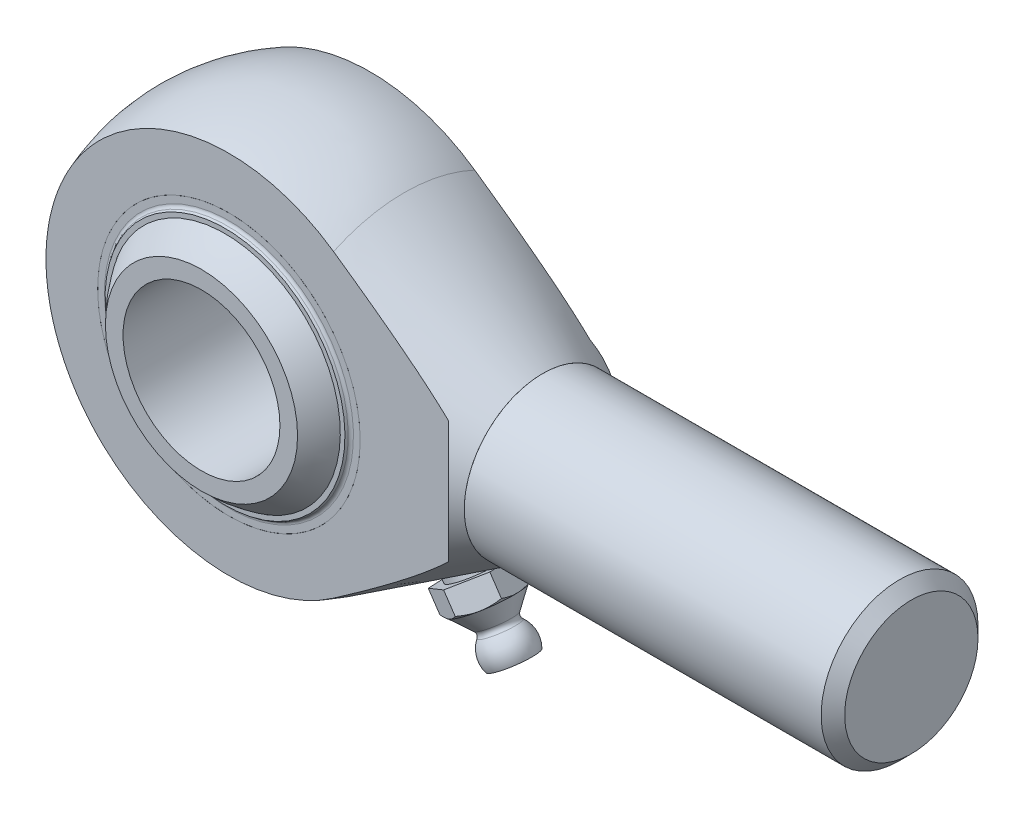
ISO-10303-21;
HEADER;
FILE_DESCRIPTION(('STEP AP214'),'2;1');
FILE_NAME('part.step','',(''),(''),'','','');
FILE_SCHEMA(('AUTOMOTIVE_DESIGN { 1 0 10303 214 1 1 1 1 }'));
ENDSEC;
DATA;
#1=APPLICATION_CONTEXT('core data for automotive mechanical design processes');
#2=APPLICATION_PROTOCOL_DEFINITION('international standard','automotive_design',2000,#1);
#3=PRODUCT_CONTEXT('',#1,'mechanical');
#4=PRODUCT('Part','Part','',(#3));
#5=PRODUCT_RELATED_PRODUCT_CATEGORY('part','',(#4));
#6=PRODUCT_DEFINITION_FORMATION('','',#4);
#7=PRODUCT_DEFINITION_CONTEXT('part definition',#1,'design');
#8=PRODUCT_DEFINITION('design','',#6,#7);
#9=PRODUCT_DEFINITION_SHAPE('','',#8);
#10=(LENGTH_UNIT() NAMED_UNIT(*) SI_UNIT(.MILLI.,.METRE.));
#11=(NAMED_UNIT(*) PLANE_ANGLE_UNIT() SI_UNIT($,.RADIAN.));
#12=(NAMED_UNIT(*) SI_UNIT($,.STERADIAN.) SOLID_ANGLE_UNIT());
#13=UNCERTAINTY_MEASURE_WITH_UNIT(LENGTH_MEASURE(1.E-05),#10,'distance_accuracy_value','');
#14=(GEOMETRIC_REPRESENTATION_CONTEXT(3) GLOBAL_UNCERTAINTY_ASSIGNED_CONTEXT((#13)) GLOBAL_UNIT_ASSIGNED_CONTEXT((#10,
#11,#12)) REPRESENTATION_CONTEXT('',''));
#15=CARTESIAN_POINT('',(0.,0.,0.));
#16=DIRECTION('',(0.,0.,1.));
#17=DIRECTION('',(1.,0.,0.));
#18=AXIS2_PLACEMENT_3D('',#15,#16,#17);
#19=CARTESIAN_POINT('',(-5.67474980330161,-17.4650840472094,2.25480046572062));
#20=DIRECTION('',(0.30671362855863,0.943967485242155,-0.121869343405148));
#21=DIRECTION('',(-0.037659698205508,-0.115904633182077,-0.992546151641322));
#22=AXIS2_PLACEMENT_3D('',#19,#20,#21);
#23=SPHERICAL_SURFACE('',#22,2.);
#24=CARTESIAN_POINT('',(-5.06132254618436,-15.5771490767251,2.01106177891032));
#25=VERTEX_POINT('',#24);
#26=VERTEX_LOOP('',#25);
#27=FACE_BOUND('',#26,.T.);
#28=ADVANCED_FACE('P0_F12',(#27),#23,.T.);
#29=CLOSED_SHELL('',(#28));
#30=MANIFOLD_SOLID_BREP('P0_B1',#29);
#31=CARTESIAN_POINT('',(0.,18.3638761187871,2.25480046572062));
#32=DIRECTION('',(0.,-0.992546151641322,-0.121869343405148));
#33=DIRECTION('',(0.,0.121869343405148,-0.992546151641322));
#34=AXIS2_PLACEMENT_3D('',#31,#32,#33);
#35=SPHERICAL_SURFACE('',#34,2.);
#36=CARTESIAN_POINT('',(0.,16.3787838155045,2.01106177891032));
#37=VERTEX_POINT('',#36);
#38=VERTEX_LOOP('',#37);
#39=FACE_BOUND('',#38,.T.);
#40=ADVANCED_FACE('P1_F12',(#39),#35,.T.);
#41=CLOSED_SHELL('',(#40));
#42=MANIFOLD_SOLID_BREP('P1_B1',#41);
#43=CARTESIAN_POINT('',(5.67474980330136,-17.4650840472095,-2.25480046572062));
#44=DIRECTION('',(-0.306713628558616,0.943967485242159,0.121869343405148));
#45=DIRECTION('',(0.0376596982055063,-0.115904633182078,0.992546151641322));
#46=AXIS2_PLACEMENT_3D('',#43,#44,#45);
#47=SPHERICAL_SURFACE('',#46,2.);
#48=CARTESIAN_POINT('',(5.06132254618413,-15.5771490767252,-2.01106177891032));
#49=VERTEX_POINT('',#48);
#50=VERTEX_LOOP('',#49);
#51=FACE_BOUND('',#50,.T.);
#52=ADVANCED_FACE('P2_F12',(#51),#47,.T.);
#53=CLOSED_SHELL('',(#52));
#54=MANIFOLD_SOLID_BREP('P2_B1',#53);
#55=CARTESIAN_POINT('',(0.,0.,0.));
#56=DIRECTION('',(0.,0.,1.));
#57=DIRECTION('',(0.999027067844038,0.044101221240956,0.));
#58=AXIS2_PLACEMENT_3D('',#55,#56,#57);
#59=CYLINDRICAL_SURFACE('',#58,16.74);
#60=CARTESIAN_POINT('',(0.,0.,-9.));
#61=DIRECTION('',(0.,0.,1.));
#62=DIRECTION('',(0.999027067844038,0.044101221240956,0.));
#63=AXIS2_PLACEMENT_3D('',#60,#61,#62);
#64=CIRCLE('',#63,16.74);
#65=CARTESIAN_POINT('',(16.7237131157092,0.738254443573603,-9.));
#66=VERTEX_POINT('',#65);
#67=EDGE_CURVE('P3_E34',#66,#66,#64,.T.);
#68=ORIENTED_EDGE('',*,*,#67,.T.);
#69=EDGE_LOOP('',(#68));
#70=FACE_BOUND('',#69,.T.);
#71=CARTESIAN_POINT('',(0.,0.,-8.5));
#72=DIRECTION('',(0.,0.,1.));
#73=DIRECTION('',(0.999027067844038,0.044101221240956,0.));
#74=AXIS2_PLACEMENT_3D('',#71,#72,#73);
#75=CIRCLE('',#74,16.74);
#76=CARTESIAN_POINT('',(16.7237131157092,0.738254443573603,-8.5));
#77=VERTEX_POINT('',#76);
#78=EDGE_CURVE('P3_E43',#77,#77,#75,.T.);
#79=ORIENTED_EDGE('',*,*,#78,.F.);
#80=EDGE_LOOP('',(#79));
#81=FACE_BOUND('',#80,.T.);
#82=ADVANCED_FACE('P3_F14',(#70,#81),#59,.T.);
#83=CARTESIAN_POINT('',(-0.738254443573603,16.7237131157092,-9.));
#84=DIRECTION('',(0.,0.,-1.));
#85=DIRECTION('',(-0.999027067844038,-0.044101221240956,0.));
#86=AXIS2_PLACEMENT_3D('',#83,#84,#85);
#87=PLANE('',#86);
#88=CARTESIAN_POINT('',(0.,0.,-9.));
#89=DIRECTION('',(0.,0.,-1.));
#90=DIRECTION('',(-0.999027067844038,-0.044101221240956,0.));
#91=AXIS2_PLACEMENT_3D('',#88,#89,#90);
#92=CIRCLE('',#91,15.8765887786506);
#93=CARTESIAN_POINT('',(-15.8611419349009,-0.70017695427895,-9.));
#94=VERTEX_POINT('',#93);
#95=EDGE_CURVE('P3_E21',#94,#94,#92,.F.);
#96=ORIENTED_EDGE('',*,*,#95,.T.);
#97=EDGE_LOOP('',(#96));
#98=FACE_BOUND('',#97,.T.);
#99=ORIENTED_EDGE('',*,*,#67,.F.);
#100=EDGE_LOOP('',(#99));
#101=FACE_BOUND('',#100,.T.);
#102=ADVANCED_FACE('P3_F50',(#98,#101),#87,.T.);
#103=CARTESIAN_POINT('',(0.,0.,0.));
#104=DIRECTION('',(0.,0.,1.));
#105=DIRECTION('',(-0.044101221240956,0.999027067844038,0.));
#106=AXIS2_PLACEMENT_3D('',#103,#104,#105);
#107=SPHERICAL_SURFACE('',#106,18.0017856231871);
#108=CARTESIAN_POINT('',(0.,0.,-9.24326802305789));
#109=DIRECTION('',(0.,0.,1.));
#110=DIRECTION('',(0.999027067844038,0.044101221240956,0.));
#111=AXIS2_PLACEMENT_3D('',#108,#109,#110);
#112=CIRCLE('',#111,15.4475331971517);
#113=CARTESIAN_POINT('',(-0.681255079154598,15.4325037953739,-9.24326802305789));
#114=VERTEX_POINT('',#113);
#115=EDGE_CURVE('P3_E10',#114,#114,#112,.F.);
#116=CARTESIAN_POINT('',(0.,0.,-9.5));
#117=DIRECTION('',(0.,0.,1.));
#118=DIRECTION('',(0.999027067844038,0.044101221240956,0.));
#119=AXIS2_PLACEMENT_3D('',#116,#117,#118);
#120=CIRCLE('',#119,15.2909870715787);
#121=CARTESIAN_POINT('',(-0.67435120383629,15.2761099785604,-9.5));
#122=VERTEX_POINT('',#121);
#123=EDGE_CURVE('P3_E37',#122,#122,#120,.T.);
#124=CARTESIAN_POINT('',(-0.681255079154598,15.4325037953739,-9.24326802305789));
#125=CARTESIAN_POINT('',(-0.681184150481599,15.430897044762,-9.24595587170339));
#126=CARTESIAN_POINT('',(-0.681113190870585,15.4292895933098,-9.24864330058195));
#127=CARTESIAN_POINT('',(-0.680971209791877,15.4260732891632,-9.25401731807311));
#128=CARTESIAN_POINT('',(-0.680900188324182,15.4244644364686,-9.2567039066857));
#129=CARTESIAN_POINT('',(-0.68075808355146,15.4212453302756,-9.26207624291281));
#130=CARTESIAN_POINT('',(-0.680687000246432,15.419635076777,-9.26476199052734));
#131=CARTESIAN_POINT('',(-0.680544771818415,15.4164131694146,-9.27013264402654));
#132=CARTESIAN_POINT('',(-0.680473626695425,15.4148015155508,-9.2728175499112));
#133=CARTESIAN_POINT('',(-0.680331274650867,15.411576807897,-9.27818651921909));
#134=CARTESIAN_POINT('',(-0.680260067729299,15.4099637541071,-9.28087058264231));
#135=CARTESIAN_POINT('',(-0.680117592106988,15.4067362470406,-9.28623786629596));
#136=CARTESIAN_POINT('',(-0.680046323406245,15.405121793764,-9.28892108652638));
#137=CARTESIAN_POINT('',(-0.679903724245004,15.4018914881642,-9.29428668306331));
#138=CARTESIAN_POINT('',(-0.679832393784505,15.400275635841,-9.29696905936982));
#139=CARTESIAN_POINT('',(-0.679689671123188,15.3970425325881,-9.30233296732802));
#140=CARTESIAN_POINT('',(-0.679618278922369,15.3954252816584,-9.30501449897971));
#141=CARTESIAN_POINT('',(-0.679475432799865,15.3921893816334,-9.31037671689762));
#142=CARTESIAN_POINT('',(-0.67940397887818,15.390570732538,-9.31305740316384));
#143=CARTESIAN_POINT('',(-0.679261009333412,15.3873320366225,-9.31841792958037));
#144=CARTESIAN_POINT('',(-0.67918949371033,15.3857119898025,-9.32109776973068));
#145=CARTESIAN_POINT('',(-0.679046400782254,15.382470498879,-9.3264566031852));
#146=CARTESIAN_POINT('',(-0.678974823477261,15.3808490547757,-9.3291355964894));
#147=CARTESIAN_POINT('',(-0.678831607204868,15.3776047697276,-9.33449273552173));
#148=CARTESIAN_POINT('',(-0.678759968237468,15.3759819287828,-9.33717088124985));
#149=CARTESIAN_POINT('',(-0.67861662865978,15.3727348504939,-9.34252632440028));
#150=CARTESIAN_POINT('',(-0.678544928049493,15.3711106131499,-9.34520362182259));
#151=CARTESIAN_POINT('',(-0.678401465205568,15.3678607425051,-9.35055736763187));
#152=CARTESIAN_POINT('',(-0.678329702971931,15.3662351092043,-9.35323381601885));
#153=CARTESIAN_POINT('',(-0.678186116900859,15.3629824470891,-9.3585858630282));
#154=CARTESIAN_POINT('',(-0.678114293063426,15.3613554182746,-9.36126146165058));
#155=CARTESIAN_POINT('',(-0.677970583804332,15.3580999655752,-9.36661180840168));
#156=CARTESIAN_POINT('',(-0.677898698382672,15.3564715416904,-9.3692865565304));
#157=CARTESIAN_POINT('',(-0.677754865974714,15.3532132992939,-9.37463520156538));
#158=CARTESIAN_POINT('',(-0.677682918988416,15.3515834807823,-9.37730909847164));
#159=CARTESIAN_POINT('',(-0.677538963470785,15.3483224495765,-9.38265604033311));
#160=CARTESIAN_POINT('',(-0.677466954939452,15.3466912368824,-9.38532908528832));
#161=CARTESIAN_POINT('',(-0.677322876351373,15.3434274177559,-9.39067432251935));
#162=CARTESIAN_POINT('',(-0.677250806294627,15.3417948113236,-9.39334651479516));
#163=CARTESIAN_POINT('',(-0.677106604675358,15.3385282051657,-9.39869004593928));
#164=CARTESIAN_POINT('',(-0.677034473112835,15.3368942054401,-9.40136138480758));
#165=CARTESIAN_POINT('',(-0.676890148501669,15.3336248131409,-9.40670320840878));
#166=CARTESIAN_POINT('',(-0.676817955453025,15.3319894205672,-9.40937369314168));
#167=CARTESIAN_POINT('',(-0.676673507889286,15.3287172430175,-9.41471380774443));
#168=CARTESIAN_POINT('',(-0.676601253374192,15.3270804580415,-9.41738343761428));
#169=CARTESIAN_POINT('',(-0.67645668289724,15.3238054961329,-9.42272184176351));
#170=CARTESIAN_POINT('',(-0.676384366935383,15.3221673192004,-9.42539061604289));
#171=CARTESIAN_POINT('',(-0.67623967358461,15.3188895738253,-9.43072730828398));
#172=CARTESIAN_POINT('',(-0.676167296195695,15.3172500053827,-9.4333952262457));
#173=CARTESIAN_POINT('',(-0.676022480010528,15.3139694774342,-9.43873020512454));
#174=CARTESIAN_POINT('',(-0.675950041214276,15.3123285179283,-9.44139726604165));
#175=CARTESIAN_POINT('',(-0.675805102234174,15.3090452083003,-9.44673053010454));
#176=CARTESIAN_POINT('',(-0.675732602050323,15.3074028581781,-9.44939673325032));
#177=CARTESIAN_POINT('',(-0.675587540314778,15.3041167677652,-9.45472828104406));
#178=CARTESIAN_POINT('',(-0.675514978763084,15.3024730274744,-9.45739362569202));
#179=CARTESIAN_POINT('',(-0.675369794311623,15.299184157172,-9.46272345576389));
#180=CARTESIAN_POINT('',(-0.675297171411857,15.2975390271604,-9.46538794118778));
#181=CARTESIAN_POINT('',(-0.67515186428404,15.2942473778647,-9.47071605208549));
#182=CARTESIAN_POINT('',(-0.675079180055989,15.2926008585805,-9.4733796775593));
#183=CARTESIAN_POINT('',(-0.674933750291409,15.2893064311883,-9.47870606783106));
#184=CARTESIAN_POINT('',(-0.67486100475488,15.2876585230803,-9.481368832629));
#185=CARTESIAN_POINT('',(-0.674715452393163,15.2843613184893,-9.48669350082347));
#186=CARTESIAN_POINT('',(-0.674642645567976,15.2827120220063,-9.48935540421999));
#187=CARTESIAN_POINT('',(-0.674496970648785,15.279412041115,-9.49467834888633));
#188=CARTESIAN_POINT('',(-0.674424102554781,15.2777613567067,-9.49733939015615));
#189=CARTESIAN_POINT('',(-0.67435120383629,15.2761099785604,-9.5));
#190=B_SPLINE_CURVE_WITH_KNOTS('',3,(#124,#125,#126,#127,#128,#129,#130,#131,#132,#133,#134,
#135,#136,#137,#138,#139,#140,#141,#142,#143,#144,#145,#146,#147,#148,#149,#150,#151,#152,#153,
#154,#155,#156,#157,#158,#159,#160,#161,#162,#163,#164,#165,#166,#167,#168,#169,#170,#171,#172,
#173,#174,#175,#176,#177,#178,#179,#180,#181,#182,#183,#184,#185,#186,#187,#188,#189),
.UNSPECIFIED.,.F.,.F.,(4,2,2,2,2,2,2,2,2,2,2,2,2,2,2,2,2,2,2,2,2,2,2,2,2,2,2,2,2,2,2,2,4),(0.,
0.00939685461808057,0.0187937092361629,0.0281905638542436,0.0375874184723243,0.0469842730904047,
0.0563811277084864,0.0657779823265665,0.0751748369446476,0.0845716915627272,0.0939685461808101,
0.103365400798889,0.112762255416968,0.12215911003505,0.131555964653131,0.140952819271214,
0.150349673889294,0.159746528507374,0.169143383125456,0.178540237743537,0.187937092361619,
0.197333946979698,0.206730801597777,0.21612765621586,0.225524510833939,0.23492136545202,
0.244318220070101,0.253715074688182,0.263111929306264,0.272508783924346,0.281905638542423,
0.291302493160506,0.300699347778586),.UNSPECIFIED.);
#191=EDGE_CURVE('P3_BSEAM57',#114,#122,#190,.T.);
#192=ORIENTED_EDGE('',*,*,#115,.T.);
#193=ORIENTED_EDGE('',*,*,#123,.T.);
#194=ORIENTED_EDGE('',*,*,#191,.T.);
#195=ORIENTED_EDGE('',*,*,#191,.F.);
#196=EDGE_LOOP('',(#192,#194,#193,#195));
#197=FACE_BOUND('',#196,.T.);
#198=ADVANCED_FACE('P3_F57',(#197),#107,.T.);
#199=CARTESIAN_POINT('',(-0.648246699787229,14.684763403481,-9.5));
#200=DIRECTION('',(0.,0.,-1.));
#201=DIRECTION('',(-0.999027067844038,-0.044101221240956,0.));
#202=AXIS2_PLACEMENT_3D('',#199,#200,#201);
#203=PLANE('',#202);
#204=CARTESIAN_POINT('',(0.,0.,-9.5));
#205=DIRECTION('',(0.,0.,1.));
#206=DIRECTION('',(0.999027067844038,0.044101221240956,0.));
#207=AXIS2_PLACEMENT_3D('',#204,#205,#206);
#208=CIRCLE('',#207,14.6990645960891);
#209=CARTESIAN_POINT('',(-0.648246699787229,14.684763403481,-9.5));
#210=VERTEX_POINT('',#209);
#211=EDGE_CURVE('P3_E40',#210,#210,#208,.T.);
#212=ORIENTED_EDGE('',*,*,#211,.T.);
#213=EDGE_LOOP('',(#212));
#214=FACE_BOUND('',#213,.T.);
#215=ORIENTED_EDGE('',*,*,#123,.F.);
#216=EDGE_LOOP('',(#215));
#217=FACE_BOUND('',#216,.T.);
#218=ADVANCED_FACE('P3_F77',(#214,#217),#203,.T.);
#219=CARTESIAN_POINT('',(0.,0.,0.));
#220=DIRECTION('',(0.,0.,1.));
#221=DIRECTION('',(-0.044101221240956,0.999027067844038,0.));
#222=AXIS2_PLACEMENT_3D('',#219,#220,#221);
#223=SPHERICAL_SURFACE('',#222,17.5017856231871);
#224=CARTESIAN_POINT('',(0.,0.,-8.75002479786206));
#225=DIRECTION('',(0.,0.,1.));
#226=DIRECTION('',(0.999027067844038,0.044101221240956,0.));
#227=AXIS2_PLACEMENT_3D('',#224,#225,#226);
#228=CIRCLE('',#227,15.1574920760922);
#229=CARTESIAN_POINT('',(-0.668463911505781,15.1427448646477,-8.75002479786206));
#230=VERTEX_POINT('',#229);
#231=EDGE_CURVE('P3_E29',#230,#230,#228,.T.);
#232=CARTESIAN_POINT('',(-0.668463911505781,15.1427448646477,-8.75002479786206));
#233=CARTESIAN_POINT('',(-0.668262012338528,15.1381712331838,-8.75795532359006));
#234=CARTESIAN_POINT('',(-0.668059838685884,15.1335913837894,-8.76588225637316));
#235=CARTESIAN_POINT('',(-0.667654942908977,15.1244192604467,-8.78172891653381));
#236=CARTESIAN_POINT('',(-0.667452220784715,15.1198269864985,-8.78964864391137));
#237=CARTESIAN_POINT('',(-0.667046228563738,15.110630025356,-8.80548087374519));
#238=CARTESIAN_POINT('',(-0.666842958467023,15.1060253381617,-8.81339337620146));
#239=CARTESIAN_POINT('',(-0.666435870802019,15.0968035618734,-8.82921113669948));
#240=CARTESIAN_POINT('',(-0.66623205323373,15.0921864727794,-8.83711639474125));
#241=CARTESIAN_POINT('',(-0.665823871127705,15.0829399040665,-8.85291964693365));
#242=CARTESIAN_POINT('',(-0.66561950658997,15.0783104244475,-8.86081764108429));
#243=CARTESIAN_POINT('',(-0.665210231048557,15.0690390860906,-8.87660634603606));
#244=CARTESIAN_POINT('',(-0.66500532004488,15.0643972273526,-8.88449705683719));
#245=CARTESIAN_POINT('',(-0.664594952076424,15.0551011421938,-8.90027117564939));
#246=CARTESIAN_POINT('',(-0.664389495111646,15.050446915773,-8.90815458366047));
#247=CARTESIAN_POINT('',(-0.663978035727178,15.0411261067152,-8.92391407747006));
#248=CARTESIAN_POINT('',(-0.663772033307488,15.0364595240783,-8.93179016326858));
#249=CARTESIAN_POINT('',(-0.663359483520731,15.0271140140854,-8.94753499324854));
#250=CARTESIAN_POINT('',(-0.663152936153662,15.0224350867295,-8.95540373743));
#251=CARTESIAN_POINT('',(-0.662739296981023,15.0130648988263,-8.97113386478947));
#252=CARTESIAN_POINT('',(-0.662532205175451,15.008373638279,-8.97899524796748));
#253=CARTESIAN_POINT('',(-0.662117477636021,14.9989787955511,-8.99471063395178));
#254=CARTESIAN_POINT('',(-0.661909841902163,14.9942752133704,-9.00256463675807));
#255=CARTESIAN_POINT('',(-0.661494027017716,14.9848557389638,-9.01826524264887));
#256=CARTESIAN_POINT('',(-0.661285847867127,14.980139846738,-9.02611184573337));
#257=CARTESIAN_POINT('',(-0.660868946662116,14.97069576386,-9.04179763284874));
#258=CARTESIAN_POINT('',(-0.660660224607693,14.9659675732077,-9.0496368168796));
#259=CARTESIAN_POINT('',(-0.660242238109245,14.9564989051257,-9.06530774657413));
#260=CARTESIAN_POINT('',(-0.66003297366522,14.9517584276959,-9.07313949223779));
#261=CARTESIAN_POINT('',(-0.659613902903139,14.9422651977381,-9.08879552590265));
#262=CARTESIAN_POINT('',(-0.659404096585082,14.93751244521,-9.09661981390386));
#263=CARTESIAN_POINT('',(-0.658983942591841,14.9279946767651,-9.11226091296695));
#264=CARTESIAN_POINT('',(-0.658773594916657,14.9232296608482,-9.12007772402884));
#265=CARTESIAN_POINT('',(-0.658352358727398,14.9136873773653,-9.13570384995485));
#266=CARTESIAN_POINT('',(-0.658141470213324,14.9089101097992,-9.14351316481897));
#267=CARTESIAN_POINT('',(-0.657719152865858,14.8993433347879,-9.15912427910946));
#268=CARTESIAN_POINT('',(-0.657507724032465,14.8945538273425,-9.16692607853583));
#269=CARTESIAN_POINT('',(-0.657084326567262,14.8849625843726,-9.18252214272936));
#270=CARTESIAN_POINT('',(-0.656872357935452,14.8801608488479,-9.19031640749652));
#271=CARTESIAN_POINT('',(-0.656447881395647,14.8705451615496,-9.20589738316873));
#272=CARTESIAN_POINT('',(-0.656235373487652,14.8657312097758,-9.21368409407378));
#273=CARTESIAN_POINT('',(-0.655809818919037,14.8560911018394,-9.22924994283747));
#274=CARTESIAN_POINT('',(-0.655596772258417,14.8512649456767,-9.23702908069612));
#275=CARTESIAN_POINT('',(-0.655170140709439,14.8416004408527,-9.25257976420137));
#276=CARTESIAN_POINT('',(-0.654956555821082,14.8367620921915,-9.26035130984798));
#277=CARTESIAN_POINT('',(-0.654528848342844,14.8270732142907,-9.27588678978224));
#278=CARTESIAN_POINT('',(-0.654314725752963,14.8222226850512,-9.2836507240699));
#279=CARTESIAN_POINT('',(-0.653885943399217,14.8125094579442,-9.29917096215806));
#280=CARTESIAN_POINT('',(-0.653671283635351,14.8076467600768,-9.30692726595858));
#281=CARTESIAN_POINT('',(-0.653241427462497,14.7979092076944,-9.3224322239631));
#282=CARTESIAN_POINT('',(-0.653026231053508,14.7930343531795,-9.3301808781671));
#283=CARTESIAN_POINT('',(-0.652595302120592,14.7832724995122,-9.34567051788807));
#284=CARTESIAN_POINT('',(-0.652379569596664,14.77838550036,-9.35341150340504));
#285=CARTESIAN_POINT('',(-0.651947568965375,14.7685993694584,-9.36888578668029));
#286=CARTESIAN_POINT('',(-0.651731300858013,14.7637002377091,-9.37661908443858));
#287=CARTESIAN_POINT('',(-0.651298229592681,14.7538898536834,-9.3920779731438));
#288=CARTESIAN_POINT('',(-0.651081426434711,14.7489786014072,-9.39980356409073));
#289=CARTESIAN_POINT('',(-0.6506472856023,14.7391439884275,-9.41524702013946));
#290=CARTESIAN_POINT('',(-0.650429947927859,14.7342206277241,-9.42296488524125));
#291=CARTESIAN_POINT('',(-0.649994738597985,14.7243618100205,-9.43839287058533));
#292=CARTESIAN_POINT('',(-0.649776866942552,14.7194263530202,-9.4461029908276));
#293=CARTESIAN_POINT('',(-0.649340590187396,14.7095433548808,-9.46151546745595));
#294=CARTESIAN_POINT('',(-0.649122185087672,14.7045958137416,-9.46921782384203));
#295=CARTESIAN_POINT('',(-0.648684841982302,14.6946886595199,-9.48461475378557));
#296=CARTESIAN_POINT('',(-0.648465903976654,14.6897290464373,-9.49230932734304));
#297=CARTESIAN_POINT('',(-0.648246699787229,14.684763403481,-9.5));
#298=B_SPLINE_CURVE_WITH_KNOTS('',3,(#232,#233,#234,#235,#236,#237,#238,#239,#240,#241,#242,
#243,#244,#245,#246,#247,#248,#249,#250,#251,#252,#253,#254,#255,#256,#257,#258,#259,#260,#261,
#262,#263,#264,#265,#266,#267,#268,#269,#270,#271,#272,#273,#274,#275,#276,#277,#278,#279,#280,
#281,#282,#283,#284,#285,#286,#287,#288,#289,#290,#291,#292,#293,#294,#295,#296,#297),
.UNSPECIFIED.,.F.,.F.,(4,2,2,2,2,2,2,2,2,2,2,2,2,2,2,2,2,2,2,2,2,2,2,2,2,2,2,2,2,2,2,2,4),(0.,
0.0274712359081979,0.054942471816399,0.0824137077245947,0.109884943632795,0.137356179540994,
0.16482741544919,0.19229865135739,0.219769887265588,0.247241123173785,0.274712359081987,
0.302183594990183,0.32965483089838,0.357126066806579,0.384597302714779,0.412068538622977,
0.439539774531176,0.467011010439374,0.494482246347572,0.521953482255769,0.549424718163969,
0.576895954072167,0.604367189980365,0.631838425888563,0.659309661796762,0.686780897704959,
0.714252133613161,0.741723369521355,0.769194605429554,0.796665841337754,0.824137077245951,
0.851608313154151,0.879079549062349),.UNSPECIFIED.);
#299=EDGE_CURVE('P3_BSEAM68',#230,#210,#298,.T.);
#300=ORIENTED_EDGE('',*,*,#231,.T.);
#301=ORIENTED_EDGE('',*,*,#211,.F.);
#302=ORIENTED_EDGE('',*,*,#299,.T.);
#303=ORIENTED_EDGE('',*,*,#299,.F.);
#304=EDGE_LOOP('',(#300,#302,#301,#303));
#305=FACE_BOUND('',#304,.T.);
#306=ADVANCED_FACE('P3_F68',(#305),#223,.F.);
#307=CARTESIAN_POINT('',(-0.738254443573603,16.7237131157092,-8.5));
#308=DIRECTION('',(0.,0.,1.));
#309=DIRECTION('',(0.999027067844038,0.044101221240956,0.));
#310=AXIS2_PLACEMENT_3D('',#307,#308,#309);
#311=PLANE('',#310);
#312=CARTESIAN_POINT('',(0.,0.,-8.5));
#313=DIRECTION('',(0.,0.,1.));
#314=DIRECTION('',(0.999027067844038,0.044101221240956,0.));
#315=AXIS2_PLACEMENT_3D('',#312,#313,#314);
#316=CIRCLE('',#315,15.5905190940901);
#317=CARTESIAN_POINT('',(15.5753505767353,0.687560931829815,-8.5));
#318=VERTEX_POINT('',#317);
#319=EDGE_CURVE('P3_E25',#318,#318,#316,.F.);
#320=ORIENTED_EDGE('',*,*,#319,.T.);
#321=EDGE_LOOP('',(#320));
#322=FACE_BOUND('',#321,.T.);
#323=ORIENTED_EDGE('',*,*,#78,.T.);
#324=EDGE_LOOP('',(#323));
#325=FACE_BOUND('',#324,.T.);
#326=ADVANCED_FACE('P3_F47',(#322,#325),#311,.T.);
#327=CARTESIAN_POINT('',(0.,0.,-9.));
#328=DIRECTION('',(0.,0.,1.));
#329=DIRECTION('',(0.999027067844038,0.044101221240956,0.));
#330=AXIS2_PLACEMENT_3D('',#327,#328,#329);
#331=TOROIDAL_SURFACE('',#330,15.5905190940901,0.5);
#332=ORIENTED_EDGE('',*,*,#319,.F.);
#333=EDGE_LOOP('',(#332));
#334=FACE_BOUND('',#333,.T.);
#335=ORIENTED_EDGE('',*,*,#231,.F.);
#336=EDGE_LOOP('',(#335));
#337=FACE_BOUND('',#336,.T.);
#338=ADVANCED_FACE('P3_F60',(#334,#337),#331,.T.);
#339=CARTESIAN_POINT('',(0.,0.,-9.5));
#340=DIRECTION('',(0.,0.,-1.));
#341=DIRECTION('',(-0.999027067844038,-0.044101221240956,0.));
#342=AXIS2_PLACEMENT_3D('',#339,#340,#341);
#343=TOROIDAL_SURFACE('',#342,15.8765887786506,0.5);
#344=ORIENTED_EDGE('',*,*,#115,.F.);
#345=EDGE_LOOP('',(#344));
#346=FACE_BOUND('',#345,.T.);
#347=ORIENTED_EDGE('',*,*,#95,.F.);
#348=EDGE_LOOP('',(#347));
#349=FACE_BOUND('',#348,.T.);
#350=ADVANCED_FACE('P3_F16',(#346,#349),#343,.F.);
#351=CLOSED_SHELL('',(#82,#102,#198,#218,#306,#326,#338,#350));
#352=MANIFOLD_SOLID_BREP('P3_B1',#351);
#353=CARTESIAN_POINT('',(-10.7940155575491,-14.856687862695,2.25480046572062));
#354=DIRECTION('',(0.583403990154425,0.802986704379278,-0.121869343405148));
#355=DIRECTION('',(-0.0716330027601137,-0.0985943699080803,-0.992546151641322));
#356=AXIS2_PLACEMENT_3D('',#353,#354,#355);
#357=SPHERICAL_SURFACE('',#356,2.);
#358=CARTESIAN_POINT('',(-9.6272075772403,-13.2507144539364,2.01106177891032));
#359=VERTEX_POINT('',#358);
#360=VERTEX_LOOP('',#359);
#361=FACE_BOUND('',#360,.T.);
#362=ADVANCED_FACE('P4_F12',(#361),#357,.T.);
#363=CLOSED_SHELL('',(#362));
#364=MANIFOLD_SOLID_BREP('P4_B1',#363);
#365=CARTESIAN_POINT('',(5.67474980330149,17.4650840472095,2.25480046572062));
#366=DIRECTION('',(-0.306713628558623,-0.943967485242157,-0.121869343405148));
#367=DIRECTION('',(0.0376596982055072,0.115904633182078,-0.992546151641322));
#368=AXIS2_PLACEMENT_3D('',#365,#366,#367);
#369=SPHERICAL_SURFACE('',#368,2.);
#370=CARTESIAN_POINT('',(5.06132254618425,15.5771490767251,2.01106177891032));
#371=VERTEX_POINT('',#370);
#372=VERTEX_LOOP('',#371);
#373=FACE_BOUND('',#372,.T.);
#374=ADVANCED_FACE('P5_F12',(#373),#369,.T.);
#375=CLOSED_SHELL('',(#374));
#376=MANIFOLD_SOLID_BREP('P5_B1',#375);
#377=CARTESIAN_POINT('',(-1.28234335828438E-13,-18.3638761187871,-2.25480046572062));
#378=DIRECTION('',(0.,0.992546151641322,0.121869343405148));
#379=DIRECTION('',(0.,-0.121869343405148,0.992546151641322));
#380=AXIS2_PLACEMENT_3D('',#377,#378,#379);
#381=SPHERICAL_SURFACE('',#380,2.);
#382=CARTESIAN_POINT('',(-1.14372502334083E-13,-16.3787838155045,-2.01106177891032));
#383=VERTEX_POINT('',#382);
#384=VERTEX_LOOP('',#383);
#385=FACE_BOUND('',#384,.T.);
#386=ADVANCED_FACE('P6_F12',(#385),#381,.T.);
#387=CLOSED_SHELL('',(#386));
#388=MANIFOLD_SOLID_BREP('P6_B1',#387);
#389=CARTESIAN_POINT('',(-14.8566878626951,-10.7940155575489,2.25480046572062));
#390=DIRECTION('',(0.802986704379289,0.58340399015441,-0.121869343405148));
#391=DIRECTION('',(-0.0985943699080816,-0.0716330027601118,-0.992546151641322));
#392=AXIS2_PLACEMENT_3D('',#389,#390,#391);
#393=SPHERICAL_SURFACE('',#392,2.);
#394=CARTESIAN_POINT('',(-13.2507144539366,-9.62720757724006,2.01106177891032));
#395=VERTEX_POINT('',#394);
#396=VERTEX_LOOP('',#395);
#397=FACE_BOUND('',#396,.T.);
#398=ADVANCED_FACE('P7_F12',(#397),#393,.T.);
#399=CLOSED_SHELL('',(#398));
#400=MANIFOLD_SOLID_BREP('P7_B1',#399);
#401=CARTESIAN_POINT('',(10.794015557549,14.856687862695,2.25480046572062));
#402=DIRECTION('',(-0.583403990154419,-0.802986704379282,-0.121869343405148));
#403=DIRECTION('',(0.0716330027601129,0.0985943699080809,-0.992546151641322));
#404=AXIS2_PLACEMENT_3D('',#401,#402,#403);
#405=SPHERICAL_SURFACE('',#404,2.);
#406=CARTESIAN_POINT('',(9.62720757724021,13.2507144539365,2.01106177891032));
#407=VERTEX_POINT('',#406);
#408=VERTEX_LOOP('',#407);
#409=FACE_BOUND('',#408,.T.);
#410=ADVANCED_FACE('P8_F12',(#409),#405,.T.);
#411=CLOSED_SHELL('',(#410));
#412=MANIFOLD_SOLID_BREP('P8_B1',#411);
#413=CARTESIAN_POINT('',(-5.67474980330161,-17.4650840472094,-2.25480046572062));
#414=DIRECTION('',(0.30671362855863,0.943967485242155,0.121869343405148));
#415=DIRECTION('',(-0.037659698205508,-0.115904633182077,0.992546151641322));
#416=AXIS2_PLACEMENT_3D('',#413,#414,#415);
#417=SPHERICAL_SURFACE('',#416,2.);
#418=CARTESIAN_POINT('',(-5.06132254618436,-15.5771490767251,-2.01106177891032));
#419=VERTEX_POINT('',#418);
#420=VERTEX_LOOP('',#419);
#421=FACE_BOUND('',#420,.T.);
#422=ADVANCED_FACE('P9_F12',(#421),#417,.T.);
#423=CLOSED_SHELL('',(#422));
#424=MANIFOLD_SOLID_BREP('P9_B1',#423);
#425=CARTESIAN_POINT('',(0.,0.,0.));
#426=DIRECTION('',(0.,1.,0.));
#427=DIRECTION('',(1.,0.,0.));
#428=AXIS2_PLACEMENT_3D('',#425,#426,#427);
#429=SPHERICAL_SURFACE('',#428,17.5017856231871);
#430=CARTESIAN_POINT('',(0.,0.,0.));
#431=DIRECTION('',(0.,0.,1.));
#432=DIRECTION('',(1.,0.,0.));
#433=AXIS2_PLACEMENT_3D('',#430,#431,#432);
#434=SPHERICAL_SURFACE('',#433,17.5017856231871);
#435=CARTESIAN_POINT('',(0.,0.,3.79314959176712));
#436=DIRECTION('',(0.,0.,1.));
#437=DIRECTION('',(1.,0.,0.));
#438=AXIS2_PLACEMENT_3D('',#435,#436,#437);
#439=CIRCLE('',#438,17.0857986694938);
#440=CARTESIAN_POINT('',(17.0857986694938,0.,3.79314959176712));
#441=VERTEX_POINT('',#440);
#442=EDGE_CURVE('P10_E18',#441,#441,#439,.F.);
#443=ORIENTED_EDGE('',*,*,#442,.F.);
#444=EDGE_LOOP('',(#443));
#445=FACE_BOUND('',#444,.T.);
#446=CARTESIAN_POINT('',(0.,0.,12.5));
#447=DIRECTION('',(0.,0.,-1.));
#448=DIRECTION('',(-1.,0.,0.));
#449=AXIS2_PLACEMENT_3D('',#446,#447,#448);
#450=CIRCLE('',#449,12.25);
#451=CARTESIAN_POINT('',(-12.25,0.,12.5));
#452=VERTEX_POINT('',#451);
#453=EDGE_CURVE('P10_E27',#452,#452,#450,.F.);
#454=ORIENTED_EDGE('',*,*,#453,.F.);
#455=EDGE_LOOP('',(#454));
#456=FACE_BOUND('',#455,.T.);
#457=ADVANCED_FACE('P10_F14',(#445,#456),#434,.T.);
#458=CARTESIAN_POINT('',(0.,0.,0.));
#459=DIRECTION('',(0.,0.,-1.));
#460=DIRECTION('',(-1.,0.,0.));
#461=AXIS2_PLACEMENT_3D('',#458,#459,#460);
#462=SPHERICAL_SURFACE('',#461,17.5017856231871);
#463=CARTESIAN_POINT('',(0.,0.,-3.79314959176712));
#464=DIRECTION('',(0.,0.,-1.));
#465=DIRECTION('',(-1.,0.,0.));
#466=AXIS2_PLACEMENT_3D('',#463,#464,#465);
#467=CIRCLE('',#466,17.0857986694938);
#468=CARTESIAN_POINT('',(-17.0857986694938,0.,-3.79314959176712));
#469=VERTEX_POINT('',#468);
#470=EDGE_CURVE('P10_E34',#469,#469,#467,.F.);
#471=ORIENTED_EDGE('',*,*,#470,.F.);
#472=EDGE_LOOP('',(#471));
#473=FACE_BOUND('',#472,.T.);
#474=CARTESIAN_POINT('',(0.,0.,-12.5));
#475=DIRECTION('',(0.,0.,1.));
#476=DIRECTION('',(1.,0.,0.));
#477=AXIS2_PLACEMENT_3D('',#474,#475,#476);
#478=CIRCLE('',#477,12.25);
#479=CARTESIAN_POINT('',(12.25,0.,-12.5));
#480=VERTEX_POINT('',#479);
#481=EDGE_CURVE('P10_E10',#480,#480,#478,.F.);
#482=ORIENTED_EDGE('',*,*,#481,.F.);
#483=EDGE_LOOP('',(#482));
#484=FACE_BOUND('',#483,.T.);
#485=ADVANCED_FACE('P10_F50',(#473,#484),#462,.T.);
#486=CARTESIAN_POINT('',(0.,0.,0.));
#487=DIRECTION('',(0.,0.,-1.));
#488=DIRECTION('',(-1.,0.,0.));
#489=AXIS2_PLACEMENT_3D('',#486,#487,#488);
#490=SPHERICAL_SURFACE('',#489,17.5017856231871);
#491=CARTESIAN_POINT('',(0.,0.,0.452951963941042));
#492=DIRECTION('',(0.,0.,-1.));
#493=DIRECTION('',(-1.,0.,0.));
#494=AXIS2_PLACEMENT_3D('',#491,#492,#493);
#495=CIRCLE('',#494,17.4959233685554);
#496=CARTESIAN_POINT('',(-17.4959233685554,0.,0.452951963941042));
#497=VERTEX_POINT('',#496);
#498=EDGE_CURVE('P10_E39',#497,#497,#495,.F.);
#499=ORIENTED_EDGE('',*,*,#498,.F.);
#500=EDGE_LOOP('',(#499));
#501=FACE_BOUND('',#500,.T.);
#502=CARTESIAN_POINT('',(0.,0.,-0.452951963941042));
#503=DIRECTION('',(0.,0.,1.));
#504=DIRECTION('',(1.,0.,0.));
#505=AXIS2_PLACEMENT_3D('',#502,#503,#504);
#506=CIRCLE('',#505,17.4959233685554);
#507=CARTESIAN_POINT('',(17.4959233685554,0.,-0.452951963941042));
#508=VERTEX_POINT('',#507);
#509=EDGE_CURVE('P10_E35',#508,#508,#506,.F.);
#510=ORIENTED_EDGE('',*,*,#509,.F.);
#511=EDGE_LOOP('',(#510));
#512=FACE_BOUND('',#511,.T.);
#513=ADVANCED_FACE('P10_F16',(#501,#512),#490,.T.);
#514=CARTESIAN_POINT('',(0.,0.,-17.5017856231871));
#515=DIRECTION('',(0.,0.,1.));
#516=DIRECTION('',(1.,0.,0.));
#517=AXIS2_PLACEMENT_3D('',#514,#515,#516);
#518=CYLINDRICAL_SURFACE('',#517,10.);
#519=CARTESIAN_POINT('',(0.,0.,12.5));
#520=DIRECTION('',(0.,0.,-1.));
#521=DIRECTION('',(-1.,0.,0.));
#522=AXIS2_PLACEMENT_3D('',#519,#520,#521);
#523=CIRCLE('',#522,10.);
#524=CARTESIAN_POINT('',(10.,0.,12.5));
#525=VERTEX_POINT('',#524);
#526=EDGE_CURVE('P10_E31',#525,#525,#523,.F.);
#527=CARTESIAN_POINT('',(0.,0.,-12.5));
#528=DIRECTION('',(0.,0.,1.));
#529=DIRECTION('',(1.,0.,0.));
#530=AXIS2_PLACEMENT_3D('',#527,#528,#529);
#531=CIRCLE('',#530,10.);
#532=CARTESIAN_POINT('',(10.,0.,-12.5));
#533=VERTEX_POINT('',#532);
#534=EDGE_CURVE('P10_E22',#533,#533,#531,.F.);
#535=CARTESIAN_POINT('',(10.,0.,12.5));
#536=CARTESIAN_POINT('',(10.,0.,12.2395833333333));
#537=CARTESIAN_POINT('',(10.,0.,11.9791666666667));
#538=CARTESIAN_POINT('',(10.,0.,11.4583333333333));
#539=CARTESIAN_POINT('',(10.,0.,11.1979166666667));
#540=CARTESIAN_POINT('',(10.,0.,10.6770833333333));
#541=CARTESIAN_POINT('',(10.,0.,10.4166666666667));
#542=CARTESIAN_POINT('',(10.,0.,9.89583333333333));
#543=CARTESIAN_POINT('',(10.,0.,9.63541666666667));
#544=CARTESIAN_POINT('',(10.,0.,9.11458333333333));
#545=CARTESIAN_POINT('',(10.,0.,8.85416666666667));
#546=CARTESIAN_POINT('',(10.,0.,8.33333333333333));
#547=CARTESIAN_POINT('',(10.,0.,8.07291666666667));
#548=CARTESIAN_POINT('',(10.,0.,7.55208333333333));
#549=CARTESIAN_POINT('',(10.,0.,7.29166666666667));
#550=CARTESIAN_POINT('',(10.,0.,6.77083333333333));
#551=CARTESIAN_POINT('',(10.,0.,6.51041666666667));
#552=CARTESIAN_POINT('',(10.,0.,5.98958333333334));
#553=CARTESIAN_POINT('',(10.,0.,5.72916666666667));
#554=CARTESIAN_POINT('',(10.,0.,5.20833333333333));
#555=CARTESIAN_POINT('',(10.,0.,4.94791666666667));
#556=CARTESIAN_POINT('',(10.,0.,4.42708333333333));
#557=CARTESIAN_POINT('',(10.,0.,4.16666666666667));
#558=CARTESIAN_POINT('',(10.,0.,3.64583333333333));
#559=CARTESIAN_POINT('',(10.,0.,3.38541666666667));
#560=CARTESIAN_POINT('',(10.,0.,2.86458333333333));
#561=CARTESIAN_POINT('',(10.,0.,2.60416666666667));
#562=CARTESIAN_POINT('',(10.,0.,2.08333333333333));
#563=CARTESIAN_POINT('',(10.,0.,1.82291666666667));
#564=CARTESIAN_POINT('',(10.,0.,1.30208333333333));
#565=CARTESIAN_POINT('',(10.,0.,1.04166666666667));
#566=CARTESIAN_POINT('',(10.,0.,0.520833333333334));
#567=CARTESIAN_POINT('',(10.,0.,0.260416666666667));
#568=CARTESIAN_POINT('',(10.,0.,-0.260416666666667));
#569=CARTESIAN_POINT('',(10.,0.,-0.520833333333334));
#570=CARTESIAN_POINT('',(10.,0.,-1.04166666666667));
#571=CARTESIAN_POINT('',(10.,0.,-1.30208333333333));
#572=CARTESIAN_POINT('',(10.,0.,-1.82291666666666));
#573=CARTESIAN_POINT('',(10.,0.,-2.08333333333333));
#574=CARTESIAN_POINT('',(10.,0.,-2.60416666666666));
#575=CARTESIAN_POINT('',(10.,0.,-2.86458333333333));
#576=CARTESIAN_POINT('',(10.,0.,-3.38541666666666));
#577=CARTESIAN_POINT('',(10.,0.,-3.64583333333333));
#578=CARTESIAN_POINT('',(10.,0.,-4.16666666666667));
#579=CARTESIAN_POINT('',(10.,0.,-4.42708333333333));
#580=CARTESIAN_POINT('',(10.,0.,-4.94791666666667));
#581=CARTESIAN_POINT('',(10.,0.,-5.20833333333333));
#582=CARTESIAN_POINT('',(10.,0.,-5.72916666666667));
#583=CARTESIAN_POINT('',(10.,0.,-5.98958333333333));
#584=CARTESIAN_POINT('',(10.,0.,-6.51041666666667));
#585=CARTESIAN_POINT('',(10.,0.,-6.77083333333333));
#586=CARTESIAN_POINT('',(10.,0.,-7.29166666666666));
#587=CARTESIAN_POINT('',(10.,0.,-7.55208333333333));
#588=CARTESIAN_POINT('',(10.,0.,-8.07291666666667));
#589=CARTESIAN_POINT('',(10.,0.,-8.33333333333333));
#590=CARTESIAN_POINT('',(10.,0.,-8.85416666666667));
#591=CARTESIAN_POINT('',(10.,0.,-9.11458333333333));
#592=CARTESIAN_POINT('',(10.,0.,-9.63541666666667));
#593=CARTESIAN_POINT('',(10.,0.,-9.89583333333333));
#594=CARTESIAN_POINT('',(10.,0.,-10.4166666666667));
#595=CARTESIAN_POINT('',(10.,0.,-10.6770833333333));
#596=CARTESIAN_POINT('',(10.,0.,-11.1979166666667));
#597=CARTESIAN_POINT('',(10.,0.,-11.4583333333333));
#598=CARTESIAN_POINT('',(10.,0.,-11.9791666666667));
#599=CARTESIAN_POINT('',(10.,0.,-12.2395833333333));
#600=CARTESIAN_POINT('',(10.,0.,-12.5));
#601=B_SPLINE_CURVE_WITH_KNOTS('',3,(#535,#536,#537,#538,#539,#540,#541,#542,#543,#544,#545,
#546,#547,#548,#549,#550,#551,#552,#553,#554,#555,#556,#557,#558,#559,#560,#561,#562,#563,#564,
#565,#566,#567,#568,#569,#570,#571,#572,#573,#574,#575,#576,#577,#578,#579,#580,#581,#582,#583,
#584,#585,#586,#587,#588,#589,#590,#591,#592,#593,#594,#595,#596,#597,#598,#599,#600),
.UNSPECIFIED.,.F.,.F.,(4,2,2,2,2,2,2,2,2,2,2,2,2,2,2,2,2,2,2,2,2,2,2,2,2,2,2,2,2,2,2,2,4),(0.,
0.781250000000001,1.5625,2.34375,3.125,3.90625,4.6875,5.46875,6.25,7.03125,7.8125,8.59375,9.375,
10.15625,10.9375,11.71875,12.5,13.28125,14.0625,14.84375,15.625,16.40625,17.1875,17.96875,18.75,
19.53125,20.3125,21.09375,21.875,22.65625,23.4375,24.21875,25.),.UNSPECIFIED.);
#602=EDGE_CURVE('P10_BSEAM62',#525,#533,#601,.T.);
#603=ORIENTED_EDGE('',*,*,#526,.T.);
#604=ORIENTED_EDGE('',*,*,#534,.T.);
#605=ORIENTED_EDGE('',*,*,#602,.T.);
#606=ORIENTED_EDGE('',*,*,#602,.F.);
#607=EDGE_LOOP('',(#603,#605,#604,#606));
#608=FACE_BOUND('',#607,.T.);
#609=ADVANCED_FACE('P10_F62',(#608),#518,.F.);
#610=CARTESIAN_POINT('',(-17.5017856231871,-17.5017856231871,-12.5));
#611=DIRECTION('',(0.,0.,1.));
#612=DIRECTION('',(1.,0.,0.));
#613=AXIS2_PLACEMENT_3D('',#610,#611,#612);
#614=PLANE('',#613);
#615=ORIENTED_EDGE('',*,*,#481,.T.);
#616=EDGE_LOOP('',(#615));
#617=FACE_BOUND('',#616,.T.);
#618=ORIENTED_EDGE('',*,*,#534,.F.);
#619=EDGE_LOOP('',(#618));
#620=FACE_BOUND('',#619,.T.);
#621=ADVANCED_FACE('P10_F58',(#617,#620),#614,.F.);
#622=CARTESIAN_POINT('',(-17.5017856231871,-17.5017856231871,12.5));
#623=DIRECTION('',(0.,0.,-1.));
#624=DIRECTION('',(-1.,0.,0.));
#625=AXIS2_PLACEMENT_3D('',#622,#623,#624);
#626=PLANE('',#625);
#627=ORIENTED_EDGE('',*,*,#453,.T.);
#628=EDGE_LOOP('',(#627));
#629=FACE_BOUND('',#628,.T.);
#630=ORIENTED_EDGE('',*,*,#526,.F.);
#631=EDGE_LOOP('',(#630));
#632=FACE_BOUND('',#631,.T.);
#633=ADVANCED_FACE('P10_F54',(#629,#632),#626,.F.);
#634=CARTESIAN_POINT('',(0.,0.,-2.25480046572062));
#635=DIRECTION('',(0.,0.,-1.));
#636=DIRECTION('',(-1.,0.,0.));
#637=AXIS2_PLACEMENT_3D('',#634,#635,#636);
#638=TOROIDAL_SURFACE('',#637,18.3638761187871,2.);
#639=ORIENTED_EDGE('',*,*,#470,.T.);
#640=EDGE_LOOP('',(#639));
#641=FACE_BOUND('',#640,.T.);
#642=ORIENTED_EDGE('',*,*,#509,.T.);
#643=EDGE_LOOP('',(#642));
#644=FACE_BOUND('',#643,.T.);
#645=ADVANCED_FACE('P10_F57',(#641,#644),#638,.F.);
#646=CARTESIAN_POINT('',(0.,0.,2.25480046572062));
#647=DIRECTION('',(0.,0.,-1.));
#648=DIRECTION('',(-1.,0.,0.));
#649=AXIS2_PLACEMENT_3D('',#646,#647,#648);
#650=TOROIDAL_SURFACE('',#649,18.3638761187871,2.);
#651=ORIENTED_EDGE('',*,*,#442,.T.);
#652=EDGE_LOOP('',(#651));
#653=FACE_BOUND('',#652,.T.);
#654=ORIENTED_EDGE('',*,*,#498,.T.);
#655=EDGE_LOOP('',(#654));
#656=FACE_BOUND('',#655,.T.);
#657=ADVANCED_FACE('P10_F46',(#653,#656),#650,.F.);
#658=CLOSED_SHELL('',(#457,#485,#513,#609,#621,#633,#645,#657));
#659=MANIFOLD_SOLID_BREP('P10_B1',#658);
#660=CARTESIAN_POINT('',(-17.4650840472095,-5.67474980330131,2.25480046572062));
#661=DIRECTION('',(0.94396748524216,0.306713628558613,-0.121869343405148));
#662=DIRECTION('',(-0.115904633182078,-0.037659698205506,-0.992546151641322));
#663=AXIS2_PLACEMENT_3D('',#660,#661,#662);
#664=SPHERICAL_SURFACE('',#663,2.);
#665=CARTESIAN_POINT('',(-15.5771490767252,-5.06132254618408,2.01106177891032));
#666=VERTEX_POINT('',#665);
#667=VERTEX_LOOP('',#666);
#668=FACE_BOUND('',#667,.T.);
#669=ADVANCED_FACE('P11_F12',(#668),#664,.T.);
#670=CLOSED_SHELL('',(#669));
#671=MANIFOLD_SOLID_BREP('P11_B1',#670);
#672=CARTESIAN_POINT('',(14.8566878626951,10.794015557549,2.25480046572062));
#673=DIRECTION('',(-0.802986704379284,-0.583403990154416,-0.121869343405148));
#674=DIRECTION('',(0.0985943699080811,0.0716330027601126,-0.992546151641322));
#675=AXIS2_PLACEMENT_3D('',#672,#673,#674);
#676=SPHERICAL_SURFACE('',#675,2.);
#677=CARTESIAN_POINT('',(13.2507144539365,9.62720757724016,2.01106177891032));
#678=VERTEX_POINT('',#677);
#679=VERTEX_LOOP('',#678);
#680=FACE_BOUND('',#679,.T.);
#681=ADVANCED_FACE('P12_F12',(#680),#676,.T.);
#682=CLOSED_SHELL('',(#681));
#683=MANIFOLD_SOLID_BREP('P12_B1',#682);
#684=CARTESIAN_POINT('',(-10.7940155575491,-14.856687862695,-2.25480046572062));
#685=DIRECTION('',(0.583403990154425,0.802986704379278,0.121869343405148));
#686=DIRECTION('',(-0.0716330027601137,-0.0985943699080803,0.992546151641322));
#687=AXIS2_PLACEMENT_3D('',#684,#685,#686);
#688=SPHERICAL_SURFACE('',#687,2.);
#689=CARTESIAN_POINT('',(-9.6272075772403,-13.2507144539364,-2.01106177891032));
#690=VERTEX_POINT('',#689);
#691=VERTEX_LOOP('',#690);
#692=FACE_BOUND('',#691,.T.);
#693=ADVANCED_FACE('P13_F12',(#692),#688,.T.);
#694=CLOSED_SHELL('',(#693));
#695=MANIFOLD_SOLID_BREP('P13_B1',#694);
#696=CARTESIAN_POINT('',(0.,18.3638761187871,-2.25480046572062));
#697=DIRECTION('',(0.,-0.992546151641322,0.121869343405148));
#698=DIRECTION('',(0.,0.121869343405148,0.992546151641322));
#699=AXIS2_PLACEMENT_3D('',#696,#697,#698);
#700=SPHERICAL_SURFACE('',#699,2.);
#701=CARTESIAN_POINT('',(0.,16.3787838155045,-2.01106177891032));
#702=VERTEX_POINT('',#701);
#703=VERTEX_LOOP('',#702);
#704=FACE_BOUND('',#703,.T.);
#705=ADVANCED_FACE('P14_F12',(#704),#700,.T.);
#706=CLOSED_SHELL('',(#705));
#707=MANIFOLD_SOLID_BREP('P14_B1',#706);
#708=CARTESIAN_POINT('',(-18.3638761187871,1.92351503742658E-13,2.25480046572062));
#709=DIRECTION('',(0.992546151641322,0.,-0.121869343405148));
#710=DIRECTION('',(-0.121869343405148,0.,-0.992546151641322));
#711=AXIS2_PLACEMENT_3D('',#708,#709,#710);
#712=SPHERICAL_SURFACE('',#711,2.);
#713=CARTESIAN_POINT('',(-16.3787838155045,1.71558753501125E-13,2.01106177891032));
#714=VERTEX_POINT('',#713);
#715=VERTEX_LOOP('',#714);
#716=FACE_BOUND('',#715,.T.);
#717=ADVANCED_FACE('P15_F12',(#716),#712,.T.);
#718=CLOSED_SHELL('',(#717));
#719=MANIFOLD_SOLID_BREP('P15_B1',#718);
#720=CARTESIAN_POINT('',(17.4650840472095,5.67474980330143,2.25480046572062));
#721=DIRECTION('',(-0.943967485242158,-0.306713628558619,-0.121869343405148));
#722=DIRECTION('',(0.115904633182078,0.0376596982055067,-0.992546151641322));
#723=AXIS2_PLACEMENT_3D('',#720,#721,#722);
#724=SPHERICAL_SURFACE('',#723,2.);
#725=CARTESIAN_POINT('',(15.5771490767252,5.06132254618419,2.01106177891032));
#726=VERTEX_POINT('',#725);
#727=VERTEX_LOOP('',#726);
#728=FACE_BOUND('',#727,.T.);
#729=ADVANCED_FACE('P16_F12',(#728),#724,.T.);
#730=CLOSED_SHELL('',(#729));
#731=MANIFOLD_SOLID_BREP('P16_B1',#730);
#732=CARTESIAN_POINT('',(-14.8566878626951,-10.7940155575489,-2.25480046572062));
#733=DIRECTION('',(0.802986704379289,0.58340399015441,0.121869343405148));
#734=DIRECTION('',(-0.0985943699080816,-0.0716330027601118,0.992546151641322));
#735=AXIS2_PLACEMENT_3D('',#732,#733,#734);
#736=SPHERICAL_SURFACE('',#735,2.);
#737=CARTESIAN_POINT('',(-13.2507144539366,-9.62720757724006,-2.01106177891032));
#738=VERTEX_POINT('',#737);
#739=VERTEX_LOOP('',#738);
#740=FACE_BOUND('',#739,.T.);
#741=ADVANCED_FACE('P17_F12',(#740),#736,.T.);
#742=CLOSED_SHELL('',(#741));
#743=MANIFOLD_SOLID_BREP('P17_B1',#742);
#744=CARTESIAN_POINT('',(5.67474980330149,17.4650840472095,-2.25480046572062));
#745=DIRECTION('',(-0.306713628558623,-0.943967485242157,0.121869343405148));
#746=DIRECTION('',(0.0376596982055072,0.115904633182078,0.992546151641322));
#747=AXIS2_PLACEMENT_3D('',#744,#745,#746);
#748=SPHERICAL_SURFACE('',#747,2.);
#749=CARTESIAN_POINT('',(5.06132254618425,15.5771490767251,-2.01106177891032));
#750=VERTEX_POINT('',#749);
#751=VERTEX_LOOP('',#750);
#752=FACE_BOUND('',#751,.T.);
#753=ADVANCED_FACE('P18_F12',(#752),#748,.T.);
#754=CLOSED_SHELL('',(#753));
#755=MANIFOLD_SOLID_BREP('P18_B1',#754);
#756=CARTESIAN_POINT('',(-17.4650840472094,5.67474980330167,2.25480046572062));
#757=DIRECTION('',(0.943967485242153,-0.306713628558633,-0.121869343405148));
#758=DIRECTION('',(-0.115904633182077,0.0376596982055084,-0.992546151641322));
#759=AXIS2_PLACEMENT_3D('',#756,#757,#758);
#760=SPHERICAL_SURFACE('',#759,2.);
#761=CARTESIAN_POINT('',(-15.5771490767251,5.06132254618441,2.01106177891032));
#762=VERTEX_POINT('',#761);
#763=VERTEX_LOOP('',#762);
#764=FACE_BOUND('',#763,.T.);
#765=ADVANCED_FACE('P19_F12',(#764),#760,.T.);
#766=CLOSED_SHELL('',(#765));
#767=MANIFOLD_SOLID_BREP('P19_B1',#766);
#768=CARTESIAN_POINT('',(18.3638761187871,0.,2.25480046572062));
#769=DIRECTION('',(-0.992546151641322,0.,-0.121869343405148));
#770=DIRECTION('',(0.121869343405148,0.,-0.992546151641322));
#771=AXIS2_PLACEMENT_3D('',#768,#769,#770);
#772=SPHERICAL_SURFACE('',#771,2.);
#773=CARTESIAN_POINT('',(16.3787838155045,0.,2.01106177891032));
#774=VERTEX_POINT('',#773);
#775=VERTEX_LOOP('',#774);
#776=FACE_BOUND('',#775,.T.);
#777=ADVANCED_FACE('P20_F12',(#776),#772,.T.);
#778=CLOSED_SHELL('',(#777));
#779=MANIFOLD_SOLID_BREP('P20_B1',#778);
#780=CARTESIAN_POINT('',(-17.4650840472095,-5.67474980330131,-2.25480046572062));
#781=DIRECTION('',(0.94396748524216,0.306713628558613,0.121869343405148));
#782=DIRECTION('',(-0.115904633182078,-0.037659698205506,0.992546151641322));
#783=AXIS2_PLACEMENT_3D('',#780,#781,#782);
#784=SPHERICAL_SURFACE('',#783,2.);
#785=CARTESIAN_POINT('',(-15.5771490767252,-5.06132254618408,-2.01106177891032));
#786=VERTEX_POINT('',#785);
#787=VERTEX_LOOP('',#786);
#788=FACE_BOUND('',#787,.T.);
#789=ADVANCED_FACE('P21_F12',(#788),#784,.T.);
#790=CLOSED_SHELL('',(#789));
#791=MANIFOLD_SOLID_BREP('P21_B1',#790);
#792=CARTESIAN_POINT('',(10.794015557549,14.856687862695,-2.25480046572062));
#793=DIRECTION('',(-0.583403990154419,-0.802986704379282,0.121869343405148));
#794=DIRECTION('',(0.0716330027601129,0.0985943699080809,0.992546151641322));
#795=AXIS2_PLACEMENT_3D('',#792,#793,#794);
#796=SPHERICAL_SURFACE('',#795,2.);
#797=CARTESIAN_POINT('',(9.62720757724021,13.2507144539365,-2.01106177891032));
#798=VERTEX_POINT('',#797);
#799=VERTEX_LOOP('',#798);
#800=FACE_BOUND('',#799,.T.);
#801=ADVANCED_FACE('P22_F12',(#800),#796,.T.);
#802=CLOSED_SHELL('',(#801));
#803=MANIFOLD_SOLID_BREP('P22_B1',#802);
#804=CARTESIAN_POINT('',(-14.8566878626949,10.7940155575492,2.25480046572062));
#805=DIRECTION('',(0.802986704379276,-0.583403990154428,-0.121869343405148));
#806=DIRECTION('',(-0.0985943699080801,0.071633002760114,-0.992546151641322));
#807=AXIS2_PLACEMENT_3D('',#804,#805,#806);
#808=SPHERICAL_SURFACE('',#807,2.);
#809=CARTESIAN_POINT('',(-13.2507144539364,9.62720757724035,2.01106177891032));
#810=VERTEX_POINT('',#809);
#811=VERTEX_LOOP('',#810);
#812=FACE_BOUND('',#811,.T.);
#813=ADVANCED_FACE('P23_F12',(#812),#808,.T.);
#814=CLOSED_SHELL('',(#813));
#815=MANIFOLD_SOLID_BREP('P23_B1',#814);
#816=CARTESIAN_POINT('',(17.4650840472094,-5.67474980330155,2.25480046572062));
#817=DIRECTION('',(-0.943967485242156,0.306713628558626,-0.121869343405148));
#818=DIRECTION('',(0.115904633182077,-0.0376596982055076,-0.992546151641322));
#819=AXIS2_PLACEMENT_3D('',#816,#817,#818);
#820=SPHERICAL_SURFACE('',#819,2.);
#821=CARTESIAN_POINT('',(15.5771490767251,-5.0613225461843,2.01106177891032));
#822=VERTEX_POINT('',#821);
#823=VERTEX_LOOP('',#822);
#824=FACE_BOUND('',#823,.T.);
#825=ADVANCED_FACE('P24_F12',(#824),#820,.T.);
#826=CLOSED_SHELL('',(#825));
#827=MANIFOLD_SOLID_BREP('P24_B1',#826);
#828=CARTESIAN_POINT('',(-18.3638761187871,1.92351503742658E-13,-2.25480046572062));
#829=DIRECTION('',(0.992546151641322,0.,0.121869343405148));
#830=DIRECTION('',(-0.121869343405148,0.,0.992546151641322));
#831=AXIS2_PLACEMENT_3D('',#828,#829,#830);
#832=SPHERICAL_SURFACE('',#831,2.);
#833=CARTESIAN_POINT('',(-16.3787838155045,1.71558753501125E-13,-2.01106177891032));
#834=VERTEX_POINT('',#833);
#835=VERTEX_LOOP('',#834);
#836=FACE_BOUND('',#835,.T.);
#837=ADVANCED_FACE('P25_F12',(#836),#832,.T.);
#838=CLOSED_SHELL('',(#837));
#839=MANIFOLD_SOLID_BREP('P25_B1',#838);
#840=CARTESIAN_POINT('',(14.8566878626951,10.794015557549,-2.25480046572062));
#841=DIRECTION('',(-0.802986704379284,-0.583403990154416,0.121869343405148));
#842=DIRECTION('',(0.0985943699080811,0.0716330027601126,0.992546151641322));
#843=AXIS2_PLACEMENT_3D('',#840,#841,#842);
#844=SPHERICAL_SURFACE('',#843,2.);
#845=CARTESIAN_POINT('',(13.2507144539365,9.62720757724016,-2.01106177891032));
#846=VERTEX_POINT('',#845);
#847=VERTEX_LOOP('',#846);
#848=FACE_BOUND('',#847,.T.);
#849=ADVANCED_FACE('P26_F12',(#848),#844,.T.);
#850=CLOSED_SHELL('',(#849));
#851=MANIFOLD_SOLID_BREP('P26_B1',#850);
#852=CARTESIAN_POINT('',(22.3037740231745,-16.0763375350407,0.));
#853=DIRECTION('',(-0.559192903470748,0.829037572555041,0.));
#854=DIRECTION('',(0.291751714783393,0.196789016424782,-0.936031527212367));
#855=AXIS2_PLACEMENT_3D('',#852,#853,#854);
#856=CYLINDRICAL_SURFACE('',#855,3.);
#857=CARTESIAN_POINT('',(19.8433252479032,-12.4285722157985,0.));
#858=DIRECTION('',(0.559192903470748,-0.829037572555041,0.));
#859=DIRECTION('',(-0.291751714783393,-0.196789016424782,0.936031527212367));
#860=AXIS2_PLACEMENT_3D('',#857,#858,#859);
#861=CIRCLE('',#860,3.);
#862=CARTESIAN_POINT('',(18.968070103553,-13.0189392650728,2.8080945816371));
#863=VERTEX_POINT('',#862);
#864=EDGE_CURVE('P27_E207',#863,#863,#861,.T.);
#865=ORIENTED_EDGE('',*,*,#864,.T.);
#866=EDGE_LOOP('',(#865));
#867=FACE_BOUND('',#866,.T.);
#868=CARTESIAN_POINT('',(22.3037740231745,-16.0763375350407,0.));
#869=DIRECTION('',(0.559192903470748,-0.829037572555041,0.));
#870=DIRECTION('',(-0.291751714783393,-0.196789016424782,0.936031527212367));
#871=AXIS2_PLACEMENT_3D('',#868,#869,#870);
#872=CIRCLE('',#871,3.);
#873=CARTESIAN_POINT('',(21.4285188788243,-16.666704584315,2.8080945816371));
#874=VERTEX_POINT('',#873);
#875=EDGE_CURVE('P27_E337',#874,#874,#872,.T.);
#876=ORIENTED_EDGE('',*,*,#875,.F.);
#877=EDGE_LOOP('',(#876));
#878=FACE_BOUND('',#877,.T.);
#879=ADVANCED_FACE('P27_F16',(#867,#878),#856,.T.);
#880=CARTESIAN_POINT('',(19.5078095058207,-11.9311496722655,0.));
#881=DIRECTION('',(0.559192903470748,-0.829037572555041,0.));
#882=DIRECTION('',(-0.291751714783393,-0.196789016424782,0.936031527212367));
#883=AXIS2_PLACEMENT_3D('',#880,#881,#882);
#884=PLANE('',#883);
#885=CARTESIAN_POINT('',(19.5078095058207,-11.9311496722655,0.));
#886=DIRECTION('',(0.559192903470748,-0.829037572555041,0.));
#887=DIRECTION('',(-0.291751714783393,-0.196789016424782,0.936031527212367));
#888=AXIS2_PLACEMENT_3D('',#885,#886,#887);
#889=CIRCLE('',#888,2.4);
#890=CARTESIAN_POINT('',(18.8076053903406,-12.403443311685,2.24647566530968));
#891=VERTEX_POINT('',#890);
#892=EDGE_CURVE('P27_E205',#891,#891,#889,.F.);
#893=ORIENTED_EDGE('',*,*,#892,.T.);
#894=EDGE_LOOP('',(#893));
#895=FACE_BOUND('',#894,.T.);
#896=CARTESIAN_POINT('',(19.5078095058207,-11.9311496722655,0.));
#897=DIRECTION('',(0.559192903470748,-0.829037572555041,0.));
#898=DIRECTION('',(-0.291751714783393,-0.196789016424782,0.936031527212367));
#899=AXIS2_PLACEMENT_3D('',#896,#897,#898);
#900=CIRCLE('',#899,1.2);
#901=CARTESIAN_POINT('',(19.1577074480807,-12.1672964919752,1.12323783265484));
#902=VERTEX_POINT('',#901);
#903=EDGE_CURVE('P27_E280',#902,#902,#900,.T.);
#904=ORIENTED_EDGE('',*,*,#903,.T.);
#905=EDGE_LOOP('',(#904));
#906=FACE_BOUND('',#905,.T.);
#907=ADVANCED_FACE('P27_F180',(#895,#906),#884,.F.);
#908=CARTESIAN_POINT('',(19.3446596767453,-18.0722853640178,2.9314105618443));
#909=DIRECTION('',(0.559192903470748,-0.829037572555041,0.));
#910=DIRECTION('',(-0.291751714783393,-0.196789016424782,0.936031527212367));
#911=AXIS2_PLACEMENT_3D('',#908,#909,#910);
#912=PLANE('',#911);
#913=DIRECTION('',(-0.776005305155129,-0.523422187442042,-0.351916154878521));
#914=VECTOR('',#913,1.);
#915=CARTESIAN_POINT('',(22.9288746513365,-15.6547018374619,4.55684165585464));
#916=LINE('',#915,#914);
#917=CARTESIAN_POINT('',(22.9288746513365,-15.6547018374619,4.55684165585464));
#918=VERTEX_POINT('',#917);
#919=CARTESIAN_POINT('',(19.3446596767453,-18.0722853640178,2.9314105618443));
#920=VERTEX_POINT('',#919);
#921=EDGE_CURVE('P27_E314',#918,#920,#916,.T.);
#922=ORIENTED_EDGE('',*,*,#921,.F.);
#923=DIRECTION('',(-0.640667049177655,-0.432135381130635,0.634669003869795));
#924=VECTOR('',#923,1.);
#925=CARTESIAN_POINT('',(25.8879889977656,-13.6587540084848,1.62543109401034));
#926=LINE('',#925,#924);
#927=CARTESIAN_POINT('',(25.8879889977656,-13.6587540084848,1.62543109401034));
#928=VERTEX_POINT('',#927);
#929=EDGE_CURVE('P27_E347',#928,#918,#926,.T.);
#930=ORIENTED_EDGE('',*,*,#929,.F.);
#931=DIRECTION('',(0.135338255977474,0.0912868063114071,0.986585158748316));
#932=VECTOR('',#931,1.);
#933=CARTESIAN_POINT('',(25.2628883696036,-14.0803897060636,-2.9314105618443));
#934=LINE('',#933,#932);
#935=CARTESIAN_POINT('',(25.2628883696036,-14.0803897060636,-2.9314105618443));
#936=VERTEX_POINT('',#935);
#937=EDGE_CURVE('P27_E349',#936,#928,#934,.T.);
#938=ORIENTED_EDGE('',*,*,#937,.F.);
#939=DIRECTION('',(0.776005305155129,0.523422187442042,0.351916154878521));
#940=VECTOR('',#939,1.);
#941=CARTESIAN_POINT('',(21.6786733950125,-16.4979732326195,-4.55684165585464));
#942=LINE('',#941,#940);
#943=CARTESIAN_POINT('',(21.6786733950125,-16.4979732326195,-4.55684165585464));
#944=VERTEX_POINT('',#943);
#945=EDGE_CURVE('P27_E352',#944,#936,#942,.T.);
#946=ORIENTED_EDGE('',*,*,#945,.F.);
#947=DIRECTION('',(0.640667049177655,0.432135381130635,-0.634669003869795));
#948=VECTOR('',#947,1.);
#949=CARTESIAN_POINT('',(18.7195590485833,-18.4939210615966,-1.62543109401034));
#950=LINE('',#949,#948);
#951=CARTESIAN_POINT('',(18.7195590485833,-18.4939210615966,-1.62543109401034));
#952=VERTEX_POINT('',#951);
#953=EDGE_CURVE('P27_E354',#952,#944,#950,.T.);
#954=ORIENTED_EDGE('',*,*,#953,.F.);
#955=DIRECTION('',(-0.135338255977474,-0.0912868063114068,-0.986585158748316));
#956=VECTOR('',#955,1.);
#957=CARTESIAN_POINT('',(19.3446596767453,-18.0722853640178,2.9314105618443));
#958=LINE('',#957,#956);
#959=EDGE_CURVE('P27_E355',#920,#952,#958,.T.);
#960=ORIENTED_EDGE('',*,*,#959,.F.);
#961=EDGE_LOOP('',(#922,#930,#938,#946,#954,#960));
#962=FACE_BOUND('',#961,.T.);
#963=ORIENTED_EDGE('',*,*,#875,.T.);
#964=EDGE_LOOP('',(#963));
#965=FACE_BOUND('',#964,.T.);
#966=ADVANCED_FACE('P27_F147',(#962,#965),#912,.F.);
#967=CARTESIAN_POINT('',(24.6064533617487,-18.141814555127,4.55684165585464));
#968=DIRECTION('',(0.291751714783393,0.196789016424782,-0.936031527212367));
#969=DIRECTION('',(0.776005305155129,0.523422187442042,0.351916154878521));
#970=AXIS2_PLACEMENT_3D('',#967,#968,#969);
#971=PLANE('',#970);
#972=DIRECTION('',(-0.559192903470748,0.829037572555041,0.));
#973=VECTOR('',#972,1.);
#974=CARTESIAN_POINT('',(21.0222383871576,-20.5593980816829,2.9314105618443));
#975=LINE('',#974,#973);
#976=CARTESIAN_POINT('',(20.8224580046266,-20.263211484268,2.9314105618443));
#977=VERTEX_POINT('',#976);
#978=EDGE_CURVE('P27_E300',#977,#920,#975,.T.);
#979=ORIENTED_EDGE('',*,*,#978,.F.);
#980=CARTESIAN_POINT('',(26.5531265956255,-14.4548666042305,5.93873540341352));
#981=CARTESIAN_POINT('',(26.4648650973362,-14.6169601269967,5.87714702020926));
#982=CARTESIAN_POINT('',(26.3758438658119,-14.7785939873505,5.81541847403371));
#983=CARTESIAN_POINT('',(26.1958644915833,-15.10067790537,5.69160654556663));
#984=CARTESIAN_POINT('',(26.1049060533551,-15.2611277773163,5.62952311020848));
#985=CARTESIAN_POINT('',(25.9201689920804,-15.5813833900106,5.50461263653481));
#986=CARTESIAN_POINT('',(25.8263778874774,-15.7411810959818,5.44178339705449));
#987=CARTESIAN_POINT('',(25.6358949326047,-16.058834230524,5.31562912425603));
#988=CARTESIAN_POINT('',(25.5392032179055,-16.2166897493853,5.25230411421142));
#989=CARTESIAN_POINT('',(25.3390153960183,-16.5349975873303,5.12298728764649));
#990=CARTESIAN_POINT('',(25.2354002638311,-16.6953673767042,5.05697572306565));
#991=CARTESIAN_POINT('',(25.0233461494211,-17.0126081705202,4.92418462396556));
#992=CARTESIAN_POINT('',(24.914906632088,-17.1694787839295,4.85740500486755));
#993=CARTESIAN_POINT('',(24.6922314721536,-17.4782085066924,4.72309277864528));
#994=CARTESIAN_POINT('',(24.5780079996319,-17.630077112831,4.65556196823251));
#995=CARTESIAN_POINT('',(24.3421886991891,-17.9274914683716,4.51953175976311));
#996=CARTESIAN_POINT('',(24.2205951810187,-18.07303917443,4.45103267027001));
#997=CARTESIAN_POINT('',(23.9692180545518,-18.3550084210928,4.31340038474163));
#998=CARTESIAN_POINT('',(23.8394834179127,-18.4914759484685,4.24427278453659));
#999=CARTESIAN_POINT('',(23.5700254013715,-18.7537475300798,4.10514605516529));
#1000=CARTESIAN_POINT('',(23.4303030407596,-18.879552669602,4.0351470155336));
#1001=CARTESIAN_POINT('',(23.142310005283,-19.1165986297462,3.89554647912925));
#1002=CARTESIAN_POINT('',(22.994177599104,-19.2280107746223,3.82595206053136));
#1003=CARTESIAN_POINT('',(22.6882791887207,-19.4367271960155,3.68672653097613));
#1004=CARTESIAN_POINT('',(22.5305129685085,-19.5340311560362,3.61709541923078));
#1005=CARTESIAN_POINT('',(22.2556971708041,-19.6871850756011,3.49923935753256));
#1006=CARTESIAN_POINT('',(22.1407116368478,-19.7466886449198,3.45088962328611));
#1007=CARTESIAN_POINT('',(21.9074137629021,-19.8591065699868,3.35453852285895));
#1008=CARTESIAN_POINT('',(21.7891009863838,-19.9120200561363,3.30653720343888));
#1009=CARTESIAN_POINT('',(21.429976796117,-20.0617437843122,3.16312420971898));
#1010=CARTESIAN_POINT('',(21.1850986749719,-20.1494726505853,3.06835422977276));
#1011=CARTESIAN_POINT('',(20.8101386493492,-20.2678289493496,2.92659997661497));
#1012=CARTESIAN_POINT('',(20.6824032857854,-20.3054180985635,2.87888348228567));
#1013=CARTESIAN_POINT('',(20.4255870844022,-20.3763968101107,2.78391403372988));
#1014=CARTESIAN_POINT('',(20.2965062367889,-20.4097863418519,2.73666108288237));
#1015=CARTESIAN_POINT('',(20.0373676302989,-20.4729839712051,2.64260363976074));
#1016=CARTESIAN_POINT('',(19.9073101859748,-20.5027931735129,2.59579901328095));
#1017=CARTESIAN_POINT('',(19.6464071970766,-20.5593905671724,2.50257924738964));
#1018=CARTESIAN_POINT('',(19.5155616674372,-20.5861788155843,2.45616410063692));
#1019=CARTESIAN_POINT('',(19.1750622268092,-20.6524188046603,2.33610767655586));
#1020=CARTESIAN_POINT('',(18.9649318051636,-20.6898986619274,2.2627324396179));
#1021=CARTESIAN_POINT('',(18.5435906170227,-20.7598775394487,2.11669239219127));
#1022=CARTESIAN_POINT('',(18.3323797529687,-20.7923761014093,2.04402764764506));
#1023=CARTESIAN_POINT('',(17.9091427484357,-20.8535071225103,1.89925684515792));
#1024=CARTESIAN_POINT('',(17.6971163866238,-20.8821384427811,1.82715095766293));
#1025=CARTESIAN_POINT('',(17.2725131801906,-20.9363536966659,1.68340827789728));
#1026=CARTESIAN_POINT('',(17.0599363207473,-20.9619375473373,1.61177149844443));
#1027=CARTESIAN_POINT('',(16.6340826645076,-21.0107129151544,1.46878273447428));
#1028=CARTESIAN_POINT('',(16.4208053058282,-21.0339010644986,1.39743128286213));
#1029=CARTESIAN_POINT('',(15.9939399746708,-21.0783134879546,1.25504444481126));
#1030=CARTESIAN_POINT('',(15.7803519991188,-21.0995377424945,1.18400906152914));
#1031=CARTESIAN_POINT('',(15.1393131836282,-21.1608215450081,0.971319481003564));
#1032=CARTESIAN_POINT('',(14.7115060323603,-21.1985011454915,0.83005457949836));
#1033=CARTESIAN_POINT('',(13.8975574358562,-21.2660177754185,0.562160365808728));
#1034=CARTESIAN_POINT('',(13.5114713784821,-21.2962618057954,0.435462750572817));
#1035=CARTESIAN_POINT('',(12.7389393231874,-21.3541407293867,0.182503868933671));
#1036=CARTESIAN_POINT('',(12.3524933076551,-21.3817754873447,0.0562426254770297));
#1037=CARTESIAN_POINT('',(11.5805297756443,-21.4350011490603,-0.195560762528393));
#1038=CARTESIAN_POINT('',(11.1950129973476,-21.4605979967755,-0.32110392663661));
#1039=CARTESIAN_POINT('',(10.4238210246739,-21.5102556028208,-0.571916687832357));
#1040=CARTESIAN_POINT('',(10.0381458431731,-21.5343164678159,-0.697186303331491));
#1041=CARTESIAN_POINT('',(9.65240660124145,-21.5578186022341,-0.822358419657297));
#1042=B_SPLINE_CURVE_WITH_KNOTS('',3,(#980,#981,#982,#983,#984,#985,#986,#987,#988,#989,#990,
#991,#992,#993,#994,#995,#996,#997,#998,#999,#1000,#1001,#1002,#1003,#1004,#1005,#1006,#1007,
#1008,#1009,#1010,#1011,#1012,#1013,#1014,#1015,#1016,#1017,#1018,#1019,#1020,#1021,#1022,#1023,
#1024,#1025,#1026,#1027,#1028,#1029,#1030,#1031,#1032,#1033,#1034,#1035,#1036,#1037,#1038,#1039,
#1040,#1041),.UNSPECIFIED.,.F.,.F.,(4,2,2,2,2,2,2,2,2,2,2,2,2,2,2,2,2,2,2,2,2,2,2,2,2,2,2,2,2,2,
4),(0.,0.583717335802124,1.16752436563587,1.75445382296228,2.34135589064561,2.94734688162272,
3.55340525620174,4.15823750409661,4.76288116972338,5.36418356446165,5.96542468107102,
6.55867612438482,7.15194087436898,7.56634931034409,7.98081237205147,8.81017074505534,
9.23446303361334,9.65875841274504,10.0829225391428,10.5070786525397,11.1841134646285,
11.861210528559,12.5385065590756,13.2158210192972,13.8940750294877,14.5723357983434,
15.9285983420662,17.1509905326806,18.3734460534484,19.5921944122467,20.8108580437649),.UNSPECIFIED.);
#1043=CARTESIAN_POINT('',(22.8143458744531,-19.3506063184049,3.74412610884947));
#1044=VERTEX_POINT('',#1043);
#1045=EDGE_CURVE('P27_E119',#977,#1044,#1042,.F.);
#1046=ORIENTED_EDGE('',*,*,#1045,.T.);
#1047=CARTESIAN_POINT('',(24.4066729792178,-17.8456279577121,4.55684165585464));
#1048=VERTEX_POINT('',#1047);
#1049=EDGE_CURVE('P27_E127',#1044,#1048,#1042,.F.);
#1050=ORIENTED_EDGE('',*,*,#1049,.T.);
#1051=DIRECTION('',(-0.559192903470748,0.829037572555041,0.));
#1052=VECTOR('',#1051,1.);
#1053=CARTESIAN_POINT('',(24.6064533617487,-18.141814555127,4.55684165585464));
#1054=LINE('',#1053,#1052);
#1055=EDGE_CURVE('P27_E292',#1048,#918,#1054,.T.);
#1056=ORIENTED_EDGE('',*,*,#1055,.T.);
#1057=ORIENTED_EDGE('',*,*,#921,.T.);
#1058=EDGE_LOOP('',(#979,#1046,#1050,#1056,#1057));
#1059=FACE_BOUND('',#1058,.T.);
#1060=ADVANCED_FACE('P27_F298',(#1059),#971,.F.);
#1061=CARTESIAN_POINT('',(21.0222383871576,-20.5593980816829,2.9314105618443));
#1062=DIRECTION('',(0.817916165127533,0.551691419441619,-0.163247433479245));
#1063=DIRECTION('',(0.135338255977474,0.0912868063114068,0.986585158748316));
#1064=AXIS2_PLACEMENT_3D('',#1061,#1062,#1063);
#1065=PLANE('',#1064);
#1066=DIRECTION('',(-0.559192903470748,0.829037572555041,0.));
#1067=VECTOR('',#1066,1.);
#1068=CARTESIAN_POINT('',(20.3971377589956,-20.9810337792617,-1.62543109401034));
#1069=LINE('',#1068,#1067);
#1070=CARTESIAN_POINT('',(20.1973573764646,-20.6848471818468,-1.62543109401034));
#1071=VERTEX_POINT('',#1070);
#1072=EDGE_CURVE('P27_E308',#1071,#952,#1069,.T.);
#1073=ORIENTED_EDGE('',*,*,#1072,.F.);
#1074=CARTESIAN_POINT('',(20.1972888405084,-20.6848129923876,-1.62565893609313));
#1075=CARTESIAN_POINT('',(20.2575355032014,-20.7148778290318,-1.42540949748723));
#1076=CARTESIAN_POINT('',(20.3150517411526,-20.7403831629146,-1.22343151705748));
#1077=CARTESIAN_POINT('',(20.4229777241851,-20.7798231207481,-0.815978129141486));
#1078=CARTESIAN_POINT('',(20.4733700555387,-20.7937297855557,-0.610495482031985));
#1079=CARTESIAN_POINT('',(20.5639607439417,-20.8071834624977,-0.202076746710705));
#1080=CARTESIAN_POINT('',(20.6043805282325,-20.8070773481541,0.000796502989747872));
#1081=CARTESIAN_POINT('',(20.6752006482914,-20.7917282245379,0.40749754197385));
#1082=CARTESIAN_POINT('',(20.705613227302,-20.7765038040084,0.611323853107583));
#1083=CARTESIAN_POINT('',(20.7527564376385,-20.733699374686,0.992181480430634));
#1084=CARTESIAN_POINT('',(20.7707476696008,-20.7079714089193,1.16926982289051));
#1085=CARTESIAN_POINT('',(20.7992032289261,-20.645697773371,1.52229278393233));
#1086=CARTESIAN_POINT('',(20.8096605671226,-20.6091421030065,1.69822618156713));
#1087=CARTESIAN_POINT('',(20.8239964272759,-20.5257197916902,2.05197695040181));
#1088=CARTESIAN_POINT('',(20.8277238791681,-20.4786424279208,2.2297495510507));
#1089=CARTESIAN_POINT('',(20.8292452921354,-20.3764754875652,2.58264338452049));
#1090=CARTESIAN_POINT('',(20.8270508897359,-20.3214018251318,2.75776913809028));
#1091=CARTESIAN_POINT('',(20.8224519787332,-20.263135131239,2.93163840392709));
#1092=B_SPLINE_CURVE_WITH_KNOTS('',3,(#1074,#1075,#1076,#1077,#1078,#1079,#1080,#1081,#1082,
#1083,#1084,#1085,#1086,#1087,#1088,#1089,#1090,#1091),.UNSPECIFIED.,.F.,.F.,(4,2,2,2,2,2,2,2,
4),(0.,0.634047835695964,1.26961969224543,1.88946157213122,2.50854226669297,3.04757825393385,
3.58711366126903,4.13861653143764,4.68903648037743),.UNSPECIFIED.);
#1093=CARTESIAN_POINT('',(20.7096880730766,-20.7702159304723,0.65298973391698));
#1094=VERTEX_POINT('',#1093);
#1095=EDGE_CURVE('P27_E105',#1071,#1094,#1092,.T.);
#1096=ORIENTED_EDGE('',*,*,#1095,.T.);
#1097=EDGE_CURVE('P27_E116',#1094,#977,#1092,.T.);
#1098=ORIENTED_EDGE('',*,*,#1097,.T.);
#1099=ORIENTED_EDGE('',*,*,#978,.T.);
#1100=ORIENTED_EDGE('',*,*,#959,.T.);
#1101=EDGE_LOOP('',(#1073,#1096,#1098,#1099,#1100));
#1102=FACE_BOUND('',#1101,.T.);
#1103=ADVANCED_FACE('P27_F305',(#1102),#1065,.F.);
#1104=CARTESIAN_POINT('',(20.3971377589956,-20.9810337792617,-1.62543109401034));
#1105=DIRECTION('',(0.526164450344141,0.354902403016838,0.772784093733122));
#1106=DIRECTION('',(-0.640667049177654,-0.432135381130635,0.634669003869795));
#1107=AXIS2_PLACEMENT_3D('',#1104,#1105,#1106);
#1108=PLANE('',#1107);
#1109=DIRECTION('',(-0.559192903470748,0.829037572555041,0.));
#1110=VECTOR('',#1109,1.);
#1111=CARTESIAN_POINT('',(23.3562521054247,-18.9850859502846,-4.55684165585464));
#1112=LINE('',#1111,#1110);
#1113=CARTESIAN_POINT('',(23.1564717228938,-18.6888993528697,-4.55684165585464));
#1114=VERTEX_POINT('',#1113);
#1115=EDGE_CURVE('P27_E341',#1114,#944,#1112,.T.);
#1116=ORIENTED_EDGE('',*,*,#1115,.F.);
#1117=CARTESIAN_POINT('',(23.1565823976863,-18.6887442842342,-4.55698822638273));
#1118=CARTESIAN_POINT('',(23.0593214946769,-18.8250493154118,-4.42816801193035));
#1119=CARTESIAN_POINT('',(22.9579705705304,-18.957711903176,-4.29823582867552));
#1120=CARTESIAN_POINT('',(22.7454113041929,-19.213321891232,-4.03612157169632));
#1121=CARTESIAN_POINT('',(22.6341798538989,-19.3362451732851,-3.90393484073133));
#1122=CARTESIAN_POINT('',(22.403525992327,-19.5663810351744,-3.64119957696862));
#1123=CARTESIAN_POINT('',(22.2843744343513,-19.6739071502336,-3.51069146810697));
#1124=CARTESIAN_POINT('',(22.0353010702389,-19.8743289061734,-3.24906119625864));
#1125=CARTESIAN_POINT('',(21.9053926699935,-19.9672423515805,-3.11793998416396));
#1126=CARTESIAN_POINT('',(21.6529697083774,-20.1264978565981,-2.87293474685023));
#1127=CARTESIAN_POINT('',(21.5316708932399,-20.1947222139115,-2.75901403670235));
#1128=CARTESIAN_POINT('',(21.2824538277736,-20.3197411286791,-2.53191480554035));
#1129=CARTESIAN_POINT('',(21.1545295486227,-20.3765250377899,-2.41873706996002));
#1130=CARTESIAN_POINT('',(20.8906203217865,-20.4807814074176,-2.19116964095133));
#1131=CARTESIAN_POINT('',(20.7545195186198,-20.5280193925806,-2.07680874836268));
#1132=CARTESIAN_POINT('',(20.4784698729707,-20.6130764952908,-1.84979258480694));
#1133=CARTESIAN_POINT('',(20.3385291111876,-20.6509139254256,-1.73713440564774));
#1134=CARTESIAN_POINT('',(20.1971721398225,-20.6848917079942,-1.62528452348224));
#1135=B_SPLINE_CURVE_WITH_KNOTS('',3,(#1117,#1118,#1119,#1120,#1121,#1122,#1123,#1124,#1125,
#1126,#1127,#1128,#1129,#1130,#1131,#1132,#1133,#1134),.UNSPECIFIED.,.F.,.F.,(4,2,2,2,2,2,2,2,
4),(0.,0.634047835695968,1.26961969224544,1.88946157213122,2.50854226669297,3.04757825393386,
3.58711366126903,4.13861653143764,4.68903648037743),.UNSPECIFIED.);
#1136=CARTESIAN_POINT('',(21.8766949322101,-19.9830598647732,-3.09113637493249));
#1137=VERTEX_POINT('',#1136);
#1138=EDGE_CURVE('P27_E100',#1114,#1137,#1135,.T.);
#1139=ORIENTED_EDGE('',*,*,#1138,.T.);
#1140=EDGE_CURVE('P27_E104',#1137,#1071,#1135,.T.);
#1141=ORIENTED_EDGE('',*,*,#1140,.T.);
#1142=ORIENTED_EDGE('',*,*,#1072,.T.);
#1143=ORIENTED_EDGE('',*,*,#953,.T.);
#1144=EDGE_LOOP('',(#1116,#1139,#1141,#1142,#1143));
#1145=FACE_BOUND('',#1144,.T.);
#1146=ADVANCED_FACE('P27_F312',(#1145),#1108,.F.);
#1147=CARTESIAN_POINT('',(23.3562521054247,-18.9850859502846,-4.55684165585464));
#1148=DIRECTION('',(-0.291751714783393,-0.196789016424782,0.936031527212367));
#1149=DIRECTION('',(-0.559192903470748,0.829037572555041,0.));
#1150=AXIS2_PLACEMENT_3D('',#1147,#1148,#1149);
#1151=PLANE('',#1150);
#1152=DIRECTION('',(-0.559192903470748,0.829037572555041,0.));
#1153=VECTOR('',#1152,1.);
#1154=CARTESIAN_POINT('',(26.9404670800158,-16.5675024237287,-2.9314105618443));
#1155=LINE('',#1154,#1153);
#1156=CARTESIAN_POINT('',(26.7406866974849,-16.2713158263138,-2.9314105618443));
#1157=VERTEX_POINT('',#1156);
#1158=EDGE_CURVE('P27_E115',#1157,#936,#1155,.T.);
#1159=ORIENTED_EDGE('',*,*,#1158,.F.);
#1160=CARTESIAN_POINT('',(28.8871403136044,-12.8805544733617,-1.54951681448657));
#1161=CARTESIAN_POINT('',(28.7988788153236,-13.0426479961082,-1.61110519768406));
#1162=CARTESIAN_POINT('',(28.7098575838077,-13.2042818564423,-1.67283374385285));
#1163=CARTESIAN_POINT('',(28.5298782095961,-13.5263657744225,-1.79664567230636));
#1164=CARTESIAN_POINT('',(28.4389197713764,-13.6868156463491,-1.85872910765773));
#1165=CARTESIAN_POINT('',(28.2541827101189,-14.0070712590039,-1.9836395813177));
#1166=CARTESIAN_POINT('',(28.1603916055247,-14.1668689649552,-2.04646882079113));
#1167=CARTESIAN_POINT('',(27.9699086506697,-14.4845220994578,-2.17262309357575));
#1168=CARTESIAN_POINT('',(27.8732169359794,-14.6423776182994,-2.23594810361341));
#1169=CARTESIAN_POINT('',(27.6730291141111,-14.9606854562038,-2.36526493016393));
#1170=CARTESIAN_POINT('',(27.5694139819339,-15.1210552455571,-2.4312764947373));
#1171=CARTESIAN_POINT('',(27.3573598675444,-15.4382960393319,-2.56406759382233));
#1172=CARTESIAN_POINT('',(27.2489203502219,-15.5951666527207,-2.63084721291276));
#1173=CARTESIAN_POINT('',(27.0262451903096,-15.9038963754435,-2.7651594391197));
#1174=CARTESIAN_POINT('',(26.9120217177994,-16.0557649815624,-2.83269024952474));
#1175=CARTESIAN_POINT('',(26.6762024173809,-16.3531793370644,-2.96872045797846));
#1176=CARTESIAN_POINT('',(26.5546088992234,-16.4987270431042,-3.03721954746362));
#1177=CARTESIAN_POINT('',(26.3032317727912,-16.7806962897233,-3.17485183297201));
#1178=CARTESIAN_POINT('',(26.1734971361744,-16.9171638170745,-3.24397943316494));
#1179=CARTESIAN_POINT('',(25.9040391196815,-17.1794353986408,-3.38310616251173));
#1180=CARTESIAN_POINT('',(25.7643167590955,-17.3052405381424,-3.45310520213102));
#1181=CARTESIAN_POINT('',(25.4763237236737,-17.5422864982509,-3.59270573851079));
#1182=CARTESIAN_POINT('',(25.3281913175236,-17.6536986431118,-3.66230015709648));
#1183=CARTESIAN_POINT('',(25.0222929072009,-17.86241506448,-3.80152568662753));
#1184=CARTESIAN_POINT('',(24.8645266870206,-17.9597190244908,-3.87115679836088));
#1185=CARTESIAN_POINT('',(24.5897108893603,-18.1128729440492,-3.98901286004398));
#1186=CARTESIAN_POINT('',(24.4747253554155,-18.1723765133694,-4.03736259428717));
#1187=CARTESIAN_POINT('',(24.2414274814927,-18.28479443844,-4.13371369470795));
#1188=CARTESIAN_POINT('',(24.1231147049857,-18.3377079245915,-4.1817150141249));
#1189=CARTESIAN_POINT('',(23.7639905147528,-18.4874316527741,-4.32512800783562));
#1190=CARTESIAN_POINT('',(23.5191123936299,-18.575160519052,-4.41989798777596));
#1191=CARTESIAN_POINT('',(23.1441523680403,-18.6935168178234,-4.56165224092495));
#1192=CARTESIAN_POINT('',(23.0164170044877,-18.7311059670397,-4.60936873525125));
#1193=CARTESIAN_POINT('',(22.7596008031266,-18.8020846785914,-4.70433818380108));
#1194=CARTESIAN_POINT('',(22.6305199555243,-18.8354742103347,-4.75159113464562));
#1195=CARTESIAN_POINT('',(22.371381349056,-18.898671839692,-4.84564857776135));
#1196=CARTESIAN_POINT('',(22.2413239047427,-18.9284810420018,-4.8924532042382));
#1197=CARTESIAN_POINT('',(21.9804209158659,-18.9850784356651,-4.98567297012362));
#1198=CARTESIAN_POINT('',(21.8495753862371,-19.0118666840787,-5.0320881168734));
#1199=CARTESIAN_POINT('',(21.50907594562,-19.0781066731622,-5.15214454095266));
#1200=CARTESIAN_POINT('',(21.2989455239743,-19.1155865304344,-5.22551977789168));
#1201=CARTESIAN_POINT('',(20.8776043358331,-19.1855654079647,-5.37155982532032));
#1202=CARTESIAN_POINT('',(20.6663934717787,-19.2180639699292,-5.44422456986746));
#1203=CARTESIAN_POINT('',(20.2431564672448,-19.2791949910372,-5.58899537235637));
#1204=CARTESIAN_POINT('',(20.0311301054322,-19.307826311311,-5.66110125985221));
#1205=CARTESIAN_POINT('',(19.6065268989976,-19.3620415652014,-5.80484393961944));
#1206=CARTESIAN_POINT('',(19.3939500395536,-19.3876254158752,-5.87648071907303));
#1207=CARTESIAN_POINT('',(18.9680963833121,-19.4364007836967,-6.01946948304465));
#1208=CARTESIAN_POINT('',(18.7548190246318,-19.4595889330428,-6.09082093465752));
#1209=CARTESIAN_POINT('',(18.3279536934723,-19.5040013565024,-6.23320777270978));
#1210=CARTESIAN_POINT('',(18.1143657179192,-19.5252256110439,-6.30424315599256));
#1211=CARTESIAN_POINT('',(17.4733269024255,-19.5865094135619,-6.51693273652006));
#1212=CARTESIAN_POINT('',(17.0455197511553,-19.6241890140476,-6.65819763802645));
#1213=CARTESIAN_POINT('',(16.2315711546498,-19.6917056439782,-6.92609185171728));
#1214=CARTESIAN_POINT('',(15.8454850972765,-19.7219496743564,-7.05278946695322));
#1215=CARTESIAN_POINT('',(15.0729530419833,-19.77982859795,-7.30574834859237));
#1216=CARTESIAN_POINT('',(14.6865070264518,-19.8074633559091,-7.43200959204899));
#1217=CARTESIAN_POINT('',(13.9145434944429,-19.8606890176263,-7.68381298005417));
#1218=CARTESIAN_POINT('',(13.5290267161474,-19.8862858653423,-7.80935614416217));
#1219=CARTESIAN_POINT('',(12.757834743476,-19.9359434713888,-8.06016890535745));
#1220=CARTESIAN_POINT('',(12.3721595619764,-19.9600043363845,-8.18543852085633));
#1221=CARTESIAN_POINT('',(11.9864203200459,-19.9835064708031,-8.31061063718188));
#1222=B_SPLINE_CURVE_WITH_KNOTS('',3,(#1160,#1161,#1162,#1163,#1164,#1165,#1166,#1167,#1168,
#1169,#1170,#1171,#1172,#1173,#1174,#1175,#1176,#1177,#1178,#1179,#1180,#1181,#1182,#1183,#1184,
#1185,#1186,#1187,#1188,#1189,#1190,#1191,#1192,#1193,#1194,#1195,#1196,#1197,#1198,#1199,#1200,
#1201,#1202,#1203,#1204,#1205,#1206,#1207,#1208,#1209,#1210,#1211,#1212,#1213,#1214,#1215,#1216,
#1217,#1218,#1219,#1220,#1221),.UNSPECIFIED.,.F.,.F.,(4,2,2,2,2,2,2,2,2,2,2,2,2,2,2,2,2,2,2,2,2,
2,2,2,2,2,2,2,2,2,4),(0.,0.583717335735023,1.16752436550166,1.75445382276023,2.34135589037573,
2.94734688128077,3.55340525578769,4.1582375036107,4.76288116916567,5.36418356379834,
5.96542468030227,6.55867612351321,7.15194087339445,7.56634930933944,7.98081237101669,
8.81017074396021,9.23446303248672,9.65875841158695,10.0829225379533,10.5070786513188,
11.1841134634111,11.8612105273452,12.5385065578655,13.2158210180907,13.8940750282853,
14.5723357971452,15.9285983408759,17.1509905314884,18.3734460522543,19.5921944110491,
20.8108580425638),.UNSPECIFIED.);
#1223=CARTESIAN_POINT('',(25.1483595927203,-17.7762941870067,-3.74412610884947));
#1224=VERTEX_POINT('',#1223);
#1225=EDGE_CURVE('P27_E107',#1157,#1224,#1222,.T.);
#1226=ORIENTED_EDGE('',*,*,#1225,.T.);
#1227=EDGE_CURVE('P27_E98',#1224,#1114,#1222,.T.);
#1228=ORIENTED_EDGE('',*,*,#1227,.T.);
#1229=ORIENTED_EDGE('',*,*,#1115,.T.);
#1230=ORIENTED_EDGE('',*,*,#945,.T.);
#1231=EDGE_LOOP('',(#1159,#1226,#1228,#1229,#1230));
#1232=FACE_BOUND('',#1231,.T.);
#1233=ADVANCED_FACE('P27_F113',(#1232),#1151,.F.);
#1234=CARTESIAN_POINT('',(26.9404670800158,-16.5675024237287,-2.9314105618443));
#1235=DIRECTION('',(-0.817916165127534,-0.551691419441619,0.163247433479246));
#1236=DIRECTION('',(-0.135338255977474,-0.0912868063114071,-0.986585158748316));
#1237=AXIS2_PLACEMENT_3D('',#1234,#1235,#1236);
#1238=PLANE('',#1237);
#1239=DIRECTION('',(-0.559192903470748,0.829037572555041,0.));
#1240=VECTOR('',#1239,1.);
#1241=CARTESIAN_POINT('',(27.5655677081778,-16.1458667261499,1.62543109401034));
#1242=LINE('',#1241,#1240);
#1243=CARTESIAN_POINT('',(27.3657873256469,-15.849680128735,1.62543109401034));
#1244=VERTEX_POINT('',#1243);
#1245=EDGE_CURVE('P27_E344',#1244,#928,#1242,.T.);
#1246=ORIENTED_EDGE('',*,*,#1245,.F.);
#1247=CARTESIAN_POINT('',(27.3657812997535,-15.8496037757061,1.62565893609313));
#1248=CARTESIAN_POINT('',(27.371088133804,-15.9167259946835,1.42540949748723));
#1249=CARTESIAN_POINT('',(27.3731903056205,-15.979608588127,1.22343151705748));
#1250=CARTESIAN_POINT('',(27.3693286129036,-16.0944502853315,0.815978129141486));
#1251=CARTESIAN_POINT('',(27.3633453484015,-16.1463827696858,0.610495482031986));
#1252=CARTESIAN_POINT('',(27.3418835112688,-16.2354168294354,0.202076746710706));
#1253=CARTESIAN_POINT('',(27.3266436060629,-16.2728536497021,-0.000796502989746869));
#1254=CARTESIAN_POINT('',(27.2858824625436,-16.3327670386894,-0.40749754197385));
#1255=CARTESIAN_POINT('',(27.2603738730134,-16.3552619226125,-0.611323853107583));
#1256=CARTESIAN_POINT('',(27.2030261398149,-16.3829375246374,-0.992181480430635));
#1257=CARTESIAN_POINT('',(27.1724319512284,-16.3899808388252,-1.16926982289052));
#1258=CARTESIAN_POINT('',(27.1040332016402,-16.3930362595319,-1.52229278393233));
#1259=CARTESIAN_POINT('',(27.0662219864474,-16.3890381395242,-1.69822618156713));
#1260=CARTESIAN_POINT('',(26.9835038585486,-16.3710795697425,-2.05197695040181));
#1261=CARTESIAN_POINT('',(26.9384581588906,-16.356900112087,-2.2297495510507));
#1262=CARTESIAN_POINT('',(26.8431606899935,-16.3200383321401,-2.58264338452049));
#1263=CARTESIAN_POINT('',(26.7929193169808,-16.2973727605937,-2.75776913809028));
#1264=CARTESIAN_POINT('',(26.7406181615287,-16.2712816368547,-2.93163840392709));
#1265=B_SPLINE_CURVE_WITH_KNOTS('',3,(#1247,#1248,#1249,#1250,#1251,#1252,#1253,#1254,#1255,
#1256,#1257,#1258,#1259,#1260,#1261,#1262,#1263,#1264),.UNSPECIFIED.,.F.,.F.,(4,2,2,2,2,2,2,2,
4),(0.,0.634047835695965,1.26961969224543,1.88946157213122,2.50854226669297,3.04757825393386,
3.58711366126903,4.13861653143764,4.68903648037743),.UNSPECIFIED.);
#1266=CARTESIAN_POINT('',(27.2530173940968,-16.3566845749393,-0.652989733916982));
#1267=VERTEX_POINT('',#1266);
#1268=EDGE_CURVE('P27_E37',#1244,#1267,#1265,.T.);
#1269=ORIENTED_EDGE('',*,*,#1268,.T.);
#1270=EDGE_CURVE('P27_E111',#1267,#1157,#1265,.T.);
#1271=ORIENTED_EDGE('',*,*,#1270,.T.);
#1272=ORIENTED_EDGE('',*,*,#1158,.T.);
#1273=ORIENTED_EDGE('',*,*,#937,.T.);
#1274=EDGE_LOOP('',(#1246,#1269,#1271,#1272,#1273));
#1275=FACE_BOUND('',#1274,.T.);
#1276=ADVANCED_FACE('P27_F164',(#1275),#1238,.F.);
#1277=CARTESIAN_POINT('',(27.5655677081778,-16.1458667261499,1.62543109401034));
#1278=DIRECTION('',(-0.52616445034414,-0.354902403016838,-0.772784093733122));
#1279=DIRECTION('',(0.640667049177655,0.432135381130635,-0.634669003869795));
#1280=AXIS2_PLACEMENT_3D('',#1277,#1278,#1279);
#1281=PLANE('',#1280);
#1282=ORIENTED_EDGE('',*,*,#1055,.F.);
#1283=CARTESIAN_POINT('',(24.4064877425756,-17.8456724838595,4.55698822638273));
#1284=CARTESIAN_POINT('',(24.5693021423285,-17.8065545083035,4.42816801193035));
#1285=CARTESIAN_POINT('',(24.7302714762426,-17.7622798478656,4.29823582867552));
#1286=CARTESIAN_POINT('',(25.0468950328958,-17.6609515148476,4.03612157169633));
#1287=CARTESIAN_POINT('',(25.2025355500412,-17.6038673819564,3.90393484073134));
#1288=CARTESIAN_POINT('',(25.5023182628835,-17.4762192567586,3.64119957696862));
#1289=CARTESIAN_POINT('',(25.6466496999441,-17.4060238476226,3.51069146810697));
#1290=CARTESIAN_POINT('',(25.9257820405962,-17.250166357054,3.24906119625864));
#1291=CARTESIAN_POINT('',(26.0605944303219,-17.1645233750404,3.11793998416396));
#1292=CARTESIAN_POINT('',(26.302812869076,-16.9901390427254,2.87293474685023));
#1293=CARTESIAN_POINT('',(26.4115087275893,-16.9032300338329,2.75901403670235));
#1294=CARTESIAN_POINT('',(26.6207826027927,-16.7189929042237,2.53191480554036));
#1295=CARTESIAN_POINT('',(26.7213530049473,-16.6216552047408,2.41873706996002));
#1296=CARTESIAN_POINT('',(26.9168799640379,-16.4160179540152,2.19116964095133));
#1297=CARTESIAN_POINT('',(27.0116625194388,-16.3075231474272,2.07680874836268));
#1298=CARTESIAN_POINT('',(27.1939361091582,-16.0834373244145,1.84979258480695));
#1299=CARTESIAN_POINT('',(27.2814410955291,-15.9678606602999,1.73713440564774));
#1300=CARTESIAN_POINT('',(27.3658980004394,-15.8495250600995,1.62528452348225));
#1301=B_SPLINE_CURVE_WITH_KNOTS('',3,(#1283,#1284,#1285,#1286,#1287,#1288,#1289,#1290,#1291,
#1292,#1293,#1294,#1295,#1296,#1297,#1298,#1299,#1300),.UNSPECIFIED.,.F.,.F.,(4,2,2,2,2,2,2,2,
4),(0.,0.634047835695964,1.26961969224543,1.88946157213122,2.50854226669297,3.04757825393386,
3.58711366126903,4.13861653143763,4.68903648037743),.UNSPECIFIED.);
#1302=CARTESIAN_POINT('',(26.0860105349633,-17.1438406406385,3.09113637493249));
#1303=VERTEX_POINT('',#1302);
#1304=EDGE_CURVE('P27_E163',#1048,#1303,#1301,.T.);
#1305=ORIENTED_EDGE('',*,*,#1304,.T.);
#1306=EDGE_CURVE('P27_E152',#1303,#1244,#1301,.T.);
#1307=ORIENTED_EDGE('',*,*,#1306,.T.);
#1308=ORIENTED_EDGE('',*,*,#1245,.T.);
#1309=ORIENTED_EDGE('',*,*,#929,.T.);
#1310=EDGE_LOOP('',(#1282,#1305,#1307,#1308,#1309));
#1311=FACE_BOUND('',#1310,.T.);
#1312=ADVANCED_FACE('P27_F167',(#1311),#1281,.F.);
#1313=CARTESIAN_POINT('',(22.6899520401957,-16.648869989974,0.));
#1314=DIRECTION('',(-0.559192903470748,0.829037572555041,0.));
#1315=DIRECTION('',(0.291751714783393,0.196789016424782,-0.936031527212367));
#1316=AXIS2_PLACEMENT_3D('',#1313,#1314,#1315);
#1317=CONICAL_SURFACE('',#1316,8.,1.0471975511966);
#1318=CARTESIAN_POINT('',(23.9813527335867,-18.5634502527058,0.));
#1319=DIRECTION('',(0.559192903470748,-0.829037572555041,0.));
#1320=DIRECTION('',(-0.291751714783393,-0.196789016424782,0.936031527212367));
#1321=AXIS2_PLACEMENT_3D('',#1318,#1319,#1320);
#1322=CIRCLE('',#1321,4.);
#1323=EDGE_CURVE('P27_E279',#1044,#1094,#1322,.T.);
#1324=ORIENTED_EDGE('',*,*,#1323,.F.);
#1325=ORIENTED_EDGE('',*,*,#1045,.F.);
#1326=ORIENTED_EDGE('',*,*,#1097,.F.);
#1327=EDGE_LOOP('',(#1324,#1325,#1326));
#1328=FACE_BOUND('',#1327,.T.);
#1329=ADVANCED_FACE('P27_F171',(#1328),#1317,.T.);
#1330=CARTESIAN_POINT('',(23.9813527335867,-18.5634502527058,0.));
#1331=DIRECTION('',(0.559192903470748,-0.829037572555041,0.));
#1332=DIRECTION('',(-0.291751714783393,-0.196789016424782,0.936031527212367));
#1333=AXIS2_PLACEMENT_3D('',#1330,#1331,#1332);
#1334=CIRCLE('',#1333,4.);
#1335=EDGE_CURVE('P27_E92',#1137,#1094,#1334,.F.);
#1336=ORIENTED_EDGE('',*,*,#1335,.T.);
#1337=ORIENTED_EDGE('',*,*,#1095,.F.);
#1338=ORIENTED_EDGE('',*,*,#1140,.F.);
#1339=EDGE_LOOP('',(#1336,#1337,#1338));
#1340=FACE_BOUND('',#1339,.T.);
#1341=ADVANCED_FACE('P27_F144',(#1340),#1317,.T.);
#1342=ORIENTED_EDGE('',*,*,#1227,.F.);
#1343=EDGE_CURVE('P27_E85',#1224,#1137,#1334,.F.);
#1344=ORIENTED_EDGE('',*,*,#1343,.T.);
#1345=ORIENTED_EDGE('',*,*,#1138,.F.);
#1346=EDGE_LOOP('',(#1342,#1344,#1345));
#1347=FACE_BOUND('',#1346,.T.);
#1348=ADVANCED_FACE('P27_F99',(#1347),#1317,.T.);
#1349=ORIENTED_EDGE('',*,*,#1270,.F.);
#1350=EDGE_CURVE('P27_E89',#1267,#1224,#1334,.F.);
#1351=ORIENTED_EDGE('',*,*,#1350,.T.);
#1352=ORIENTED_EDGE('',*,*,#1225,.F.);
#1353=EDGE_LOOP('',(#1349,#1351,#1352));
#1354=FACE_BOUND('',#1353,.T.);
#1355=ADVANCED_FACE('P27_F109',(#1354),#1317,.T.);
#1356=ORIENTED_EDGE('',*,*,#1306,.F.);
#1357=EDGE_CURVE('P27_E31',#1303,#1267,#1334,.F.);
#1358=ORIENTED_EDGE('',*,*,#1357,.T.);
#1359=ORIENTED_EDGE('',*,*,#1268,.F.);
#1360=EDGE_LOOP('',(#1356,#1358,#1359));
#1361=FACE_BOUND('',#1360,.T.);
#1362=ADVANCED_FACE('P27_F145',(#1361),#1317,.T.);
#1363=EDGE_CURVE('P27_E208',#1044,#1303,#1334,.F.);
#1364=ORIENTED_EDGE('',*,*,#1363,.T.);
#1365=ORIENTED_EDGE('',*,*,#1304,.F.);
#1366=ORIENTED_EDGE('',*,*,#1049,.F.);
#1367=EDGE_LOOP('',(#1364,#1365,#1366));
#1368=FACE_BOUND('',#1367,.T.);
#1369=ADVANCED_FACE('P27_F219',(#1368),#1317,.T.);
#1370=CARTESIAN_POINT('',(23.9813527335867,-18.5634502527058,0.));
#1371=DIRECTION('',(-0.559192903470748,0.829037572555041,0.));
#1372=DIRECTION('',(0.291751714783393,0.196789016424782,-0.936031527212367));
#1373=AXIS2_PLACEMENT_3D('',#1370,#1371,#1372);
#1374=CONICAL_SURFACE('',#1373,4.,0.694738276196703);
#1375=CARTESIAN_POINT('',(25.1406071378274,-20.2821155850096,0.));
#1376=DIRECTION('',(-0.559192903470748,0.829037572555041,0.));
#1377=DIRECTION('',(0.291751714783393,0.196789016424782,-0.936031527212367));
#1378=AXIS2_PLACEMENT_3D('',#1375,#1376,#1377);
#1379=CIRCLE('',#1378,2.27242919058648);
#1380=CARTESIAN_POINT('',(25.8035922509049,-19.8349264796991,-2.12706536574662));
#1381=VERTEX_POINT('',#1380);
#1382=EDGE_CURVE('P27_E24',#1381,#1381,#1379,.T.);
#1383=ORIENTED_EDGE('',*,*,#1382,.T.);
#1384=EDGE_LOOP('',(#1383));
#1385=FACE_BOUND('',#1384,.T.);
#1386=ORIENTED_EDGE('',*,*,#1343,.F.);
#1387=ORIENTED_EDGE('',*,*,#1350,.F.);
#1388=ORIENTED_EDGE('',*,*,#1357,.F.);
#1389=ORIENTED_EDGE('',*,*,#1363,.F.);
#1390=ORIENTED_EDGE('',*,*,#1323,.T.);
#1391=ORIENTED_EDGE('',*,*,#1335,.F.);
#1392=EDGE_LOOP('',(#1386,#1387,#1388,#1389,#1390,#1391));
#1393=FACE_BOUND('',#1392,.T.);
#1394=ADVANCED_FACE('P27_F87',(#1385,#1393),#1374,.T.);
#1395=CARTESIAN_POINT('',(26.6654786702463,-22.54283060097,0.));
#1396=DIRECTION('',(-0.559192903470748,0.829037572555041,0.));
#1397=DIRECTION('',(0.291751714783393,0.196789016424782,-0.936031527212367));
#1398=AXIS2_PLACEMENT_3D('',#1395,#1396,#1397);
#1399=SPHERICAL_SURFACE('',#1398,3.);
#1400=CARTESIAN_POINT('',(25.5737456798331,-20.9242698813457,0.));
#1401=DIRECTION('',(0.559192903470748,-0.829037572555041,0.));
#1402=DIRECTION('',(-0.291751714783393,-0.196789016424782,0.936031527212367));
#1403=AXIS2_PLACEMENT_3D('',#1400,#1401,#1402);
#1404=CIRCLE('',#1403,2.27780163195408);
#1405=CARTESIAN_POINT('',(26.2382982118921,-20.4760235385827,-2.1320941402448));
#1406=VERTEX_POINT('',#1405);
#1407=EDGE_CURVE('P27_E11',#1406,#1406,#1404,.T.);
#1408=CARTESIAN_POINT('',(27.3365101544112,-23.5376756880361,0.));
#1409=DIRECTION('',(-0.559192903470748,0.829037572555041,0.));
#1410=DIRECTION('',(0.291751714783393,0.196789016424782,-0.936031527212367));
#1411=AXIS2_PLACEMENT_3D('',#1408,#1409,#1410);
#1412=CIRCLE('',#1411,2.7495454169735);
#1413=CARTESIAN_POINT('',(28.138694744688,-22.9965953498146,-2.57366119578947));
#1414=VERTEX_POINT('',#1413);
#1415=EDGE_CURVE('P27_E277',#1414,#1414,#1412,.T.);
#1416=CARTESIAN_POINT('',(26.2382982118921,-20.4760235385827,-2.1320941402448));
#1417=CARTESIAN_POINT('',(26.2598061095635,-20.4935741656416,-2.1534169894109));
#1418=CARTESIAN_POINT('',(26.2814013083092,-20.5115472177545,-2.17430405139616));
#1419=CARTESIAN_POINT('',(26.3247397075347,-20.5483153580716,-2.215181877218));
#1420=CARTESIAN_POINT('',(26.3464829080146,-20.5671104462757,-2.23517264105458));
#1421=CARTESIAN_POINT('',(26.3900907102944,-20.6054998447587,-2.27423314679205));
#1422=CARTESIAN_POINT('',(26.4119553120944,-20.6250941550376,-2.29330288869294));
#1423=CARTESIAN_POINT('',(26.4557791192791,-20.6650579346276,-2.33049804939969));
#1424=CARTESIAN_POINT('',(26.477738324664,-20.6854274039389,-2.34862346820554));
#1425=CARTESIAN_POINT('',(26.5217244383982,-20.7269165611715,-2.38390775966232));
#1426=CARTESIAN_POINT('',(26.5437513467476,-20.7480362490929,-2.40106663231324));
#1427=CARTESIAN_POINT('',(26.5878458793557,-20.7909999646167,-2.43439681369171));
#1428=CARTESIAN_POINT('',(26.6099135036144,-20.8128439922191,-2.45056812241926));
#1429=CARTESIAN_POINT('',(26.6540624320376,-20.8572296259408,-2.48190336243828));
#1430=CARTESIAN_POINT('',(26.676143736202,-20.8797712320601,-2.49706729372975));
#1431=CARTESIAN_POINT('',(26.7202929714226,-20.9255244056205,-2.52636920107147));
#1432=CARTESIAN_POINT('',(26.7423609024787,-20.9487359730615,-2.54050717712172));
#1433=CARTESIAN_POINT('',(26.7864563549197,-20.9958006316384,-2.56773985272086));
#1434=CARTESIAN_POINT('',(26.8084838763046,-21.0196537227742,-2.58083455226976));
#1435=CARTESIAN_POINT('',(26.8524715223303,-21.0679722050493,-2.60596463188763));
#1436=CARTESIAN_POINT('',(26.8744316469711,-21.0924375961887,-2.61800001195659));
#1437=CARTESIAN_POINT('',(26.9182575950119,-21.1419507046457,-2.64099670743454));
#1438=CARTESIAN_POINT('',(26.940123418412,-21.1669984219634,-2.65195802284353));
#1439=CARTESIAN_POINT('',(26.9837339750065,-21.2176454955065,-2.67279315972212));
#1440=CARTESIAN_POINT('',(27.0054787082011,-21.2432448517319,-2.68266698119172));
#1441=CARTESIAN_POINT('',(27.0488204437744,-21.2949638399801,-2.70131503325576));
#1442=CARTESIAN_POINT('',(27.0704174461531,-21.3210834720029,-2.71008926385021));
#1443=CARTESIAN_POINT('',(27.1134372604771,-21.3738110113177,-2.72652738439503));
#1444=CARTESIAN_POINT('',(27.1348600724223,-21.4004189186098,-2.73419127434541));
#1445=CARTESIAN_POINT('',(27.1775052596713,-21.4540904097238,-2.7483993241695));
#1446=CARTESIAN_POINT('',(27.1987276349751,-21.4811539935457,-2.7549434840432));
#1447=CARTESIAN_POINT('',(27.2409459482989,-21.5357036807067,-2.76690405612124));
#1448=CARTESIAN_POINT('',(27.2619418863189,-21.5631897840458,-2.77232046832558));
#1449=CARTESIAN_POINT('',(27.3036816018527,-21.6185508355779,-2.78201890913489));
#1450=CARTESIAN_POINT('',(27.3244253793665,-21.6464257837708,-2.78630093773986));
#1451=CARTESIAN_POINT('',(27.3656353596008,-21.7025303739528,-2.79372536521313));
#1452=CARTESIAN_POINT('',(27.3861015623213,-21.7307600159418,-2.79686776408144));
#1453=CARTESIAN_POINT('',(27.426731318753,-21.7875394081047,-2.80200908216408));
#1454=CARTESIAN_POINT('',(27.4468948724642,-21.8160891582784,-2.80400800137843));
#1455=CARTESIAN_POINT('',(27.4868946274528,-21.8734737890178,-2.80685991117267));
#1456=CARTESIAN_POINT('',(27.50673082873,-21.9023086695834,-2.80771290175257));
#1457=CARTESIAN_POINT('',(27.5460515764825,-21.9602282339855,-2.80827190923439));
#1458=CARTESIAN_POINT('',(27.5655361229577,-21.9893129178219,-2.80797792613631));
#1459=CARTESIAN_POINT('',(27.6041296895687,-22.0476964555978,-2.80624334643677));
#1460=CARTESIAN_POINT('',(27.6232387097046,-22.0769953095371,-2.80480274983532));
#1461=CARTESIAN_POINT('',(27.6610578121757,-22.1357712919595,-2.80077670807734));
#1462=CARTESIAN_POINT('',(27.6797678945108,-22.1652484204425,-2.79819126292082));
#1463=CARTESIAN_POINT('',(27.7167661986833,-22.2243448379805,-2.7918786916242));
#1464=CARTESIAN_POINT('',(27.7350544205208,-22.2539641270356,-2.7881515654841));
#1465=CARTESIAN_POINT('',(27.7711865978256,-22.3133085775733,-2.77956019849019));
#1466=CARTESIAN_POINT('',(27.7890305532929,-22.3430337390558,-2.77469595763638));
#1467=CARTESIAN_POINT('',(27.8242523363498,-22.4025535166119,-2.76383632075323));
#1468=CARTESIAN_POINT('',(27.8416301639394,-22.4323481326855,-2.75784092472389));
#1469=CARTESIAN_POINT('',(27.875898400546,-22.4919703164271,-2.74472632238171));
#1470=CARTESIAN_POINT('',(27.8927888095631,-22.5217978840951,-2.73760711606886));
#1471=CARTESIAN_POINT('',(27.9260615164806,-22.581449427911,-2.72225361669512));
#1472=CARTESIAN_POINT('',(27.9424438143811,-22.6112734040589,-2.71401932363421));
#1473=CARTESIAN_POINT('',(27.9746802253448,-22.6708812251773,-2.69644573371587));
#1474=CARTESIAN_POINT('',(27.990534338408,-22.7006650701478,-2.68710643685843));
#1475=CARTESIAN_POINT('',(28.021694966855,-22.7601561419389,-2.66733430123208));
#1476=CARTESIAN_POINT('',(28.0370014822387,-22.7898633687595,-2.65690146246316));
#1477=CARTESIAN_POINT('',(28.067048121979,-22.8491647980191,-2.63495495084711));
#1478=CARTESIAN_POINT('',(28.0817882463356,-22.8787590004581,-2.62344127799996));
#1479=CARTESIAN_POINT('',(28.1106841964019,-22.9377981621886,-2.59934748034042));
#1480=CARTESIAN_POINT('',(28.1248400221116,-22.96724312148,-2.58676735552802));
#1481=CARTESIAN_POINT('',(28.138694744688,-22.9965953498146,-2.57366119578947));
#1482=B_SPLINE_CURVE_WITH_KNOTS('',3,(#1416,#1417,#1418,#1419,#1420,#1421,#1422,#1423,#1424,
#1425,#1426,#1427,#1428,#1429,#1430,#1431,#1432,#1433,#1434,#1435,#1436,#1437,#1438,#1439,#1440,
#1441,#1442,#1443,#1444,#1445,#1446,#1447,#1448,#1449,#1450,#1451,#1452,#1453,#1454,#1455,#1456,
#1457,#1458,#1459,#1460,#1461,#1462,#1463,#1464,#1465,#1466,#1467,#1468,#1469,#1470,#1471,#1472,
#1473,#1474,#1475,#1476,#1477,#1478,#1479,#1480,#1481),.UNSPECIFIED.,.F.,.F.,(4,2,2,2,2,2,2,2,2,
2,2,2,2,2,2,2,2,2,2,2,2,2,2,2,2,2,2,2,2,2,2,2,4),(0.,0.105006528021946,0.210013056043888,
0.315019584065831,0.420026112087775,0.525032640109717,0.63003916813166,0.735045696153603,
0.840052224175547,0.945058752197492,1.05006528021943,1.15507180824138,1.26007833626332,
1.36508486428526,1.47009139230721,1.57509792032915,1.68010444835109,1.78511097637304,
1.89011750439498,1.99512403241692,2.10013056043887,2.20513708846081,2.31014361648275,
2.4151501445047,2.52015667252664,2.62516320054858,2.73016972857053,2.83517625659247,
2.94018278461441,3.04518931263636,3.1501958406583,3.25520236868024,3.36020889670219),.UNSPECIFIED.);
#1483=EDGE_CURVE('P27_BSEAM218',#1406,#1414,#1482,.T.);
#1484=ORIENTED_EDGE('',*,*,#1407,.T.);
#1485=ORIENTED_EDGE('',*,*,#1415,.T.);
#1486=ORIENTED_EDGE('',*,*,#1483,.T.);
#1487=ORIENTED_EDGE('',*,*,#1483,.F.);
#1488=EDGE_LOOP('',(#1484,#1486,#1485,#1487));
#1489=FACE_BOUND('',#1488,.T.);
#1490=ADVANCED_FACE('P27_F218',(#1489),#1399,.T.);
#1491=CARTESIAN_POINT('',(28.138694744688,-22.9965953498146,-2.57366119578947));
#1492=DIRECTION('',(0.559192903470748,-0.829037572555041,0.));
#1493=DIRECTION('',(-0.291751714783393,-0.196789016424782,0.936031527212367));
#1494=AXIS2_PLACEMENT_3D('',#1491,#1492,#1493);
#1495=PLANE('',#1494);
#1496=CARTESIAN_POINT('',(27.3365101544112,-23.5376756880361,0.));
#1497=DIRECTION('',(0.559192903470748,-0.829037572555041,0.));
#1498=DIRECTION('',(-0.291751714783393,-0.196789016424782,0.936031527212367));
#1499=AXIS2_PLACEMENT_3D('',#1496,#1497,#1498);
#1500=CIRCLE('',#1499,1.2);
#1501=CARTESIAN_POINT('',(26.9864080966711,-23.7738225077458,1.12323783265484));
#1502=VERTEX_POINT('',#1501);
#1503=EDGE_CURVE('P27_E274',#1502,#1502,#1500,.T.);
#1504=ORIENTED_EDGE('',*,*,#1503,.F.);
#1505=EDGE_LOOP('',(#1504));
#1506=FACE_BOUND('',#1505,.T.);
#1507=ORIENTED_EDGE('',*,*,#1415,.F.);
#1508=EDGE_LOOP('',(#1507));
#1509=FACE_BOUND('',#1508,.T.);
#1510=ADVANCED_FACE('P27_F199',(#1506,#1509),#1495,.T.);
#1511=CARTESIAN_POINT('',(19.5078095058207,-11.9311496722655,0.));
#1512=DIRECTION('',(0.559192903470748,-0.829037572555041,0.));
#1513=DIRECTION('',(-0.291751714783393,-0.196789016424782,0.936031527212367));
#1514=AXIS2_PLACEMENT_3D('',#1511,#1512,#1513);
#1515=CYLINDRICAL_SURFACE('',#1514,1.2);
#1516=ORIENTED_EDGE('',*,*,#903,.F.);
#1517=EDGE_LOOP('',(#1516));
#1518=FACE_BOUND('',#1517,.T.);
#1519=ORIENTED_EDGE('',*,*,#1503,.T.);
#1520=EDGE_LOOP('',(#1519));
#1521=FACE_BOUND('',#1520,.T.);
#1522=ADVANCED_FACE('P27_F192',(#1518,#1521),#1515,.F.);
#1523=CARTESIAN_POINT('',(19.8433252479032,-12.4285722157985,0.));
#1524=DIRECTION('',(0.559192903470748,-0.829037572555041,0.));
#1525=DIRECTION('',(-0.291751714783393,-0.196789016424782,0.936031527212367));
#1526=AXIS2_PLACEMENT_3D('',#1523,#1524,#1525);
#1527=TOROIDAL_SURFACE('',#1526,2.4,0.6);
#1528=ORIENTED_EDGE('',*,*,#892,.F.);
#1529=EDGE_LOOP('',(#1528));
#1530=FACE_BOUND('',#1529,.T.);
#1531=ORIENTED_EDGE('',*,*,#864,.F.);
#1532=EDGE_LOOP('',(#1531));
#1533=FACE_BOUND('',#1532,.T.);
#1534=ADVANCED_FACE('P27_F190',(#1530,#1533),#1527,.T.);
#1535=CARTESIAN_POINT('',(25.3553990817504,-20.6005577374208,0.));
#1536=DIRECTION('',(0.559192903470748,-0.829037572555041,0.));
#1537=DIRECTION('',(-0.291751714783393,-0.196789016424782,0.936031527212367));
#1538=AXIS2_PLACEMENT_3D('',#1535,#1536,#1537);
#1539=TOROIDAL_SURFACE('',#1538,2.7333619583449,0.6);
#1540=ORIENTED_EDGE('',*,*,#1407,.F.);
#1541=EDGE_LOOP('',(#1540));
#1542=FACE_BOUND('',#1541,.T.);
#1543=ORIENTED_EDGE('',*,*,#1382,.F.);
#1544=EDGE_LOOP('',(#1543));
#1545=FACE_BOUND('',#1544,.T.);
#1546=ADVANCED_FACE('P27_F18',(#1542,#1545),#1539,.F.);
#1547=CLOSED_SHELL('',(#879,#907,#966,#1060,#1103,#1146,#1233,#1276,#1312,#1329,#1341,#1348,
#1355,#1362,#1369,#1394,#1490,#1510,#1522,#1534,#1546));
#1548=MANIFOLD_SOLID_BREP('P27_B1',#1547);
#1549=CARTESIAN_POINT('',(14.856687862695,-10.7940155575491,2.25480046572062));
#1550=DIRECTION('',(-0.80298670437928,0.583403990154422,-0.121869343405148));
#1551=DIRECTION('',(0.0985943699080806,-0.0716330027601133,-0.992546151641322));
#1552=AXIS2_PLACEMENT_3D('',#1549,#1550,#1551);
#1553=SPHERICAL_SURFACE('',#1552,2.);
#1554=CARTESIAN_POINT('',(13.2507144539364,-9.62720757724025,2.01106177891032));
#1555=VERTEX_POINT('',#1554);
#1556=VERTEX_LOOP('',#1555);
#1557=FACE_BOUND('',#1556,.T.);
#1558=ADVANCED_FACE('P28_F12',(#1557),#1553,.T.);
#1559=CLOSED_SHELL('',(#1558));
#1560=MANIFOLD_SOLID_BREP('P28_B1',#1559);
#1561=CARTESIAN_POINT('',(-17.4650840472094,5.67474980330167,-2.25480046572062));
#1562=DIRECTION('',(0.943967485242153,-0.306713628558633,0.121869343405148));
#1563=DIRECTION('',(-0.115904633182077,0.0376596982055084,0.992546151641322));
#1564=AXIS2_PLACEMENT_3D('',#1561,#1562,#1563);
#1565=SPHERICAL_SURFACE('',#1564,2.);
#1566=CARTESIAN_POINT('',(-15.5771490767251,5.06132254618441,-2.01106177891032));
#1567=VERTEX_POINT('',#1566);
#1568=VERTEX_LOOP('',#1567);
#1569=FACE_BOUND('',#1568,.T.);
#1570=ADVANCED_FACE('P29_F12',(#1569),#1565,.T.);
#1571=CLOSED_SHELL('',(#1570));
#1572=MANIFOLD_SOLID_BREP('P29_B1',#1571);
#1573=CARTESIAN_POINT('',(17.4650840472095,5.67474980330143,-2.25480046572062));
#1574=DIRECTION('',(-0.943967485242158,-0.306713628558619,0.121869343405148));
#1575=DIRECTION('',(0.115904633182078,0.0376596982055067,0.992546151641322));
#1576=AXIS2_PLACEMENT_3D('',#1573,#1574,#1575);
#1577=SPHERICAL_SURFACE('',#1576,2.);
#1578=CARTESIAN_POINT('',(15.5771490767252,5.06132254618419,-2.01106177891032));
#1579=VERTEX_POINT('',#1578);
#1580=VERTEX_LOOP('',#1579);
#1581=FACE_BOUND('',#1580,.T.);
#1582=ADVANCED_FACE('P30_F12',(#1581),#1577,.T.);
#1583=CLOSED_SHELL('',(#1582));
#1584=MANIFOLD_SOLID_BREP('P30_B1',#1583);
#1585=CARTESIAN_POINT('',(-14.8566878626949,10.7940155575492,-2.25480046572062));
#1586=DIRECTION('',(0.802986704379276,-0.583403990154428,0.121869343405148));
#1587=DIRECTION('',(-0.0985943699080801,0.071633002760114,0.992546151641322));
#1588=AXIS2_PLACEMENT_3D('',#1585,#1586,#1587);
#1589=SPHERICAL_SURFACE('',#1588,2.);
#1590=CARTESIAN_POINT('',(-13.2507144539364,9.62720757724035,-2.01106177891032));
#1591=VERTEX_POINT('',#1590);
#1592=VERTEX_LOOP('',#1591);
#1593=FACE_BOUND('',#1592,.T.);
#1594=ADVANCED_FACE('P31_F12',(#1593),#1589,.T.);
#1595=CLOSED_SHELL('',(#1594));
#1596=MANIFOLD_SOLID_BREP('P31_B1',#1595);
#1597=CARTESIAN_POINT('',(18.3638761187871,0.,-2.25480046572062));
#1598=DIRECTION('',(-0.992546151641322,0.,0.121869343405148));
#1599=DIRECTION('',(0.121869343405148,0.,0.992546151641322));
#1600=AXIS2_PLACEMENT_3D('',#1597,#1598,#1599);
#1601=SPHERICAL_SURFACE('',#1600,2.);
#1602=CARTESIAN_POINT('',(16.3787838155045,0.,-2.01106177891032));
#1603=VERTEX_POINT('',#1602);
#1604=VERTEX_LOOP('',#1603);
#1605=FACE_BOUND('',#1604,.T.);
#1606=ADVANCED_FACE('P32_F12',(#1605),#1601,.T.);
#1607=CLOSED_SHELL('',(#1606));
#1608=MANIFOLD_SOLID_BREP('P32_B1',#1607);
#1609=CARTESIAN_POINT('',(17.4650840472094,-5.67474980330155,-2.25480046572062));
#1610=DIRECTION('',(-0.943967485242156,0.306713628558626,0.121869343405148));
#1611=DIRECTION('',(0.115904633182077,-0.0376596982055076,0.992546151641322));
#1612=AXIS2_PLACEMENT_3D('',#1609,#1610,#1611);
#1613=SPHERICAL_SURFACE('',#1612,2.);
#1614=CARTESIAN_POINT('',(15.5771490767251,-5.0613225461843,-2.01106177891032));
#1615=VERTEX_POINT('',#1614);
#1616=VERTEX_LOOP('',#1615);
#1617=FACE_BOUND('',#1616,.T.);
#1618=ADVANCED_FACE('P33_F12',(#1617),#1613,.T.);
#1619=CLOSED_SHELL('',(#1618));
#1620=MANIFOLD_SOLID_BREP('P33_B1',#1619);
#1621=CARTESIAN_POINT('',(14.856687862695,-10.7940155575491,-2.25480046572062));
#1622=DIRECTION('',(-0.80298670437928,0.583403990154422,0.121869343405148));
#1623=DIRECTION('',(0.0985943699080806,-0.0716330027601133,0.992546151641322));
#1624=AXIS2_PLACEMENT_3D('',#1621,#1622,#1623);
#1625=SPHERICAL_SURFACE('',#1624,2.);
#1626=CARTESIAN_POINT('',(13.2507144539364,-9.62720757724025,-2.01106177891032));
#1627=VERTEX_POINT('',#1626);
#1628=VERTEX_LOOP('',#1627);
#1629=FACE_BOUND('',#1628,.T.);
#1630=ADVANCED_FACE('P34_F12',(#1629),#1625,.T.);
#1631=CLOSED_SHELL('',(#1630));
#1632=MANIFOLD_SOLID_BREP('P34_B1',#1631);
#1633=CARTESIAN_POINT('',(0.,0.,0.));
#1634=DIRECTION('',(0.,0.,-1.));
#1635=DIRECTION('',(-0.999027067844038,-0.044101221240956,0.));
#1636=AXIS2_PLACEMENT_3D('',#1633,#1634,#1635);
#1637=CYLINDRICAL_SURFACE('',#1636,16.74);
#1638=CARTESIAN_POINT('',(0.,0.,9.));
#1639=DIRECTION('',(0.,0.,-1.));
#1640=DIRECTION('',(-0.999027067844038,-0.044101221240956,0.));
#1641=AXIS2_PLACEMENT_3D('',#1638,#1639,#1640);
#1642=CIRCLE('',#1641,16.74);
#1643=CARTESIAN_POINT('',(-16.7237131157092,-0.738254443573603,9.));
#1644=VERTEX_POINT('',#1643);
#1645=EDGE_CURVE('P35_E34',#1644,#1644,#1642,.T.);
#1646=CARTESIAN_POINT('',(0.,0.,8.5));
#1647=DIRECTION('',(0.,0.,-1.));
#1648=DIRECTION('',(-0.999027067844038,-0.044101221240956,0.));
#1649=AXIS2_PLACEMENT_3D('',#1646,#1647,#1648);
#1650=CIRCLE('',#1649,16.74);
#1651=CARTESIAN_POINT('',(-16.7237131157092,-0.738254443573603,8.5));
#1652=VERTEX_POINT('',#1651);
#1653=EDGE_CURVE('P35_E43',#1652,#1652,#1650,.T.);
#1654=CARTESIAN_POINT('',(-16.7237131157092,-0.738254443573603,9.));
#1655=CARTESIAN_POINT('',(-16.7237131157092,-0.738254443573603,8.99479166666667));
#1656=CARTESIAN_POINT('',(-16.7237131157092,-0.738254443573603,8.98958333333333));
#1657=CARTESIAN_POINT('',(-16.7237131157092,-0.738254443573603,8.97916666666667));
#1658=CARTESIAN_POINT('',(-16.7237131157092,-0.738254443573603,8.97395833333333));
#1659=CARTESIAN_POINT('',(-16.7237131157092,-0.738254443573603,8.96354166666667));
#1660=CARTESIAN_POINT('',(-16.7237131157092,-0.738254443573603,8.95833333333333));
#1661=CARTESIAN_POINT('',(-16.7237131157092,-0.738254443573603,8.94791666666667));
#1662=CARTESIAN_POINT('',(-16.7237131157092,-0.738254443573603,8.94270833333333));
#1663=CARTESIAN_POINT('',(-16.7237131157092,-0.738254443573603,8.93229166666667));
#1664=CARTESIAN_POINT('',(-16.7237131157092,-0.738254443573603,8.92708333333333));
#1665=CARTESIAN_POINT('',(-16.7237131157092,-0.738254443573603,8.91666666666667));
#1666=CARTESIAN_POINT('',(-16.7237131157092,-0.738254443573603,8.91145833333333));
#1667=CARTESIAN_POINT('',(-16.7237131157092,-0.738254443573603,8.90104166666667));
#1668=CARTESIAN_POINT('',(-16.7237131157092,-0.738254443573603,8.89583333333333));
#1669=CARTESIAN_POINT('',(-16.7237131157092,-0.738254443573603,8.88541666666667));
#1670=CARTESIAN_POINT('',(-16.7237131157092,-0.738254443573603,8.88020833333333));
#1671=CARTESIAN_POINT('',(-16.7237131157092,-0.738254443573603,8.86979166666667));
#1672=CARTESIAN_POINT('',(-16.7237131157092,-0.738254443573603,8.86458333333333));
#1673=CARTESIAN_POINT('',(-16.7237131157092,-0.738254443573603,8.85416666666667));
#1674=CARTESIAN_POINT('',(-16.7237131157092,-0.738254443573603,8.84895833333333));
#1675=CARTESIAN_POINT('',(-16.7237131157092,-0.738254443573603,8.83854166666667));
#1676=CARTESIAN_POINT('',(-16.7237131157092,-0.738254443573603,8.83333333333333));
#1677=CARTESIAN_POINT('',(-16.7237131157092,-0.738254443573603,8.82291666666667));
#1678=CARTESIAN_POINT('',(-16.7237131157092,-0.738254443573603,8.81770833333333));
#1679=CARTESIAN_POINT('',(-16.7237131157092,-0.738254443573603,8.80729166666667));
#1680=CARTESIAN_POINT('',(-16.7237131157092,-0.738254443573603,8.80208333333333));
#1681=CARTESIAN_POINT('',(-16.7237131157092,-0.738254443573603,8.79166666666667));
#1682=CARTESIAN_POINT('',(-16.7237131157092,-0.738254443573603,8.78645833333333));
#1683=CARTESIAN_POINT('',(-16.7237131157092,-0.738254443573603,8.77604166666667));
#1684=CARTESIAN_POINT('',(-16.7237131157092,-0.738254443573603,8.77083333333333));
#1685=CARTESIAN_POINT('',(-16.7237131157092,-0.738254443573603,8.76041666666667));
#1686=CARTESIAN_POINT('',(-16.7237131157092,-0.738254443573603,8.75520833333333));
#1687=CARTESIAN_POINT('',(-16.7237131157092,-0.738254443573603,8.74479166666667));
#1688=CARTESIAN_POINT('',(-16.7237131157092,-0.738254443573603,8.73958333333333));
#1689=CARTESIAN_POINT('',(-16.7237131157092,-0.738254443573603,8.72916666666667));
#1690=CARTESIAN_POINT('',(-16.7237131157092,-0.738254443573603,8.72395833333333));
#1691=CARTESIAN_POINT('',(-16.7237131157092,-0.738254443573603,8.71354166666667));
#1692=CARTESIAN_POINT('',(-16.7237131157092,-0.738254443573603,8.70833333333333));
#1693=CARTESIAN_POINT('',(-16.7237131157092,-0.738254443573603,8.69791666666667));
#1694=CARTESIAN_POINT('',(-16.7237131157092,-0.738254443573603,8.69270833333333));
#1695=CARTESIAN_POINT('',(-16.7237131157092,-0.738254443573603,8.68229166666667));
#1696=CARTESIAN_POINT('',(-16.7237131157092,-0.738254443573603,8.67708333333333));
#1697=CARTESIAN_POINT('',(-16.7237131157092,-0.738254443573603,8.66666666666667));
#1698=CARTESIAN_POINT('',(-16.7237131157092,-0.738254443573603,8.66145833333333));
#1699=CARTESIAN_POINT('',(-16.7237131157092,-0.738254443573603,8.65104166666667));
#1700=CARTESIAN_POINT('',(-16.7237131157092,-0.738254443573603,8.64583333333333));
#1701=CARTESIAN_POINT('',(-16.7237131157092,-0.738254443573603,8.63541666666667));
#1702=CARTESIAN_POINT('',(-16.7237131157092,-0.738254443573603,8.63020833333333));
#1703=CARTESIAN_POINT('',(-16.7237131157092,-0.738254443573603,8.61979166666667));
#1704=CARTESIAN_POINT('',(-16.7237131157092,-0.738254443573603,8.61458333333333));
#1705=CARTESIAN_POINT('',(-16.7237131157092,-0.738254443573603,8.60416666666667));
#1706=CARTESIAN_POINT('',(-16.7237131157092,-0.738254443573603,8.59895833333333));
#1707=CARTESIAN_POINT('',(-16.7237131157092,-0.738254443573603,8.58854166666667));
#1708=CARTESIAN_POINT('',(-16.7237131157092,-0.738254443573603,8.58333333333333));
#1709=CARTESIAN_POINT('',(-16.7237131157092,-0.738254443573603,8.57291666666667));
#1710=CARTESIAN_POINT('',(-16.7237131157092,-0.738254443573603,8.56770833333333));
#1711=CARTESIAN_POINT('',(-16.7237131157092,-0.738254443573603,8.55729166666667));
#1712=CARTESIAN_POINT('',(-16.7237131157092,-0.738254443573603,8.55208333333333));
#1713=CARTESIAN_POINT('',(-16.7237131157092,-0.738254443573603,8.54166666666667));
#1714=CARTESIAN_POINT('',(-16.7237131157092,-0.738254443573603,8.53645833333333));
#1715=CARTESIAN_POINT('',(-16.7237131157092,-0.738254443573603,8.52604166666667));
#1716=CARTESIAN_POINT('',(-16.7237131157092,-0.738254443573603,8.52083333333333));
#1717=CARTESIAN_POINT('',(-16.7237131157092,-0.738254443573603,8.51041666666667));
#1718=CARTESIAN_POINT('',(-16.7237131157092,-0.738254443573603,8.50520833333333));
#1719=CARTESIAN_POINT('',(-16.7237131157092,-0.738254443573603,8.5));
#1720=B_SPLINE_CURVE_WITH_KNOTS('',3,(#1654,#1655,#1656,#1657,#1658,#1659,#1660,#1661,#1662,
#1663,#1664,#1665,#1666,#1667,#1668,#1669,#1670,#1671,#1672,#1673,#1674,#1675,#1676,#1677,#1678,
#1679,#1680,#1681,#1682,#1683,#1684,#1685,#1686,#1687,#1688,#1689,#1690,#1691,#1692,#1693,#1694,
#1695,#1696,#1697,#1698,#1699,#1700,#1701,#1702,#1703,#1704,#1705,#1706,#1707,#1708,#1709,#1710,
#1711,#1712,#1713,#1714,#1715,#1716,#1717,#1718,#1719),.UNSPECIFIED.,.F.,.F.,(4,2,2,2,2,2,2,2,2,
2,2,2,2,2,2,2,2,2,2,2,2,2,2,2,2,2,2,2,2,2,2,2,4),(0.,0.015625,0.03125,0.046875,
0.0625000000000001,0.0781250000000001,0.0937500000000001,0.109375,0.125,0.140625,0.15625,
0.171875,0.1875,0.203125,0.21875,0.234375,0.25,0.265625,0.28125,0.296875,0.3125,0.328125,
0.34375,0.359375,0.375,0.390625,0.40625,0.421875,0.4375,0.453125,0.46875,0.484375,0.5),.UNSPECIFIED.);
#1721=EDGE_CURVE('P35_BSEAM14',#1644,#1652,#1720,.T.);
#1722=ORIENTED_EDGE('',*,*,#1645,.T.);
#1723=ORIENTED_EDGE('',*,*,#1653,.F.);
#1724=ORIENTED_EDGE('',*,*,#1721,.T.);
#1725=ORIENTED_EDGE('',*,*,#1721,.F.);
#1726=EDGE_LOOP('',(#1722,#1724,#1723,#1725));
#1727=FACE_BOUND('',#1726,.T.);
#1728=ADVANCED_FACE('P35_F14',(#1727),#1637,.T.);
#1729=CARTESIAN_POINT('',(-0.738254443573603,16.7237131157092,9.));
#1730=DIRECTION('',(0.,0.,1.));
#1731=DIRECTION('',(0.999027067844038,0.044101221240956,0.));
#1732=AXIS2_PLACEMENT_3D('',#1729,#1730,#1731);
#1733=PLANE('',#1732);
#1734=CARTESIAN_POINT('',(0.,0.,9.));
#1735=DIRECTION('',(0.,0.,1.));
#1736=DIRECTION('',(0.999027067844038,0.044101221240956,0.));
#1737=AXIS2_PLACEMENT_3D('',#1734,#1735,#1736);
#1738=CIRCLE('',#1737,15.8765887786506);
#1739=CARTESIAN_POINT('',(15.8611419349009,0.70017695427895,9.));
#1740=VERTEX_POINT('',#1739);
#1741=EDGE_CURVE('P35_E21',#1740,#1740,#1738,.F.);
#1742=ORIENTED_EDGE('',*,*,#1741,.T.);
#1743=EDGE_LOOP('',(#1742));
#1744=FACE_BOUND('',#1743,.T.);
#1745=ORIENTED_EDGE('',*,*,#1645,.F.);
#1746=EDGE_LOOP('',(#1745));
#1747=FACE_BOUND('',#1746,.T.);
#1748=ADVANCED_FACE('P35_F50',(#1744,#1747),#1733,.T.);
#1749=CARTESIAN_POINT('',(0.,0.,0.));
#1750=DIRECTION('',(0.,0.,-1.));
#1751=DIRECTION('',(-0.044101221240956,0.999027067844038,0.));
#1752=AXIS2_PLACEMENT_3D('',#1749,#1750,#1751);
#1753=SPHERICAL_SURFACE('',#1752,18.0017856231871);
#1754=CARTESIAN_POINT('',(0.,0.,9.24326802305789));
#1755=DIRECTION('',(0.,0.,-1.));
#1756=DIRECTION('',(-0.999027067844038,-0.044101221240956,0.));
#1757=AXIS2_PLACEMENT_3D('',#1754,#1755,#1756);
#1758=CIRCLE('',#1757,15.4475331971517);
#1759=CARTESIAN_POINT('',(-0.681255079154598,15.4325037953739,9.24326802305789));
#1760=VERTEX_POINT('',#1759);
#1761=EDGE_CURVE('P35_E10',#1760,#1760,#1758,.F.);
#1762=CARTESIAN_POINT('',(0.,0.,9.5));
#1763=DIRECTION('',(0.,0.,-1.));
#1764=DIRECTION('',(-0.999027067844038,-0.044101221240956,0.));
#1765=AXIS2_PLACEMENT_3D('',#1762,#1763,#1764);
#1766=CIRCLE('',#1765,15.2909870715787);
#1767=CARTESIAN_POINT('',(-0.67435120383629,15.2761099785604,9.5));
#1768=VERTEX_POINT('',#1767);
#1769=EDGE_CURVE('P35_E37',#1768,#1768,#1766,.T.);
#1770=CARTESIAN_POINT('',(-0.681255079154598,15.4325037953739,9.24326802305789));
#1771=CARTESIAN_POINT('',(-0.681184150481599,15.430897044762,9.24595587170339));
#1772=CARTESIAN_POINT('',(-0.681113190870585,15.4292895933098,9.24864330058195));
#1773=CARTESIAN_POINT('',(-0.680971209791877,15.4260732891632,9.25401731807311));
#1774=CARTESIAN_POINT('',(-0.680900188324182,15.4244644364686,9.2567039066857));
#1775=CARTESIAN_POINT('',(-0.68075808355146,15.4212453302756,9.26207624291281));
#1776=CARTESIAN_POINT('',(-0.680687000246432,15.419635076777,9.26476199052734));
#1777=CARTESIAN_POINT('',(-0.680544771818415,15.4164131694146,9.27013264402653));
#1778=CARTESIAN_POINT('',(-0.680473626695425,15.4148015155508,9.2728175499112));
#1779=CARTESIAN_POINT('',(-0.680331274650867,15.411576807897,9.27818651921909));
#1780=CARTESIAN_POINT('',(-0.680260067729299,15.4099637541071,9.28087058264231));
#1781=CARTESIAN_POINT('',(-0.680117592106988,15.4067362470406,9.28623786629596));
#1782=CARTESIAN_POINT('',(-0.680046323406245,15.405121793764,9.28892108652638));
#1783=CARTESIAN_POINT('',(-0.679903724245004,15.4018914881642,9.29428668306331));
#1784=CARTESIAN_POINT('',(-0.679832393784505,15.400275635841,9.29696905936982));
#1785=CARTESIAN_POINT('',(-0.679689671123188,15.3970425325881,9.30233296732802));
#1786=CARTESIAN_POINT('',(-0.679618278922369,15.3954252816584,9.30501449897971));
#1787=CARTESIAN_POINT('',(-0.679475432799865,15.3921893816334,9.31037671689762));
#1788=CARTESIAN_POINT('',(-0.67940397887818,15.390570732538,9.31305740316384));
#1789=CARTESIAN_POINT('',(-0.679261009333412,15.3873320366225,9.31841792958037));
#1790=CARTESIAN_POINT('',(-0.67918949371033,15.3857119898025,9.32109776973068));
#1791=CARTESIAN_POINT('',(-0.679046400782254,15.382470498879,9.32645660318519));
#1792=CARTESIAN_POINT('',(-0.678974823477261,15.3808490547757,9.3291355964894));
#1793=CARTESIAN_POINT('',(-0.678831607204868,15.3776047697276,9.33449273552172));
#1794=CARTESIAN_POINT('',(-0.678759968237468,15.3759819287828,9.33717088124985));
#1795=CARTESIAN_POINT('',(-0.67861662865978,15.3727348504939,9.34252632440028));
#1796=CARTESIAN_POINT('',(-0.678544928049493,15.3711106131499,9.34520362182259));
#1797=CARTESIAN_POINT('',(-0.678401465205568,15.3678607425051,9.35055736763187));
#1798=CARTESIAN_POINT('',(-0.678329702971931,15.3662351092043,9.35323381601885));
#1799=CARTESIAN_POINT('',(-0.678186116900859,15.3629824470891,9.3585858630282));
#1800=CARTESIAN_POINT('',(-0.678114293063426,15.3613554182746,9.36126146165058));
#1801=CARTESIAN_POINT('',(-0.677970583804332,15.3580999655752,9.36661180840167));
#1802=CARTESIAN_POINT('',(-0.677898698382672,15.3564715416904,9.3692865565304));
#1803=CARTESIAN_POINT('',(-0.677754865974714,15.3532132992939,9.37463520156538));
#1804=CARTESIAN_POINT('',(-0.677682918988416,15.3515834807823,9.37730909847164));
#1805=CARTESIAN_POINT('',(-0.677538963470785,15.3483224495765,9.3826560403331));
#1806=CARTESIAN_POINT('',(-0.677466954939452,15.3466912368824,9.38532908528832));
#1807=CARTESIAN_POINT('',(-0.677322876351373,15.3434274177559,9.39067432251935));
#1808=CARTESIAN_POINT('',(-0.677250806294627,15.3417948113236,9.39334651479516));
#1809=CARTESIAN_POINT('',(-0.677106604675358,15.3385282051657,9.39869004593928));
#1810=CARTESIAN_POINT('',(-0.677034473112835,15.3368942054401,9.40136138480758));
#1811=CARTESIAN_POINT('',(-0.676890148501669,15.3336248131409,9.40670320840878));
#1812=CARTESIAN_POINT('',(-0.676817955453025,15.3319894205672,9.40937369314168));
#1813=CARTESIAN_POINT('',(-0.676673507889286,15.3287172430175,9.41471380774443));
#1814=CARTESIAN_POINT('',(-0.676601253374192,15.3270804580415,9.41738343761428));
#1815=CARTESIAN_POINT('',(-0.67645668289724,15.3238054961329,9.4227218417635));
#1816=CARTESIAN_POINT('',(-0.676384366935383,15.3221673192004,9.42539061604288));
#1817=CARTESIAN_POINT('',(-0.67623967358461,15.3188895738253,9.43072730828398));
#1818=CARTESIAN_POINT('',(-0.676167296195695,15.3172500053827,9.4333952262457));
#1819=CARTESIAN_POINT('',(-0.676022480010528,15.3139694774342,9.43873020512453));
#1820=CARTESIAN_POINT('',(-0.675950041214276,15.3123285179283,9.44139726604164));
#1821=CARTESIAN_POINT('',(-0.675805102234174,15.3090452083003,9.44673053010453));
#1822=CARTESIAN_POINT('',(-0.675732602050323,15.3074028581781,9.44939673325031));
#1823=CARTESIAN_POINT('',(-0.675587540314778,15.3041167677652,9.45472828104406));
#1824=CARTESIAN_POINT('',(-0.675514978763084,15.3024730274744,9.45739362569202));
#1825=CARTESIAN_POINT('',(-0.675369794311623,15.299184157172,9.46272345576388));
#1826=CARTESIAN_POINT('',(-0.675297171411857,15.2975390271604,9.46538794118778));
#1827=CARTESIAN_POINT('',(-0.67515186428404,15.2942473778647,9.47071605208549));
#1828=CARTESIAN_POINT('',(-0.675079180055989,15.2926008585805,9.4733796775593));
#1829=CARTESIAN_POINT('',(-0.674933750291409,15.2893064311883,9.47870606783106));
#1830=CARTESIAN_POINT('',(-0.67486100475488,15.2876585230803,9.481368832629));
#1831=CARTESIAN_POINT('',(-0.674715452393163,15.2843613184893,9.48669350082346));
#1832=CARTESIAN_POINT('',(-0.674642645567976,15.2827120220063,9.48935540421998));
#1833=CARTESIAN_POINT('',(-0.674496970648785,15.279412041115,9.49467834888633));
#1834=CARTESIAN_POINT('',(-0.674424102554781,15.2777613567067,9.49733939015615));
#1835=CARTESIAN_POINT('',(-0.67435120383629,15.2761099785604,9.5));
#1836=B_SPLINE_CURVE_WITH_KNOTS('',3,(#1770,#1771,#1772,#1773,#1774,#1775,#1776,#1777,#1778,
#1779,#1780,#1781,#1782,#1783,#1784,#1785,#1786,#1787,#1788,#1789,#1790,#1791,#1792,#1793,#1794,
#1795,#1796,#1797,#1798,#1799,#1800,#1801,#1802,#1803,#1804,#1805,#1806,#1807,#1808,#1809,#1810,
#1811,#1812,#1813,#1814,#1815,#1816,#1817,#1818,#1819,#1820,#1821,#1822,#1823,#1824,#1825,#1826,
#1827,#1828,#1829,#1830,#1831,#1832,#1833,#1834,#1835),.UNSPECIFIED.,.F.,.F.,(4,2,2,2,2,2,2,2,2,
2,2,2,2,2,2,2,2,2,2,2,2,2,2,2,2,2,2,2,2,2,2,2,4),(0.,0.00939685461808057,0.0187937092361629,
0.0281905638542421,0.0375874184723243,0.0469842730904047,0.0563811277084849,0.0657779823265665,
0.0751748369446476,0.0845716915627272,0.0939685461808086,0.103365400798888,0.112762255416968,
0.12215911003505,0.131555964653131,0.140952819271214,0.150349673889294,0.159746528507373,
0.169143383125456,0.178540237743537,0.187937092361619,0.197333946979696,0.206730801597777,
0.21612765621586,0.225524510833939,0.23492136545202,0.244318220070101,0.253715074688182,
0.263111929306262,0.272508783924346,0.281905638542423,0.291302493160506,0.300699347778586),.UNSPECIFIED.);
#1837=EDGE_CURVE('P35_BSEAM57',#1760,#1768,#1836,.T.);
#1838=ORIENTED_EDGE('',*,*,#1761,.T.);
#1839=ORIENTED_EDGE('',*,*,#1769,.T.);
#1840=ORIENTED_EDGE('',*,*,#1837,.T.);
#1841=ORIENTED_EDGE('',*,*,#1837,.F.);
#1842=EDGE_LOOP('',(#1838,#1840,#1839,#1841));
#1843=FACE_BOUND('',#1842,.T.);
#1844=ADVANCED_FACE('P35_F57',(#1843),#1753,.T.);
#1845=CARTESIAN_POINT('',(-0.648246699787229,14.684763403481,9.5));
#1846=DIRECTION('',(0.,0.,1.));
#1847=DIRECTION('',(0.999027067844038,0.044101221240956,0.));
#1848=AXIS2_PLACEMENT_3D('',#1845,#1846,#1847);
#1849=PLANE('',#1848);
#1850=CARTESIAN_POINT('',(0.,0.,9.5));
#1851=DIRECTION('',(0.,0.,-1.));
#1852=DIRECTION('',(-0.999027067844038,-0.044101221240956,0.));
#1853=AXIS2_PLACEMENT_3D('',#1850,#1851,#1852);
#1854=CIRCLE('',#1853,14.6990645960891);
#1855=CARTESIAN_POINT('',(-0.648246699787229,14.684763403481,9.5));
#1856=VERTEX_POINT('',#1855);
#1857=EDGE_CURVE('P35_E40',#1856,#1856,#1854,.T.);
#1858=ORIENTED_EDGE('',*,*,#1857,.T.);
#1859=EDGE_LOOP('',(#1858));
#1860=FACE_BOUND('',#1859,.T.);
#1861=ORIENTED_EDGE('',*,*,#1769,.F.);
#1862=EDGE_LOOP('',(#1861));
#1863=FACE_BOUND('',#1862,.T.);
#1864=ADVANCED_FACE('P35_F77',(#1860,#1863),#1849,.T.);
#1865=CARTESIAN_POINT('',(0.,0.,0.));
#1866=DIRECTION('',(0.,0.,-1.));
#1867=DIRECTION('',(-0.044101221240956,0.999027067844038,0.));
#1868=AXIS2_PLACEMENT_3D('',#1865,#1866,#1867);
#1869=SPHERICAL_SURFACE('',#1868,17.5017856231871);
#1870=CARTESIAN_POINT('',(0.,0.,8.75002479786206));
#1871=DIRECTION('',(0.,0.,-1.));
#1872=DIRECTION('',(-0.999027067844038,-0.044101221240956,0.));
#1873=AXIS2_PLACEMENT_3D('',#1870,#1871,#1872);
#1874=CIRCLE('',#1873,15.1574920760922);
#1875=CARTESIAN_POINT('',(-0.668463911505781,15.1427448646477,8.75002479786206));
#1876=VERTEX_POINT('',#1875);
#1877=EDGE_CURVE('P35_E29',#1876,#1876,#1874,.T.);
#1878=CARTESIAN_POINT('',(-0.668463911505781,15.1427448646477,8.75002479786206));
#1879=CARTESIAN_POINT('',(-0.668262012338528,15.1381712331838,8.75795532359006));
#1880=CARTESIAN_POINT('',(-0.668059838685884,15.1335913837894,8.76588225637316));
#1881=CARTESIAN_POINT('',(-0.667654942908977,15.1244192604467,8.78172891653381));
#1882=CARTESIAN_POINT('',(-0.667452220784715,15.1198269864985,8.78964864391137));
#1883=CARTESIAN_POINT('',(-0.667046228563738,15.110630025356,8.80548087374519));
#1884=CARTESIAN_POINT('',(-0.666842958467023,15.1060253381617,8.81339337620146));
#1885=CARTESIAN_POINT('',(-0.666435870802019,15.0968035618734,8.82921113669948));
#1886=CARTESIAN_POINT('',(-0.66623205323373,15.0921864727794,8.83711639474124));
#1887=CARTESIAN_POINT('',(-0.665823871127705,15.0829399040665,8.85291964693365));
#1888=CARTESIAN_POINT('',(-0.66561950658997,15.0783104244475,8.86081764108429));
#1889=CARTESIAN_POINT('',(-0.665210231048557,15.0690390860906,8.87660634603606));
#1890=CARTESIAN_POINT('',(-0.66500532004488,15.0643972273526,8.88449705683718));
#1891=CARTESIAN_POINT('',(-0.664594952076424,15.0551011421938,8.90027117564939));
#1892=CARTESIAN_POINT('',(-0.664389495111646,15.050446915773,8.90815458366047));
#1893=CARTESIAN_POINT('',(-0.663978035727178,15.0411261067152,8.92391407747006));
#1894=CARTESIAN_POINT('',(-0.663772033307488,15.0364595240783,8.93179016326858));
#1895=CARTESIAN_POINT('',(-0.663359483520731,15.0271140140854,8.94753499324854));
#1896=CARTESIAN_POINT('',(-0.663152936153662,15.0224350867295,8.95540373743));
#1897=CARTESIAN_POINT('',(-0.662739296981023,15.0130648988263,8.97113386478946));
#1898=CARTESIAN_POINT('',(-0.662532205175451,15.008373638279,8.97899524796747));
#1899=CARTESIAN_POINT('',(-0.662117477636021,14.9989787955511,8.99471063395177));
#1900=CARTESIAN_POINT('',(-0.661909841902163,14.9942752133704,9.00256463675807));
#1901=CARTESIAN_POINT('',(-0.661494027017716,14.9848557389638,9.01826524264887));
#1902=CARTESIAN_POINT('',(-0.661285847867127,14.980139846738,9.02611184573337));
#1903=CARTESIAN_POINT('',(-0.660868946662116,14.97069576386,9.04179763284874));
#1904=CARTESIAN_POINT('',(-0.660660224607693,14.9659675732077,9.0496368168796));
#1905=CARTESIAN_POINT('',(-0.660242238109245,14.9564989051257,9.06530774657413));
#1906=CARTESIAN_POINT('',(-0.66003297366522,14.9517584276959,9.07313949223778));
#1907=CARTESIAN_POINT('',(-0.659613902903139,14.9422651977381,9.08879552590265));
#1908=CARTESIAN_POINT('',(-0.659404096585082,14.93751244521,9.09661981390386));
#1909=CARTESIAN_POINT('',(-0.658983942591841,14.9279946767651,9.11226091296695));
#1910=CARTESIAN_POINT('',(-0.658773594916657,14.9232296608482,9.12007772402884));
#1911=CARTESIAN_POINT('',(-0.658352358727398,14.9136873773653,9.13570384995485));
#1912=CARTESIAN_POINT('',(-0.658141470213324,14.9089101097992,9.14351316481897));
#1913=CARTESIAN_POINT('',(-0.657719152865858,14.8993433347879,9.15912427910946));
#1914=CARTESIAN_POINT('',(-0.657507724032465,14.8945538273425,9.16692607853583));
#1915=CARTESIAN_POINT('',(-0.657084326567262,14.8849625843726,9.18252214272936));
#1916=CARTESIAN_POINT('',(-0.656872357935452,14.8801608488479,9.19031640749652));
#1917=CARTESIAN_POINT('',(-0.656447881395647,14.8705451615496,9.20589738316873));
#1918=CARTESIAN_POINT('',(-0.656235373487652,14.8657312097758,9.21368409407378));
#1919=CARTESIAN_POINT('',(-0.655809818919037,14.8560911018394,9.22924994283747));
#1920=CARTESIAN_POINT('',(-0.655596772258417,14.8512649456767,9.23702908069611));
#1921=CARTESIAN_POINT('',(-0.655170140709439,14.8416004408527,9.25257976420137));
#1922=CARTESIAN_POINT('',(-0.654956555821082,14.8367620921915,9.26035130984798));
#1923=CARTESIAN_POINT('',(-0.654528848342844,14.8270732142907,9.27588678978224));
#1924=CARTESIAN_POINT('',(-0.654314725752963,14.8222226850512,9.28365072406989));
#1925=CARTESIAN_POINT('',(-0.653885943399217,14.8125094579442,9.29917096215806));
#1926=CARTESIAN_POINT('',(-0.653671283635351,14.8076467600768,9.30692726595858));
#1927=CARTESIAN_POINT('',(-0.653241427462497,14.7979092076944,9.32243222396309));
#1928=CARTESIAN_POINT('',(-0.653026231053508,14.7930343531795,9.3301808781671));
#1929=CARTESIAN_POINT('',(-0.652595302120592,14.7832724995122,9.34567051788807));
#1930=CARTESIAN_POINT('',(-0.652379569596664,14.77838550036,9.35341150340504));
#1931=CARTESIAN_POINT('',(-0.651947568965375,14.7685993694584,9.36888578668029));
#1932=CARTESIAN_POINT('',(-0.651731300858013,14.7637002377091,9.37661908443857));
#1933=CARTESIAN_POINT('',(-0.651298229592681,14.7538898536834,9.39207797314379));
#1934=CARTESIAN_POINT('',(-0.651081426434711,14.7489786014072,9.39980356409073));
#1935=CARTESIAN_POINT('',(-0.6506472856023,14.7391439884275,9.41524702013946));
#1936=CARTESIAN_POINT('',(-0.650429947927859,14.7342206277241,9.42296488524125));
#1937=CARTESIAN_POINT('',(-0.649994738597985,14.7243618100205,9.43839287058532));
#1938=CARTESIAN_POINT('',(-0.649776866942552,14.7194263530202,9.4461029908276));
#1939=CARTESIAN_POINT('',(-0.649340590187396,14.7095433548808,9.46151546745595));
#1940=CARTESIAN_POINT('',(-0.649122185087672,14.7045958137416,9.46921782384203));
#1941=CARTESIAN_POINT('',(-0.648684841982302,14.6946886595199,9.48461475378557));
#1942=CARTESIAN_POINT('',(-0.648465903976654,14.6897290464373,9.49230932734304));
#1943=CARTESIAN_POINT('',(-0.648246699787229,14.684763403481,9.5));
#1944=B_SPLINE_CURVE_WITH_KNOTS('',3,(#1878,#1879,#1880,#1881,#1882,#1883,#1884,#1885,#1886,
#1887,#1888,#1889,#1890,#1891,#1892,#1893,#1894,#1895,#1896,#1897,#1898,#1899,#1900,#1901,#1902,
#1903,#1904,#1905,#1906,#1907,#1908,#1909,#1910,#1911,#1912,#1913,#1914,#1915,#1916,#1917,#1918,
#1919,#1920,#1921,#1922,#1923,#1924,#1925,#1926,#1927,#1928,#1929,#1930,#1931,#1932,#1933,#1934,
#1935,#1936,#1937,#1938,#1939,#1940,#1941,#1942,#1943),.UNSPECIFIED.,.F.,.F.,(4,2,2,2,2,2,2,2,2,
2,2,2,2,2,2,2,2,2,2,2,2,2,2,2,2,2,2,2,2,2,2,2,4),(0.,0.0274712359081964,0.0549424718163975,
0.0824137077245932,0.109884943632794,0.137356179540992,0.164827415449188,0.192298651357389,
0.219769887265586,0.247241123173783,0.274712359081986,0.302183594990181,0.329654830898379,
0.357126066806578,0.384597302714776,0.412068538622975,0.439539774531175,0.467011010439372,
0.49448224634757,0.521953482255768,0.549424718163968,0.576895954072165,0.604367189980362,
0.631838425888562,0.65930966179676,0.686780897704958,0.71425213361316,0.741723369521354,
0.769194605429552,0.796665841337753,0.824137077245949,0.85160831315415,0.879079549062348),.UNSPECIFIED.);
#1945=EDGE_CURVE('P35_BSEAM68',#1876,#1856,#1944,.T.);
#1946=ORIENTED_EDGE('',*,*,#1877,.T.);
#1947=ORIENTED_EDGE('',*,*,#1857,.F.);
#1948=ORIENTED_EDGE('',*,*,#1945,.T.);
#1949=ORIENTED_EDGE('',*,*,#1945,.F.);
#1950=EDGE_LOOP('',(#1946,#1948,#1947,#1949));
#1951=FACE_BOUND('',#1950,.T.);
#1952=ADVANCED_FACE('P35_F68',(#1951),#1869,.F.);
#1953=CARTESIAN_POINT('',(-0.738254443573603,16.7237131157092,8.5));
#1954=DIRECTION('',(0.,0.,-1.));
#1955=DIRECTION('',(-0.999027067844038,-0.044101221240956,0.));
#1956=AXIS2_PLACEMENT_3D('',#1953,#1954,#1955);
#1957=PLANE('',#1956);
#1958=CARTESIAN_POINT('',(0.,0.,8.5));
#1959=DIRECTION('',(0.,0.,-1.));
#1960=DIRECTION('',(-0.999027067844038,-0.044101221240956,0.));
#1961=AXIS2_PLACEMENT_3D('',#1958,#1959,#1960);
#1962=CIRCLE('',#1961,15.5905190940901);
#1963=CARTESIAN_POINT('',(-15.5753505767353,-0.687560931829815,8.5));
#1964=VERTEX_POINT('',#1963);
#1965=EDGE_CURVE('P35_E25',#1964,#1964,#1962,.F.);
#1966=ORIENTED_EDGE('',*,*,#1965,.T.);
#1967=EDGE_LOOP('',(#1966));
#1968=FACE_BOUND('',#1967,.T.);
#1969=ORIENTED_EDGE('',*,*,#1653,.T.);
#1970=EDGE_LOOP('',(#1969));
#1971=FACE_BOUND('',#1970,.T.);
#1972=ADVANCED_FACE('P35_F47',(#1968,#1971),#1957,.T.);
#1973=CARTESIAN_POINT('',(0.,0.,9.));
#1974=DIRECTION('',(0.,0.,-1.));
#1975=DIRECTION('',(-0.999027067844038,-0.044101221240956,0.));
#1976=AXIS2_PLACEMENT_3D('',#1973,#1974,#1975);
#1977=TOROIDAL_SURFACE('',#1976,15.5905190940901,0.5);
#1978=ORIENTED_EDGE('',*,*,#1965,.F.);
#1979=EDGE_LOOP('',(#1978));
#1980=FACE_BOUND('',#1979,.T.);
#1981=ORIENTED_EDGE('',*,*,#1877,.F.);
#1982=EDGE_LOOP('',(#1981));
#1983=FACE_BOUND('',#1982,.T.);
#1984=ADVANCED_FACE('P35_F60',(#1980,#1983),#1977,.T.);
#1985=CARTESIAN_POINT('',(0.,0.,9.5));
#1986=DIRECTION('',(0.,0.,1.));
#1987=DIRECTION('',(0.999027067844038,0.044101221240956,0.));
#1988=AXIS2_PLACEMENT_3D('',#1985,#1986,#1987);
#1989=TOROIDAL_SURFACE('',#1988,15.8765887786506,0.5);
#1990=ORIENTED_EDGE('',*,*,#1761,.F.);
#1991=EDGE_LOOP('',(#1990));
#1992=FACE_BOUND('',#1991,.T.);
#1993=ORIENTED_EDGE('',*,*,#1741,.F.);
#1994=EDGE_LOOP('',(#1993));
#1995=FACE_BOUND('',#1994,.T.);
#1996=ADVANCED_FACE('P35_F16',(#1992,#1995),#1989,.F.);
#1997=CLOSED_SHELL('',(#1728,#1748,#1844,#1864,#1952,#1972,#1984,#1996));
#1998=MANIFOLD_SOLID_BREP('P35_B1',#1997);
#1999=CARTESIAN_POINT('',(-10.7940155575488,14.8566878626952,2.25480046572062));
#2000=DIRECTION('',(0.583403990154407,-0.802986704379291,-0.121869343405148));
#2001=DIRECTION('',(-0.0716330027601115,0.0985943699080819,-0.992546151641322));
#2002=AXIS2_PLACEMENT_3D('',#1999,#2000,#2001);
#2003=SPHERICAL_SURFACE('',#2002,2.);
#2004=CARTESIAN_POINT('',(-9.62720757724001,13.2507144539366,2.01106177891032));
#2005=VERTEX_POINT('',#2004);
#2006=VERTEX_LOOP('',#2005);
#2007=FACE_BOUND('',#2006,.T.);
#2008=ADVANCED_FACE('P36_F12',(#2007),#2003,.T.);
#2009=CLOSED_SHELL('',(#2008));
#2010=MANIFOLD_SOLID_BREP('P36_B1',#2009);
#2011=CARTESIAN_POINT('',(-5.67474980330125,17.4650840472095,2.25480046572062));
#2012=DIRECTION('',(0.30671362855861,-0.943967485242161,-0.121869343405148));
#2013=DIRECTION('',(-0.0376596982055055,0.115904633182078,-0.992546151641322));
#2014=AXIS2_PLACEMENT_3D('',#2011,#2012,#2013);
#2015=SPHERICAL_SURFACE('',#2014,2.);
#2016=CARTESIAN_POINT('',(-5.06132254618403,15.5771490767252,2.01106177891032));
#2017=VERTEX_POINT('',#2016);
#2018=VERTEX_LOOP('',#2017);
#2019=FACE_BOUND('',#2018,.T.);
#2020=ADVANCED_FACE('P37_F12',(#2019),#2015,.T.);
#2021=CLOSED_SHELL('',(#2020));
#2022=MANIFOLD_SOLID_BREP('P37_B1',#2021);
#2023=CARTESIAN_POINT('',(10.7940155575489,-14.8566878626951,2.25480046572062));
#2024=DIRECTION('',(-0.583403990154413,0.802986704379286,-0.121869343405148));
#2025=DIRECTION('',(0.0716330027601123,-0.0985943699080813,-0.992546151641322));
#2026=AXIS2_PLACEMENT_3D('',#2023,#2024,#2025);
#2027=SPHERICAL_SURFACE('',#2026,2.);
#2028=CARTESIAN_POINT('',(9.62720757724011,-13.2507144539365,2.01106177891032));
#2029=VERTEX_POINT('',#2028);
#2030=VERTEX_LOOP('',#2029);
#2031=FACE_BOUND('',#2030,.T.);
#2032=ADVANCED_FACE('P38_F12',(#2031),#2027,.T.);
#2033=CLOSED_SHELL('',(#2032));
#2034=MANIFOLD_SOLID_BREP('P38_B1',#2033);
#2035=CARTESIAN_POINT('',(31.,0.,0.));
#2036=DIRECTION('',(1.,0.,0.));
#2037=DIRECTION('',(0.,0.,-1.));
#2038=AXIS2_PLACEMENT_3D('',#2035,#2036,#2037);
#2039=CYLINDRICAL_SURFACE('',#2038,10.);
#2040=CARTESIAN_POINT('',(76.5,0.,0.));
#2041=DIRECTION('',(1.,0.,0.));
#2042=DIRECTION('',(0.,0.,-1.));
#2043=AXIS2_PLACEMENT_3D('',#2040,#2041,#2042);
#2044=CIRCLE('',#2043,10.);
#2045=CARTESIAN_POINT('',(76.5,0.,-10.));
#2046=VERTEX_POINT('',#2045);
#2047=EDGE_CURVE('P39_E10',#2046,#2046,#2044,.F.);
#2048=ORIENTED_EDGE('',*,*,#2047,.T.);
#2049=EDGE_LOOP('',(#2048));
#2050=FACE_BOUND('',#2049,.T.);
#2051=CARTESIAN_POINT('',(31.,0.,0.));
#2052=DIRECTION('',(1.,0.,0.));
#2053=DIRECTION('',(0.,0.,-1.));
#2054=AXIS2_PLACEMENT_3D('',#2051,#2052,#2053);
#2055=CIRCLE('',#2054,10.);
#2056=CARTESIAN_POINT('',(31.,0.,-10.));
#2057=VERTEX_POINT('',#2056);
#2058=EDGE_CURVE('P39_E25',#2057,#2057,#2055,.T.);
#2059=ORIENTED_EDGE('',*,*,#2058,.T.);
#2060=EDGE_LOOP('',(#2059));
#2061=FACE_BOUND('',#2060,.T.);
#2062=ADVANCED_FACE('P39_F14',(#2050,#2061),#2039,.T.);
#2063=CARTESIAN_POINT('',(31.,0.,0.));
#2064=DIRECTION('',(1.,0.,0.));
#2065=DIRECTION('',(0.,0.,-1.));
#2066=AXIS2_PLACEMENT_3D('',#2063,#2064,#2065);
#2067=PLANE('',#2066);
#2068=ORIENTED_EDGE('',*,*,#2058,.F.);
#2069=EDGE_LOOP('',(#2068));
#2070=FACE_BOUND('',#2069,.T.);
#2071=ADVANCED_FACE('P39_F33',(#2070),#2067,.F.);
#2072=CARTESIAN_POINT('',(78.,0.,0.));
#2073=DIRECTION('',(1.,0.,0.));
#2074=DIRECTION('',(0.,0.,-1.));
#2075=AXIS2_PLACEMENT_3D('',#2072,#2073,#2074);
#2076=PLANE('',#2075);
#2077=CARTESIAN_POINT('',(78.,0.,0.));
#2078=DIRECTION('',(1.,0.,0.));
#2079=DIRECTION('',(0.,0.,-1.));
#2080=AXIS2_PLACEMENT_3D('',#2077,#2078,#2079);
#2081=CIRCLE('',#2080,8.50000000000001);
#2082=CARTESIAN_POINT('',(78.,0.,-8.50000000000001));
#2083=VERTEX_POINT('',#2082);
#2084=EDGE_CURVE('P39_E21',#2083,#2083,#2081,.T.);
#2085=ORIENTED_EDGE('',*,*,#2084,.T.);
#2086=EDGE_LOOP('',(#2085));
#2087=FACE_BOUND('',#2086,.T.);
#2088=ADVANCED_FACE('P39_F35',(#2087),#2076,.T.);
#2089=CARTESIAN_POINT('',(78.,0.,0.));
#2090=DIRECTION('',(-1.,0.,0.));
#2091=DIRECTION('',(0.,0.,1.));
#2092=AXIS2_PLACEMENT_3D('',#2089,#2090,#2091);
#2093=CONICAL_SURFACE('',#2092,8.50000000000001,0.785398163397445);
#2094=ORIENTED_EDGE('',*,*,#2047,.F.);
#2095=EDGE_LOOP('',(#2094));
#2096=FACE_BOUND('',#2095,.T.);
#2097=ORIENTED_EDGE('',*,*,#2084,.F.);
#2098=EDGE_LOOP('',(#2097));
#2099=FACE_BOUND('',#2098,.T.);
#2100=ADVANCED_FACE('P39_F16',(#2096,#2099),#2093,.T.);
#2101=CLOSED_SHELL('',(#2062,#2071,#2088,#2100));
#2102=MANIFOLD_SOLID_BREP('P39_B1',#2101);
#2103=CARTESIAN_POINT('',(5.67474980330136,-17.4650840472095,2.25480046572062));
#2104=DIRECTION('',(-0.306713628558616,0.943967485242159,-0.121869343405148));
#2105=DIRECTION('',(0.0376596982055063,-0.115904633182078,-0.992546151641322));
#2106=AXIS2_PLACEMENT_3D('',#2103,#2104,#2105);
#2107=SPHERICAL_SURFACE('',#2106,2.);
#2108=CARTESIAN_POINT('',(5.06132254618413,-15.5771490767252,2.01106177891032));
#2109=VERTEX_POINT('',#2108);
#2110=VERTEX_LOOP('',#2109);
#2111=FACE_BOUND('',#2110,.T.);
#2112=ADVANCED_FACE('P40_F12',(#2111),#2107,.T.);
#2113=CLOSED_SHELL('',(#2112));
#2114=MANIFOLD_SOLID_BREP('P40_B1',#2113);
#2115=CARTESIAN_POINT('',(-10.7940155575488,14.8566878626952,-2.25480046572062));
#2116=DIRECTION('',(0.583403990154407,-0.802986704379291,0.121869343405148));
#2117=DIRECTION('',(-0.0716330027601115,0.0985943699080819,0.992546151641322));
#2118=AXIS2_PLACEMENT_3D('',#2115,#2116,#2117);
#2119=SPHERICAL_SURFACE('',#2118,2.);
#2120=CARTESIAN_POINT('',(-9.62720757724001,13.2507144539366,-2.01106177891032));
#2121=VERTEX_POINT('',#2120);
#2122=VERTEX_LOOP('',#2121);
#2123=FACE_BOUND('',#2122,.T.);
#2124=ADVANCED_FACE('P41_F12',(#2123),#2119,.T.);
#2125=CLOSED_SHELL('',(#2124));
#2126=MANIFOLD_SOLID_BREP('P41_B1',#2125);
#2127=CARTESIAN_POINT('',(31.,0.,0.));
#2128=DIRECTION('',(-1.,0.,0.));
#2129=DIRECTION('',(0.,0.,1.));
#2130=AXIS2_PLACEMENT_3D('',#2127,#2128,#2129);
#2131=PLANE('',#2130);
#2132=CARTESIAN_POINT('',(31.,0.,0.));
#2133=DIRECTION('',(-1.,0.,0.));
#2134=DIRECTION('',(0.,0.,1.));
#2135=AXIS2_PLACEMENT_3D('',#2132,#2133,#2134);
#2136=CIRCLE('',#2135,10.);
#2137=CARTESIAN_POINT('',(31.,0.,10.));
#2138=VERTEX_POINT('',#2137);
#2139=EDGE_CURVE('P42_E115',#2138,#2138,#2136,.T.);
#2140=ORIENTED_EDGE('',*,*,#2139,.F.);
#2141=EDGE_LOOP('',(#2140));
#2142=FACE_BOUND('',#2141,.T.);
#2143=ADVANCED_FACE('P42_F16',(#2142),#2131,.F.);
#2144=CARTESIAN_POINT('',(31.,0.,0.));
#2145=DIRECTION('',(-1.,0.,0.));
#2146=DIRECTION('',(0.,0.,1.));
#2147=AXIS2_PLACEMENT_3D('',#2144,#2145,#2146);
#2148=CONICAL_SURFACE('',#2147,10.,0.562900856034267);
#2149=CARTESIAN_POINT('',(19.6108412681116,-17.1589924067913,-0.972630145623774));
#2150=CARTESIAN_POINT('',(19.5691676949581,-17.1943095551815,-0.814178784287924));
#2151=CARTESIAN_POINT('',(19.5377619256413,-17.2211448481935,-0.651041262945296));
#2152=CARTESIAN_POINT('',(19.4962339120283,-17.2566847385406,-0.320047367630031));
#2153=CARTESIAN_POINT('',(19.4861296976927,-17.26537397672,-0.152187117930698));
#2154=CARTESIAN_POINT('',(19.4874652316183,-17.2642273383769,0.183343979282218));
#2155=CARTESIAN_POINT('',(19.4988983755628,-17.254397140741,0.351014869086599));
#2156=CARTESIAN_POINT('',(19.5430414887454,-17.2166353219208,0.681411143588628));
#2157=CARTESIAN_POINT('',(19.5757480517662,-17.1887065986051,0.844137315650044));
#2158=CARTESIAN_POINT('',(19.6617211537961,-17.1159043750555,1.16012803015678));
#2159=CARTESIAN_POINT('',(19.7149924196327,-17.0710269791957,1.31339038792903));
#2160=CARTESIAN_POINT('',(19.8409406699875,-16.9661513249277,1.60615552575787));
#2161=CARTESIAN_POINT('',(19.9136189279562,-16.9061520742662,1.74565740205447));
#2162=CARTESIAN_POINT('',(20.0773030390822,-16.7730185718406,2.00782045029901));
#2163=CARTESIAN_POINT('',(20.1684144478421,-16.6998089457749,2.13037745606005));
#2164=CARTESIAN_POINT('',(20.3667065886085,-16.5433536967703,2.35425188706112));
#2165=CARTESIAN_POINT('',(20.4738876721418,-16.4601078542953,2.4555688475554));
#2166=CARTESIAN_POINT('',(20.7021790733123,-16.2865486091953,2.6343050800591));
#2167=CARTESIAN_POINT('',(20.8233211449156,-16.1962192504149,2.7116683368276));
#2168=CARTESIAN_POINT('',(21.0764524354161,-16.0120337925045,2.83992267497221));
#2169=CARTESIAN_POINT('',(21.208441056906,-15.9181778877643,2.89081521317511));
#2170=CARTESIAN_POINT('',(21.4789556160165,-15.7309815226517,2.96435988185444));
#2171=CARTESIAN_POINT('',(21.6174283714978,-15.6376421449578,2.98721032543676));
#2172=CARTESIAN_POINT('',(21.8980695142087,-15.4539355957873,3.00467257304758));
#2173=CARTESIAN_POINT('',(22.0402376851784,-15.3635682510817,2.99928602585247));
#2174=CARTESIAN_POINT('',(22.3232134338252,-15.1891843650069,2.96064035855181));
#2175=CARTESIAN_POINT('',(22.4640233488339,-15.1051261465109,2.92758572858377));
#2176=CARTESIAN_POINT('',(22.7412527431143,-14.9447775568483,2.83491742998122));
#2177=CARTESIAN_POINT('',(22.8776720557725,-14.8684874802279,2.7753027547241));
#2178=CARTESIAN_POINT('',(23.1428291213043,-14.7247930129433,2.63085525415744));
#2179=CARTESIAN_POINT('',(23.2715163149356,-14.6574442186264,2.54587442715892));
#2180=CARTESIAN_POINT('',(23.5163257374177,-14.5331395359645,2.35322916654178));
#2181=CARTESIAN_POINT('',(23.6324466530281,-14.4761847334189,2.24556236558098));
#2182=CARTESIAN_POINT('',(23.8498498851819,-14.3724429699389,2.00881273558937));
#2183=CARTESIAN_POINT('',(23.9509039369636,-14.3258080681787,1.87945346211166));
#2184=CARTESIAN_POINT('',(24.1326308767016,-14.2438822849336,1.60390871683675));
#2185=CARTESIAN_POINT('',(24.2133037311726,-14.2085914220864,1.45772321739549));
#2186=CARTESIAN_POINT('',(24.3511459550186,-14.1493271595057,1.15261144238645));
#2187=CARTESIAN_POINT('',(24.4083271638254,-14.1253480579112,0.993691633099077));
#2188=CARTESIAN_POINT('',(24.4968669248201,-14.0885814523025,0.667582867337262));
#2189=CARTESIAN_POINT('',(24.5282292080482,-14.0757923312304,0.500395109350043));
#2190=CARTESIAN_POINT('',(24.5634347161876,-14.0614558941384,0.165824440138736));
#2191=CARTESIAN_POINT('',(24.5677782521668,-14.0597041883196,-0.00149716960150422));
#2192=CARTESIAN_POINT('',(24.5500925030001,-14.0668866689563,-0.334501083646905));
#2193=CARTESIAN_POINT('',(24.5280645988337,-14.0758202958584,-0.50018347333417));
#2194=CARTESIAN_POINT('',(24.4589085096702,-14.104295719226,-0.823644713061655));
#2195=CARTESIAN_POINT('',(24.4120141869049,-14.1237387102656,-0.981482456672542));
#2196=CARTESIAN_POINT('',(24.2951524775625,-14.1732621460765,-1.28659112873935));
#2197=CARTESIAN_POINT('',(24.2251829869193,-14.2033435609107,-1.4338610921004));
#2198=CARTESIAN_POINT('',(24.0636112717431,-14.274732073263,-1.71599716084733));
#2199=CARTESIAN_POINT('',(23.9717098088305,-14.3161957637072,-1.85065221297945));
#2200=CARTESIAN_POINT('',(23.7700974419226,-14.410094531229,-2.10155395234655));
#2201=CARTESIAN_POINT('',(23.6603848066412,-14.4625306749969,-2.21779884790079));
#2202=CARTESIAN_POINT('',(23.4249174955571,-14.578974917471,-2.43046594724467));
#2203=CARTESIAN_POINT('',(23.2989348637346,-14.6431542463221,-2.52654241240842));
#2204=CARTESIAN_POINT('',(23.0364486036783,-14.7817082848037,-2.69373889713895));
#2205=CARTESIAN_POINT('',(22.899945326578,-14.8560826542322,-2.76485974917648));
#2206=CARTESIAN_POINT('',(22.6213409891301,-15.0132839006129,-2.87973844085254));
#2207=CARTESIAN_POINT('',(22.4792676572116,-15.0960715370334,-2.92361708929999));
#2208=CARTESIAN_POINT('',(22.1932767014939,-15.2683420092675,-2.98310477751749));
#2209=CARTESIAN_POINT('',(22.0493592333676,-15.3578242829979,-2.99871618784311));
#2210=CARTESIAN_POINT('',(21.7658528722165,-15.5395905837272,-3.00111508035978));
#2211=CARTESIAN_POINT('',(21.6262316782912,-15.6318192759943,-2.98829536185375));
#2212=CARTESIAN_POINT('',(21.3530654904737,-15.8172568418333,-2.93498369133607));
#2213=CARTESIAN_POINT('',(21.2195202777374,-15.9104656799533,-2.89449273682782));
#2214=CARTESIAN_POINT('',(20.9621739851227,-16.0944456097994,-2.78713601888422));
#2215=CARTESIAN_POINT('',(20.8383524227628,-16.1852215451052,-2.72032758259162));
#2216=CARTESIAN_POINT('',(20.6030294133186,-16.361313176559,-2.56222149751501));
#2217=CARTESIAN_POINT('',(20.4915308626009,-16.446627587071,-2.47091810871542));
#2218=CARTESIAN_POINT('',(20.2824288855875,-16.6093642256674,-2.26544948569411));
#2219=CARTESIAN_POINT('',(20.1849615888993,-16.6867073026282,-2.15108316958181));
#2220=CARTESIAN_POINT('',(20.0073421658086,-16.8295754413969,-1.90326646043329));
#2221=CARTESIAN_POINT('',(19.9271749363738,-16.8951108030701,-1.76983288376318));
#2222=CARTESIAN_POINT('',(19.8052576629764,-16.9957803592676,-1.52643805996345));
#2223=CARTESIAN_POINT('',(19.7590032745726,-17.0343210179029,-1.42009281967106));
#2224=CARTESIAN_POINT('',(19.6769654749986,-17.1030705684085,-1.20086975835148));
#2225=CARTESIAN_POINT('',(19.6411820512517,-17.1332794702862,-1.08799194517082));
#2226=CARTESIAN_POINT('',(19.6108412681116,-17.1589924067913,-0.972630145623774));
#2227=B_SPLINE_CURVE_WITH_KNOTS('',3,(#2149,#2150,#2151,#2152,#2153,#2154,#2155,#2156,#2157,
#2158,#2159,#2160,#2161,#2162,#2163,#2164,#2165,#2166,#2167,#2168,#2169,#2170,#2171,#2172,#2173,
#2174,#2175,#2176,#2177,#2178,#2179,#2180,#2181,#2182,#2183,#2184,#2185,#2186,#2187,#2188,#2189,
#2190,#2191,#2192,#2193,#2194,#2195,#2196,#2197,#2198,#2199,#2200,#2201,#2202,#2203,#2204,#2205,
#2206,#2207,#2208,#2209,#2210,#2211,#2212,#2213,#2214,#2215,#2216,#2217,#2218,#2219,#2220,#2221,
#2222,#2223,#2224,#2225,#2226),.UNSPECIFIED.,.T.,.F.,(4,2,2,2,2,2,2,2,2,2,2,2,2,2,2,2,2,2,2,2,2,
2,2,2,2,2,2,2,2,2,2,2,2,2,2,2,2,2,4),(0.,0.502370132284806,1.00516530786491,1.5078063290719,
2.01036688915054,2.51304303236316,3.0157521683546,3.52142592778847,4.02711075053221,
4.53396932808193,5.04080000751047,5.54402534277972,6.0472212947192,6.54673071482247,
7.04625906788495,7.54876092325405,8.05131524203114,8.56084317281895,9.0703719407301,
9.57964359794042,10.0888416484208,10.5885820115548,11.0882962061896,11.5833919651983,
12.0785328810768,12.5808602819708,13.0832365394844,13.5936255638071,14.103997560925,
14.6120897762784,15.1201393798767,15.6212136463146,16.1222698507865,16.6222405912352,
17.1223285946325,17.6269815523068,18.1311921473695,18.4969472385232,18.8627018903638),.UNSPECIFIED.);
#2228=CARTESIAN_POINT('',(19.6108412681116,-17.1589924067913,-0.972630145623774));
#2229=VERTEX_POINT('',#2228);
#2230=EDGE_CURVE('P42_E125',#2229,#2229,#2227,.T.);
#2231=ORIENTED_EDGE('',*,*,#2230,.T.);
#2232=EDGE_LOOP('',(#2231));
#2233=FACE_BOUND('',#2232,.T.);
#2234=CARTESIAN_POINT('',(13.3410431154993,0.,0.));
#2235=DIRECTION('',(-1.,0.,0.));
#2236=DIRECTION('',(0.,0.,1.));
#2237=AXIS2_PLACEMENT_3D('',#2234,#2235,#2236);
#2238=CIRCLE('',#2237,21.1427663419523);
#2239=CARTESIAN_POINT('',(13.3410431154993,19.1315594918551,9.));
#2240=VERTEX_POINT('',#2239);
#2241=CARTESIAN_POINT('',(13.3410431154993,19.1315594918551,-9.));
#2242=VERTEX_POINT('',#2241);
#2243=EDGE_CURVE('P42_E79',#2240,#2242,#2238,.T.);
#2244=ORIENTED_EDGE('',*,*,#2243,.F.);
#2245=CARTESIAN_POINT('',(-13.5117631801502,37.0081999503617,9.));
#2246=CARTESIAN_POINT('',(-12.7364104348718,36.5046915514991,9.));
#2247=CARTESIAN_POINT('',(-11.9613168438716,36.0007841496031,9.));
#2248=CARTESIAN_POINT('',(-10.4117237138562,34.9920551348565,9.));
#2249=CARTESIAN_POINT('',(-9.63722417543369,34.4872335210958,9.));
#2250=CARTESIAN_POINT('',(-7.31432918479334,32.9709612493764,9.));
#2251=CARTESIAN_POINT('',(-5.76694144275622,31.9579653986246,9.));
#2252=CARTESIAN_POINT('',(-2.66439321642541,29.9191332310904,9.));
#2253=CARTESIAN_POINT('',(-1.10925881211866,28.8932572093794,9.));
#2254=CARTESIAN_POINT('',(1.99572925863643,26.8343669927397,9.));
#2255=CARTESIAN_POINT('',(3.54558414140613,25.8013546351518,9.));
#2256=CARTESIAN_POINT('',(6.04396790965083,24.1239706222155,9.));
#2257=CARTESIAN_POINT('',(6.99466342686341,23.4828271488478,9.));
#2258=CARTESIAN_POINT('',(8.89267562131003,22.1955601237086,9.));
#2259=CARTESIAN_POINT('',(9.83999231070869,21.5494365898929,9.));
#2260=CARTESIAN_POINT('',(11.7310421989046,20.2502566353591,9.));
#2261=CARTESIAN_POINT('',(12.6747716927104,19.5971948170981,9.));
#2262=CARTESIAN_POINT('',(14.5563329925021,18.2827256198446,9.));
#2263=CARTESIAN_POINT('',(15.4941651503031,17.6213187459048,9.));
#2264=CARTESIAN_POINT('',(16.8926398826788,16.6222408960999,9.));
#2265=CARTESIAN_POINT('',(17.3563376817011,16.2888463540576,9.));
#2266=CARTESIAN_POINT('',(18.2813163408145,15.6187231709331,9.));
#2267=CARTESIAN_POINT('',(18.7425972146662,15.2819945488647,9.));
#2268=CARTESIAN_POINT('',(19.6623663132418,14.6044889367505,9.));
#2269=CARTESIAN_POINT('',(20.1208537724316,14.2637109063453,9.));
#2270=CARTESIAN_POINT('',(21.034250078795,13.5773957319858,9.));
#2271=CARTESIAN_POINT('',(21.4891589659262,13.231858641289,9.));
#2272=CARTESIAN_POINT('',(22.3938545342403,12.5355030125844,9.));
#2273=CARTESIAN_POINT('',(22.843647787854,12.1846930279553,9.));
#2274=CARTESIAN_POINT('',(23.7376194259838,11.4759220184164,9.));
#2275=CARTESIAN_POINT('',(24.181797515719,11.1179606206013,9.));
#2276=CARTESIAN_POINT('',(25.0626049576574,10.3932628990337,9.));
#2277=CARTESIAN_POINT('',(25.4992377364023,10.0265307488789,9.));
#2278=CARTESIAN_POINT('',(26.3626714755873,9.2816974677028,9.));
#2279=CARTESIAN_POINT('',(26.7894738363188,8.90359797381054,9.));
#2280=CARTESIAN_POINT('',(27.3060759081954,8.42936399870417,9.));
#2281=CARTESIAN_POINT('',(27.402348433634,8.340261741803,9.));
#2282=CARTESIAN_POINT('',(27.5941038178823,8.16120875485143,9.));
#2283=CARTESIAN_POINT('',(27.6895866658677,8.07125801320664,9.));
#2284=CARTESIAN_POINT('',(27.9747640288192,7.80004087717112,9.));
#2285=CARTESIAN_POINT('',(28.1631757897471,7.61742016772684,9.));
#2286=CARTESIAN_POINT('',(28.536083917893,7.24789702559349,9.));
#2287=CARTESIAN_POINT('',(28.7205767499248,7.06099101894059,9.));
#2288=CARTESIAN_POINT('',(29.0846428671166,6.68244337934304,9.));
#2289=CARTESIAN_POINT('',(29.2642162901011,6.49080187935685,9.));
#2290=CARTESIAN_POINT('',(29.6152686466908,6.10438238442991,9.));
#2291=CARTESIAN_POINT('',(29.7868186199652,5.90966914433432,9.));
#2292=CARTESIAN_POINT('',(30.1227135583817,5.51413121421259,9.));
#2293=CARTESIAN_POINT('',(30.2870592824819,5.31330717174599,9.));
#2294=CARTESIAN_POINT('',(30.6066011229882,4.9048758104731,9.));
#2295=CARTESIAN_POINT('',(30.7618083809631,4.69727725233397,9.));
#2296=CARTESIAN_POINT('',(31.0609403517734,4.27413941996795,9.));
#2297=CARTESIAN_POINT('',(31.2048690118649,4.05860296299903,9.));
#2298=CARTESIAN_POINT('',(31.4470188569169,3.66912494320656,9.));
#2299=CARTESIAN_POINT('',(31.5481469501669,3.49699590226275,9.));
#2300=CARTESIAN_POINT('',(31.7401768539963,3.14707404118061,9.));
#2301=CARTESIAN_POINT('',(31.8310783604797,2.9692810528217,9.));
#2302=CARTESIAN_POINT('',(32.0004378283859,2.60819883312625,9.));
#2303=CARTESIAN_POINT('',(32.0789172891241,2.42491976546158,9.));
#2304=CARTESIAN_POINT('',(32.2212765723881,2.05279226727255,9.));
#2305=CARTESIAN_POINT('',(32.2851623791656,1.86394615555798,9.));
#2306=CARTESIAN_POINT('',(32.3869487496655,1.5124406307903,9.));
#2307=CARTESIAN_POINT('',(32.4273857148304,1.35051789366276,9.));
#2308=CARTESIAN_POINT('',(32.4950714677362,1.02392724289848,9.));
#2309=CARTESIAN_POINT('',(32.5223217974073,0.859259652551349,9.));
#2310=CARTESIAN_POINT('',(32.5626421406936,0.528195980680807,9.));
#2311=CARTESIAN_POINT('',(32.5757134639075,0.361800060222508,9.));
#2312=CARTESIAN_POINT('',(32.5871636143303,0.0284957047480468,9.));
#2313=CARTESIAN_POINT('',(32.585542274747,-0.138412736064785,9.));
#2314=CARTESIAN_POINT('',(32.5676763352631,-0.4713581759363,9.));
#2315=CARTESIAN_POINT('',(32.5514385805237,-0.637395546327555,9.));
#2316=CARTESIAN_POINT('',(32.5049833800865,-0.967483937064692,9.));
#2317=CARTESIAN_POINT('',(32.4747657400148,-1.13153492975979,9.));
#2318=CARTESIAN_POINT('',(32.4014152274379,-1.45673790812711,9.));
#2319=CARTESIAN_POINT('',(32.3582794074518,-1.61788922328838,9.));
#2320=CARTESIAN_POINT('',(32.2604257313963,-1.93661646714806,9.));
#2321=CARTESIAN_POINT('',(32.2057064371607,-2.09419194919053,9.));
#2322=CARTESIAN_POINT('',(32.0474781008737,-2.50588282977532,9.));
#2323=CARTESIAN_POINT('',(31.9352731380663,-2.75666771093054,9.));
#2324=CARTESIAN_POINT('',(31.6892218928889,-3.24738175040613,9.));
#2325=CARTESIAN_POINT('',(31.5553591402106,-3.48730246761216,9.));
#2326=CARTESIAN_POINT('',(31.2702556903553,-3.95802826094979,9.));
#2327=CARTESIAN_POINT('',(31.1189372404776,-4.18878587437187,9.));
#2328=CARTESIAN_POINT('',(30.8822045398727,-4.52795393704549,9.));
#2329=CARTESIAN_POINT('',(30.8016795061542,-4.6398337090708,9.));
#2330=CARTESIAN_POINT('',(30.6377297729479,-4.86144993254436,9.));
#2331=CARTESIAN_POINT('',(30.5543050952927,-4.9711864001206,9.));
#2332=CARTESIAN_POINT('',(30.3190973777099,-5.27313003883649,9.));
#2333=CARTESIAN_POINT('',(30.164551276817,-5.4631867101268,9.));
#2334=CARTESIAN_POINT('',(29.8488886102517,-5.83778310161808,9.));
#2335=CARTESIAN_POINT('',(29.6877709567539,-6.02232189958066,9.));
#2336=CARTESIAN_POINT('',(29.3600590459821,-6.3866509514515,9.));
#2337=CARTESIAN_POINT('',(29.1934616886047,-6.56643840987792,9.));
#2338=CARTESIAN_POINT('',(28.8557810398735,-6.92175813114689,9.));
#2339=CARTESIAN_POINT('',(28.6846974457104,-7.0972901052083,9.));
#2340=CARTESIAN_POINT('',(28.1650078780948,-7.61913182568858,9.));
#2341=CARTESIAN_POINT('',(27.8107546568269,-7.95982090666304,9.));
#2342=CARTESIAN_POINT('',(27.0915737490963,-8.62941256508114,9.));
#2343=CARTESIAN_POINT('',(26.7266492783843,-8.95831862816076,9.));
#2344=CARTESIAN_POINT('',(25.9851692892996,-9.60999346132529,9.));
#2345=CARTESIAN_POINT('',(25.6085358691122,-9.93267333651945,9.));
#2346=CARTESIAN_POINT('',(24.8489169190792,-10.5704916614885,9.));
#2347=CARTESIAN_POINT('',(24.46593097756,-10.8856296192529,9.));
#2348=CARTESIAN_POINT('',(23.6956028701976,-11.5092441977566,9.));
#2349=CARTESIAN_POINT('',(23.3082686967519,-11.8177307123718,9.));
#2350=CARTESIAN_POINT('',(22.5296360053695,-12.429625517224,9.));
#2351=CARTESIAN_POINT('',(22.1383376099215,-12.7330339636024,9.));
#2352=CARTESIAN_POINT('',(21.3807741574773,-13.3139354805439,9.));
#2353=CARTESIAN_POINT('',(21.0147339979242,-13.5917222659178,9.));
#2354=CARTESIAN_POINT('',(20.2803071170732,-14.1441781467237,9.));
#2355=CARTESIAN_POINT('',(19.9119203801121,-14.4188472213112,9.));
#2356=CARTESIAN_POINT('',(18.8037723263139,-15.2388653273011,9.));
#2357=CARTESIAN_POINT('',(18.0610458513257,-15.780207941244,9.));
#2358=CARTESIAN_POINT('',(16.5696862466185,-16.8548867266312,9.));
#2359=CARTESIAN_POINT('',(15.8210523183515,-17.3882217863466,9.));
#2360=CARTESIAN_POINT('',(14.3193431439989,-18.4486084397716,9.));
#2361=CARTESIAN_POINT('',(13.5662678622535,-18.9756599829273,9.));
#2362=CARTESIAN_POINT('',(12.0557186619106,-20.0254306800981,9.));
#2363=CARTESIAN_POINT('',(11.2982404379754,-20.5481436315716,9.));
#2364=CARTESIAN_POINT('',(9.78051704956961,-21.5895399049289,9.));
#2365=CARTESIAN_POINT('',(9.02027187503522,-22.1082232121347,9.));
#2366=CARTESIAN_POINT('',(7.49760708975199,-23.142246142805,9.));
#2367=CARTESIAN_POINT('',(6.7351876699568,-23.6575860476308,9.));
#2368=CARTESIAN_POINT('',(5.20850455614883,-24.685526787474,9.));
#2369=CARTESIAN_POINT('',(4.44424086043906,-25.1981276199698,9.));
#2370=CARTESIAN_POINT('',(2.25272056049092,-26.6632665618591,9.));
#2371=CARTESIAN_POINT('',(0.823572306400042,-27.6129750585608,9.));
#2372=CARTESIAN_POINT('',(-2.03862984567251,-29.5065605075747,9.));
#2373=CARTESIAN_POINT('',(-3.47168384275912,-30.4504373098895,9.));
#2374=CARTESIAN_POINT('',(-6.33799069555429,-32.3319332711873,9.));
#2375=CARTESIAN_POINT('',(-7.77123797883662,-33.2695609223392,9.));
#2376=CARTESIAN_POINT('',(-9.92278215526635,-34.6733850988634,9.));
#2377=CARTESIAN_POINT('',(-10.640230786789,-35.1408827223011,9.));
#2378=CARTESIAN_POINT('',(-12.0756331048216,-36.0751011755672,9.));
#2379=CARTESIAN_POINT('',(-12.7935867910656,-36.5418220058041,9.));
#2380=CARTESIAN_POINT('',(-13.5117631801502,-37.0081999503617,9.));
#2381=B_SPLINE_CURVE_WITH_KNOTS('',3,(#2245,#2246,#2247,#2248,#2249,#2250,#2251,#2252,#2253,
#2254,#2255,#2256,#2257,#2258,#2259,#2260,#2261,#2262,#2263,#2264,#2265,#2266,#2267,#2268,#2269,
#2270,#2271,#2272,#2273,#2274,#2275,#2276,#2277,#2278,#2279,#2280,#2281,#2282,#2283,#2284,#2285,
#2286,#2287,#2288,#2289,#2290,#2291,#2292,#2293,#2294,#2295,#2296,#2297,#2298,#2299,#2300,#2301,
#2302,#2303,#2304,#2305,#2306,#2307,#2308,#2309,#2310,#2311,#2312,#2313,#2314,#2315,#2316,#2317,
#2318,#2319,#2320,#2321,#2322,#2323,#2324,#2325,#2326,#2327,#2328,#2329,#2330,#2331,#2332,#2333,
#2334,#2335,#2336,#2337,#2338,#2339,#2340,#2341,#2342,#2343,#2344,#2345,#2346,#2347,#2348,#2349,
#2350,#2351,#2352,#2353,#2354,#2355,#2356,#2357,#2358,#2359,#2360,#2361,#2362,#2363,#2364,#2365,
#2366,#2367,#2368,#2369,#2370,#2371,#2372,#2373,#2374,#2375,#2376,#2377,#2378,#2379,#2380),
.UNSPECIFIED.,.F.,.F.,(4,2,2,2,2,2,2,2,2,2,2,2,2,2,2,2,2,2,2,2,2,2,2,2,2,2,2,2,2,2,2,2,2,2,2,2,
2,2,2,2,2,2,2,2,2,2,2,2,2,2,2,2,2,2,2,2,2,2,2,2,2,2,2,2,2,2,2,4),(0.,2.77348728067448,
5.54697732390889,11.0954025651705,16.6844660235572,22.2721404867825,25.7121844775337,
29.1522160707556,32.5951548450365,36.0378862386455,37.7512071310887,39.4645182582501,
41.1782795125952,42.8920216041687,44.6032328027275,46.3145334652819,48.0250353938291,
49.7352921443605,50.1288215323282,50.5223563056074,51.3094729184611,52.0972717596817,
52.8850485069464,53.6634208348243,54.441710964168,55.2190316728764,55.9960791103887,
56.5947102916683,57.1933592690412,57.7909605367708,58.3883163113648,58.8885119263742,
59.388649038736,59.8887399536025,60.3888365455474,60.8886990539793,61.3885685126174,
61.8885521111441,62.3885978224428,63.2113763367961,64.0347835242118,64.8620113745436,
65.2755119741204,65.6890094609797,66.4236965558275,67.158505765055,67.8937380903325,
68.6290201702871,70.10310174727,71.5767436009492,73.0644927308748,74.5523386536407,
76.0377928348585,77.5232012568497,78.9017168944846,80.2802417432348,83.037377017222,
85.7948916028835,88.5524283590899,91.3133942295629,94.0743701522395,96.8351106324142,
99.5958536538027,104.743617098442,109.891512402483,115.029607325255,117.598571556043,
120.167534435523),.UNSPECIFIED.);
#2382=CARTESIAN_POINT('',(28.,7.77452929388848,9.));
#2383=VERTEX_POINT('',#2382);
#2384=EDGE_CURVE('P42_E36',#2240,#2383,#2381,.T.);
#2385=ORIENTED_EDGE('',*,*,#2384,.T.);
#2386=CARTESIAN_POINT('',(0.576742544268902,0.,-18.423257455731));
#2387=DIRECTION('',(0.707106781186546,0.,-0.707106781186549));
#2388=DIRECTION('',(-0.707106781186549,0.,-0.707106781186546));
#2389=AXIS2_PLACEMENT_3D('',#2386,#2387,#2388);
#2390=ELLIPSE('',#2389,41.2908137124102,22.6505901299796);
#2391=CARTESIAN_POINT('',(28.,-7.77452929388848,9.));
#2392=VERTEX_POINT('',#2391);
#2393=EDGE_CURVE('P42_E11',#2383,#2392,#2390,.T.);
#2394=ORIENTED_EDGE('',*,*,#2393,.T.);
#2395=CARTESIAN_POINT('',(13.3410431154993,-19.1315594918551,9.));
#2396=VERTEX_POINT('',#2395);
#2397=EDGE_CURVE('P42_E63',#2392,#2396,#2381,.T.);
#2398=ORIENTED_EDGE('',*,*,#2397,.T.);
#2399=CARTESIAN_POINT('',(13.3410431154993,-19.1315594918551,-9.));
#2400=VERTEX_POINT('',#2399);
#2401=EDGE_CURVE('P42_E113',#2400,#2396,#2238,.T.);
#2402=ORIENTED_EDGE('',*,*,#2401,.F.);
#2403=CARTESIAN_POINT('',(-13.5117631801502,-37.0081999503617,-9.));
#2404=CARTESIAN_POINT('',(-12.7364104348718,-36.5046915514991,-9.));
#2405=CARTESIAN_POINT('',(-11.9613168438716,-36.0007841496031,-9.));
#2406=CARTESIAN_POINT('',(-10.4117237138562,-34.9920551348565,-9.));
#2407=CARTESIAN_POINT('',(-9.63722417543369,-34.4872335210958,-9.));
#2408=CARTESIAN_POINT('',(-7.31432918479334,-32.9709612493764,-9.));
#2409=CARTESIAN_POINT('',(-5.76694144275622,-31.9579653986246,-9.));
#2410=CARTESIAN_POINT('',(-2.66439321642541,-29.9191332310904,-9.));
#2411=CARTESIAN_POINT('',(-1.10925881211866,-28.8932572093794,-9.));
#2412=CARTESIAN_POINT('',(1.99572925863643,-26.8343669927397,-9.));
#2413=CARTESIAN_POINT('',(3.54558414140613,-25.8013546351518,-9.));
#2414=CARTESIAN_POINT('',(6.04396790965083,-24.1239706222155,-9.));
#2415=CARTESIAN_POINT('',(6.99466342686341,-23.4828271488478,-9.));
#2416=CARTESIAN_POINT('',(8.89267562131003,-22.1955601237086,-9.));
#2417=CARTESIAN_POINT('',(9.83999231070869,-21.5494365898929,-9.));
#2418=CARTESIAN_POINT('',(11.7310421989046,-20.2502566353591,-9.));
#2419=CARTESIAN_POINT('',(12.6747716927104,-19.5971948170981,-9.));
#2420=CARTESIAN_POINT('',(14.5563329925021,-18.2827256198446,-9.));
#2421=CARTESIAN_POINT('',(15.4941651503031,-17.6213187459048,-9.));
#2422=CARTESIAN_POINT('',(16.8926398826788,-16.6222408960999,-9.));
#2423=CARTESIAN_POINT('',(17.3563376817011,-16.2888463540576,-9.));
#2424=CARTESIAN_POINT('',(18.2813163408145,-15.6187231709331,-9.));
#2425=CARTESIAN_POINT('',(18.7425972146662,-15.2819945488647,-9.));
#2426=CARTESIAN_POINT('',(19.6623663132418,-14.6044889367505,-9.));
#2427=CARTESIAN_POINT('',(20.1208537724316,-14.2637109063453,-9.));
#2428=CARTESIAN_POINT('',(21.034250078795,-13.5773957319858,-9.));
#2429=CARTESIAN_POINT('',(21.4891589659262,-13.231858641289,-9.));
#2430=CARTESIAN_POINT('',(22.3938545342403,-12.5355030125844,-9.));
#2431=CARTESIAN_POINT('',(22.843647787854,-12.1846930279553,-9.));
#2432=CARTESIAN_POINT('',(23.7376194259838,-11.4759220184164,-9.));
#2433=CARTESIAN_POINT('',(24.181797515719,-11.1179606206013,-9.));
#2434=CARTESIAN_POINT('',(25.0626049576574,-10.3932628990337,-9.));
#2435=CARTESIAN_POINT('',(25.4992377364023,-10.0265307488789,-9.));
#2436=CARTESIAN_POINT('',(26.3626714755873,-9.2816974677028,-9.));
#2437=CARTESIAN_POINT('',(26.7894738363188,-8.90359797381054,-9.));
#2438=CARTESIAN_POINT('',(27.3060759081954,-8.42936399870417,-9.));
#2439=CARTESIAN_POINT('',(27.402348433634,-8.340261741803,-9.));
#2440=CARTESIAN_POINT('',(27.5941038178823,-8.16120875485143,-9.));
#2441=CARTESIAN_POINT('',(27.6895866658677,-8.07125801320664,-9.));
#2442=CARTESIAN_POINT('',(27.9747640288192,-7.80004087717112,-9.));
#2443=CARTESIAN_POINT('',(28.1631757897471,-7.61742016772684,-9.));
#2444=CARTESIAN_POINT('',(28.536083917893,-7.24789702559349,-9.));
#2445=CARTESIAN_POINT('',(28.7205767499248,-7.06099101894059,-9.));
#2446=CARTESIAN_POINT('',(29.0846428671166,-6.68244337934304,-9.));
#2447=CARTESIAN_POINT('',(29.2642162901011,-6.49080187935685,-9.));
#2448=CARTESIAN_POINT('',(29.6152686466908,-6.10438238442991,-9.));
#2449=CARTESIAN_POINT('',(29.7868186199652,-5.90966914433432,-9.));
#2450=CARTESIAN_POINT('',(30.1227135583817,-5.51413121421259,-9.));
#2451=CARTESIAN_POINT('',(30.2870592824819,-5.31330717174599,-9.));
#2452=CARTESIAN_POINT('',(30.6066011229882,-4.9048758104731,-9.));
#2453=CARTESIAN_POINT('',(30.7618083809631,-4.69727725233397,-9.));
#2454=CARTESIAN_POINT('',(31.0609403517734,-4.27413941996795,-9.));
#2455=CARTESIAN_POINT('',(31.2048690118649,-4.05860296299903,-9.));
#2456=CARTESIAN_POINT('',(31.4470188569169,-3.66912494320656,-9.));
#2457=CARTESIAN_POINT('',(31.5481469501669,-3.49699590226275,-9.));
#2458=CARTESIAN_POINT('',(31.7401768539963,-3.14707404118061,-9.));
#2459=CARTESIAN_POINT('',(31.8310783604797,-2.9692810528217,-9.));
#2460=CARTESIAN_POINT('',(32.0004378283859,-2.60819883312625,-9.));
#2461=CARTESIAN_POINT('',(32.0789172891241,-2.42491976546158,-9.));
#2462=CARTESIAN_POINT('',(32.2212765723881,-2.05279226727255,-9.));
#2463=CARTESIAN_POINT('',(32.2851623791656,-1.86394615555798,-9.));
#2464=CARTESIAN_POINT('',(32.3869487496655,-1.5124406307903,-9.));
#2465=CARTESIAN_POINT('',(32.4273857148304,-1.35051789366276,-9.));
#2466=CARTESIAN_POINT('',(32.4950714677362,-1.02392724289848,-9.));
#2467=CARTESIAN_POINT('',(32.5223217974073,-0.859259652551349,-9.));
#2468=CARTESIAN_POINT('',(32.5626421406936,-0.528195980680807,-9.));
#2469=CARTESIAN_POINT('',(32.5757134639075,-0.361800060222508,-9.));
#2470=CARTESIAN_POINT('',(32.5871636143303,-0.0284957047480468,-9.));
#2471=CARTESIAN_POINT('',(32.585542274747,0.138412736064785,-9.));
#2472=CARTESIAN_POINT('',(32.5676763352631,0.4713581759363,-9.));
#2473=CARTESIAN_POINT('',(32.5514385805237,0.637395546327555,-9.));
#2474=CARTESIAN_POINT('',(32.5049833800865,0.967483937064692,-9.));
#2475=CARTESIAN_POINT('',(32.4747657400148,1.13153492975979,-9.));
#2476=CARTESIAN_POINT('',(32.4014152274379,1.45673790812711,-9.));
#2477=CARTESIAN_POINT('',(32.3582794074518,1.61788922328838,-9.));
#2478=CARTESIAN_POINT('',(32.2604257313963,1.93661646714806,-9.));
#2479=CARTESIAN_POINT('',(32.2057064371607,2.09419194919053,-9.));
#2480=CARTESIAN_POINT('',(32.0474781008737,2.50588282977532,-9.));
#2481=CARTESIAN_POINT('',(31.9352731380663,2.75666771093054,-9.));
#2482=CARTESIAN_POINT('',(31.6892218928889,3.24738175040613,-9.));
#2483=CARTESIAN_POINT('',(31.5553591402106,3.48730246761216,-9.));
#2484=CARTESIAN_POINT('',(31.2702556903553,3.95802826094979,-9.));
#2485=CARTESIAN_POINT('',(31.1189372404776,4.18878587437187,-9.));
#2486=CARTESIAN_POINT('',(30.8822045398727,4.52795393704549,-9.));
#2487=CARTESIAN_POINT('',(30.8016795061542,4.6398337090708,-9.));
#2488=CARTESIAN_POINT('',(30.6377297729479,4.86144993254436,-9.));
#2489=CARTESIAN_POINT('',(30.5543050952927,4.9711864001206,-9.));
#2490=CARTESIAN_POINT('',(30.3190973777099,5.27313003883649,-9.));
#2491=CARTESIAN_POINT('',(30.164551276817,5.4631867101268,-9.));
#2492=CARTESIAN_POINT('',(29.8488886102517,5.83778310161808,-9.));
#2493=CARTESIAN_POINT('',(29.6877709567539,6.02232189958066,-9.));
#2494=CARTESIAN_POINT('',(29.3600590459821,6.3866509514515,-9.));
#2495=CARTESIAN_POINT('',(29.1934616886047,6.56643840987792,-9.));
#2496=CARTESIAN_POINT('',(28.8557810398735,6.92175813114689,-9.));
#2497=CARTESIAN_POINT('',(28.6846974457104,7.0972901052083,-9.));
#2498=CARTESIAN_POINT('',(28.1650078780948,7.61913182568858,-9.));
#2499=CARTESIAN_POINT('',(27.8107546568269,7.95982090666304,-9.));
#2500=CARTESIAN_POINT('',(27.0915737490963,8.62941256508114,-9.));
#2501=CARTESIAN_POINT('',(26.7266492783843,8.95831862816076,-9.));
#2502=CARTESIAN_POINT('',(25.9851692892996,9.60999346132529,-9.));
#2503=CARTESIAN_POINT('',(25.6085358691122,9.93267333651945,-9.));
#2504=CARTESIAN_POINT('',(24.8489169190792,10.5704916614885,-9.));
#2505=CARTESIAN_POINT('',(24.46593097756,10.8856296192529,-9.));
#2506=CARTESIAN_POINT('',(23.6956028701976,11.5092441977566,-9.));
#2507=CARTESIAN_POINT('',(23.3082686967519,11.8177307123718,-9.));
#2508=CARTESIAN_POINT('',(22.5296360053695,12.429625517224,-9.));
#2509=CARTESIAN_POINT('',(22.1383376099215,12.7330339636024,-9.));
#2510=CARTESIAN_POINT('',(21.3807741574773,13.3139354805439,-9.));
#2511=CARTESIAN_POINT('',(21.0147339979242,13.5917222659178,-9.));
#2512=CARTESIAN_POINT('',(20.2803071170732,14.1441781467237,-9.));
#2513=CARTESIAN_POINT('',(19.9119203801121,14.4188472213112,-9.));
#2514=CARTESIAN_POINT('',(18.8037723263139,15.2388653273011,-9.));
#2515=CARTESIAN_POINT('',(18.0610458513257,15.780207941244,-9.));
#2516=CARTESIAN_POINT('',(16.5696862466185,16.8548867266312,-9.));
#2517=CARTESIAN_POINT('',(15.8210523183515,17.3882217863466,-9.));
#2518=CARTESIAN_POINT('',(14.3193431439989,18.4486084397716,-9.));
#2519=CARTESIAN_POINT('',(13.5662678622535,18.9756599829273,-9.));
#2520=CARTESIAN_POINT('',(12.0557186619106,20.0254306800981,-9.));
#2521=CARTESIAN_POINT('',(11.2982404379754,20.5481436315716,-9.));
#2522=CARTESIAN_POINT('',(9.78051704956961,21.5895399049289,-9.));
#2523=CARTESIAN_POINT('',(9.02027187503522,22.1082232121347,-9.));
#2524=CARTESIAN_POINT('',(7.49760708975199,23.142246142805,-9.));
#2525=CARTESIAN_POINT('',(6.7351876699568,23.6575860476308,-9.));
#2526=CARTESIAN_POINT('',(5.20850455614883,24.685526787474,-9.));
#2527=CARTESIAN_POINT('',(4.44424086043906,25.1981276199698,-9.));
#2528=CARTESIAN_POINT('',(2.25272056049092,26.6632665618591,-9.));
#2529=CARTESIAN_POINT('',(0.823572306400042,27.6129750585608,-9.));
#2530=CARTESIAN_POINT('',(-2.03862984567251,29.5065605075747,-9.));
#2531=CARTESIAN_POINT('',(-3.47168384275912,30.4504373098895,-9.));
#2532=CARTESIAN_POINT('',(-6.33799069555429,32.3319332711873,-9.));
#2533=CARTESIAN_POINT('',(-7.77123797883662,33.2695609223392,-9.));
#2534=CARTESIAN_POINT('',(-9.92278215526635,34.6733850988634,-9.));
#2535=CARTESIAN_POINT('',(-10.640230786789,35.1408827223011,-9.));
#2536=CARTESIAN_POINT('',(-12.0756331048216,36.0751011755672,-9.));
#2537=CARTESIAN_POINT('',(-12.7935867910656,36.5418220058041,-9.));
#2538=CARTESIAN_POINT('',(-13.5117631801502,37.0081999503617,-9.));
#2539=B_SPLINE_CURVE_WITH_KNOTS('',3,(#2403,#2404,#2405,#2406,#2407,#2408,#2409,#2410,#2411,
#2412,#2413,#2414,#2415,#2416,#2417,#2418,#2419,#2420,#2421,#2422,#2423,#2424,#2425,#2426,#2427,
#2428,#2429,#2430,#2431,#2432,#2433,#2434,#2435,#2436,#2437,#2438,#2439,#2440,#2441,#2442,#2443,
#2444,#2445,#2446,#2447,#2448,#2449,#2450,#2451,#2452,#2453,#2454,#2455,#2456,#2457,#2458,#2459,
#2460,#2461,#2462,#2463,#2464,#2465,#2466,#2467,#2468,#2469,#2470,#2471,#2472,#2473,#2474,#2475,
#2476,#2477,#2478,#2479,#2480,#2481,#2482,#2483,#2484,#2485,#2486,#2487,#2488,#2489,#2490,#2491,
#2492,#2493,#2494,#2495,#2496,#2497,#2498,#2499,#2500,#2501,#2502,#2503,#2504,#2505,#2506,#2507,
#2508,#2509,#2510,#2511,#2512,#2513,#2514,#2515,#2516,#2517,#2518,#2519,#2520,#2521,#2522,#2523,
#2524,#2525,#2526,#2527,#2528,#2529,#2530,#2531,#2532,#2533,#2534,#2535,#2536,#2537,#2538),
.UNSPECIFIED.,.F.,.F.,(4,2,2,2,2,2,2,2,2,2,2,2,2,2,2,2,2,2,2,2,2,2,2,2,2,2,2,2,2,2,2,2,2,2,2,2,
2,2,2,2,2,2,2,2,2,2,2,2,2,2,2,2,2,2,2,2,2,2,2,2,2,2,2,2,2,2,2,4),(0.,2.77348728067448,
5.54697732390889,11.0954025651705,16.6844660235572,22.2721404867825,25.7121844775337,
29.1522160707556,32.5951548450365,36.0378862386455,37.7512071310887,39.4645182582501,
41.1782795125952,42.8920216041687,44.6032328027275,46.3145334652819,48.0250353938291,
49.7352921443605,50.1288215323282,50.5223563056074,51.3094729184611,52.0972717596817,
52.8850485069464,53.6634208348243,54.441710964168,55.2190316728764,55.9960791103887,
56.5947102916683,57.1933592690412,57.7909605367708,58.3883163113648,58.8885119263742,
59.388649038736,59.8887399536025,60.3888365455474,60.8886990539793,61.3885685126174,
61.8885521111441,62.3885978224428,63.2113763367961,64.0347835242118,64.8620113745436,
65.2755119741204,65.6890094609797,66.4236965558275,67.158505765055,67.8937380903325,
68.6290201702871,70.10310174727,71.5767436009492,73.0644927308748,74.5523386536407,
76.0377928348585,77.5232012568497,78.9017168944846,80.2802417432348,83.037377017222,
85.7948916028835,88.5524283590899,91.3133942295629,94.0743701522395,96.8351106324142,
99.5958536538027,104.743617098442,109.891512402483,115.029607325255,117.598571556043,
120.167534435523),.UNSPECIFIED.);
#2540=CARTESIAN_POINT('',(28.,-7.77452929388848,-9.));
#2541=VERTEX_POINT('',#2540);
#2542=EDGE_CURVE('P42_E44',#2400,#2541,#2539,.T.);
#2543=ORIENTED_EDGE('',*,*,#2542,.T.);
#2544=CARTESIAN_POINT('',(0.576742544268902,0.,18.423257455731));
#2545=DIRECTION('',(0.707106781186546,0.,0.707106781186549));
#2546=DIRECTION('',(-0.707106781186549,0.,0.707106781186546));
#2547=AXIS2_PLACEMENT_3D('',#2544,#2545,#2546);
#2548=ELLIPSE('',#2547,41.2908137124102,22.6505901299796);
#2549=CARTESIAN_POINT('',(28.,7.77452929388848,-9.));
#2550=VERTEX_POINT('',#2549);
#2551=EDGE_CURVE('P42_E120',#2541,#2550,#2548,.T.);
#2552=ORIENTED_EDGE('',*,*,#2551,.T.);
#2553=EDGE_CURVE('P42_E82',#2550,#2242,#2539,.T.);
#2554=ORIENTED_EDGE('',*,*,#2553,.T.);
#2555=EDGE_LOOP('',(#2244,#2385,#2394,#2398,#2402,#2543,#2552,#2554));
#2556=FACE_BOUND('',#2555,.T.);
#2557=ORIENTED_EDGE('',*,*,#2139,.T.);
#2558=EDGE_LOOP('',(#2557));
#2559=FACE_BOUND('',#2558,.T.);
#2560=ADVANCED_FACE('P42_F76',(#2233,#2556,#2559),#2148,.T.);
#2561=CARTESIAN_POINT('',(0.,0.,0.));
#2562=DIRECTION('',(-1.,0.,0.));
#2563=DIRECTION('',(0.,1.,0.));
#2564=AXIS2_PLACEMENT_3D('',#2561,#2562,#2563);
#2565=SPHERICAL_SURFACE('',#2564,25.);
#2566=ORIENTED_EDGE('',*,*,#2401,.T.);
#2567=CARTESIAN_POINT('',(0.,0.,9.));
#2568=DIRECTION('',(0.,0.,-1.));
#2569=DIRECTION('',(-1.,0.,0.));
#2570=AXIS2_PLACEMENT_3D('',#2567,#2568,#2569);
#2571=CIRCLE('',#2570,23.3238075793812);
#2572=EDGE_CURVE('P42_E28',#2396,#2240,#2571,.T.);
#2573=ORIENTED_EDGE('',*,*,#2572,.T.);
#2574=ORIENTED_EDGE('',*,*,#2243,.T.);
#2575=CARTESIAN_POINT('',(0.,0.,-9.));
#2576=DIRECTION('',(0.,0.,1.));
#2577=DIRECTION('',(1.,0.,0.));
#2578=AXIS2_PLACEMENT_3D('',#2575,#2576,#2577);
#2579=CIRCLE('',#2578,23.3238075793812);
#2580=EDGE_CURVE('P42_E118',#2242,#2400,#2579,.T.);
#2581=ORIENTED_EDGE('',*,*,#2580,.T.);
#2582=EDGE_LOOP('',(#2566,#2573,#2574,#2581));
#2583=FACE_BOUND('',#2582,.T.);
#2584=ADVANCED_FACE('P42_F104',(#2583),#2565,.T.);
#2585=CARTESIAN_POINT('',(28.,-25.,-9.));
#2586=DIRECTION('',(0.707106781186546,0.,0.707106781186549));
#2587=DIRECTION('',(0.707106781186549,0.,-0.707106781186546));
#2588=AXIS2_PLACEMENT_3D('',#2585,#2586,#2587);
#2589=PLANE('',#2588);
#2590=DIRECTION('',(0.,1.,0.));
#2591=VECTOR('',#2590,1.);
#2592=CARTESIAN_POINT('',(28.,-25.,-9.));
#2593=LINE('',#2592,#2591);
#2594=EDGE_CURVE('P42_E80',#2541,#2550,#2593,.T.);
#2595=ORIENTED_EDGE('',*,*,#2594,.T.);
#2596=ORIENTED_EDGE('',*,*,#2551,.F.);
#2597=EDGE_LOOP('',(#2595,#2596));
#2598=FACE_BOUND('',#2597,.T.);
#2599=ADVANCED_FACE('P42_F101',(#2598),#2589,.F.);
#2600=CARTESIAN_POINT('',(-28.,-25.,-9.));
#2601=DIRECTION('',(0.,0.,1.));
#2602=DIRECTION('',(1.,0.,0.));
#2603=AXIS2_PLACEMENT_3D('',#2600,#2601,#2602);
#2604=PLANE('',#2603);
#2605=CARTESIAN_POINT('',(0.,0.,-9.));
#2606=DIRECTION('',(0.,0.,1.));
#2607=DIRECTION('',(1.,0.,0.));
#2608=AXIS2_PLACEMENT_3D('',#2605,#2606,#2607);
#2609=CIRCLE('',#2608,16.7352280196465);
#2610=CARTESIAN_POINT('',(16.7352280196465,0.,-9.));
#2611=VERTEX_POINT('',#2610);
#2612=EDGE_CURVE('P42_E73',#2611,#2611,#2609,.T.);
#2613=ORIENTED_EDGE('',*,*,#2612,.T.);
#2614=EDGE_LOOP('',(#2613));
#2615=FACE_BOUND('',#2614,.T.);
#2616=ORIENTED_EDGE('',*,*,#2580,.F.);
#2617=ORIENTED_EDGE('',*,*,#2553,.F.);
#2618=ORIENTED_EDGE('',*,*,#2594,.F.);
#2619=ORIENTED_EDGE('',*,*,#2542,.F.);
#2620=EDGE_LOOP('',(#2616,#2617,#2618,#2619));
#2621=FACE_BOUND('',#2620,.T.);
#2622=ADVANCED_FACE('P42_F100',(#2615,#2621),#2604,.F.);
#2623=CARTESIAN_POINT('',(28.,-25.,9.));
#2624=DIRECTION('',(0.707106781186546,0.,-0.707106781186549));
#2625=DIRECTION('',(-0.707106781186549,0.,-0.707106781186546));
#2626=AXIS2_PLACEMENT_3D('',#2623,#2624,#2625);
#2627=PLANE('',#2626);
#2628=DIRECTION('',(0.,1.,0.));
#2629=VECTOR('',#2628,1.);
#2630=CARTESIAN_POINT('',(28.,-25.,9.));
#2631=LINE('',#2630,#2629);
#2632=EDGE_CURVE('P42_E66',#2392,#2383,#2631,.T.);
#2633=ORIENTED_EDGE('',*,*,#2632,.F.);
#2634=ORIENTED_EDGE('',*,*,#2393,.F.);
#2635=EDGE_LOOP('',(#2633,#2634));
#2636=FACE_BOUND('',#2635,.T.);
#2637=ADVANCED_FACE('P42_F72',(#2636),#2627,.F.);
#2638=CARTESIAN_POINT('',(-28.,-25.,9.));
#2639=DIRECTION('',(0.,0.,-1.));
#2640=DIRECTION('',(-1.,0.,0.));
#2641=AXIS2_PLACEMENT_3D('',#2638,#2639,#2640);
#2642=PLANE('',#2641);
#2643=CARTESIAN_POINT('',(0.,0.,9.));
#2644=DIRECTION('',(0.,0.,-1.));
#2645=DIRECTION('',(-1.,0.,0.));
#2646=AXIS2_PLACEMENT_3D('',#2643,#2644,#2645);
#2647=CIRCLE('',#2646,16.7352280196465);
#2648=CARTESIAN_POINT('',(-16.7352280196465,0.,9.));
#2649=VERTEX_POINT('',#2648);
#2650=EDGE_CURVE('P42_E123',#2649,#2649,#2647,.T.);
#2651=ORIENTED_EDGE('',*,*,#2650,.T.);
#2652=EDGE_LOOP('',(#2651));
#2653=FACE_BOUND('',#2652,.T.);
#2654=ORIENTED_EDGE('',*,*,#2572,.F.);
#2655=ORIENTED_EDGE('',*,*,#2397,.F.);
#2656=ORIENTED_EDGE('',*,*,#2632,.T.);
#2657=ORIENTED_EDGE('',*,*,#2384,.F.);
#2658=EDGE_LOOP('',(#2654,#2655,#2656,#2657));
#2659=FACE_BOUND('',#2658,.T.);
#2660=ADVANCED_FACE('P42_F65',(#2653,#2659),#2642,.F.);
#2661=CARTESIAN_POINT('',(0.,0.,0.));
#2662=DIRECTION('',(0.,1.,0.));
#2663=DIRECTION('',(1.,0.,0.));
#2664=AXIS2_PLACEMENT_3D('',#2661,#2662,#2663);
#2665=SPHERICAL_SURFACE('',#2664,19.0017856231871);
#2666=CARTESIAN_POINT('',(15.4777252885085,-10.9714502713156,-1.06543420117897));
#2667=CARTESIAN_POINT('',(15.5090697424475,-10.9121074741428,-1.22115096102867));
#2668=CARTESIAN_POINT('',(15.5470473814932,-10.8400500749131,-1.37084735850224));
#2669=CARTESIAN_POINT('',(15.6342536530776,-10.6738602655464,-1.65397585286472));
#2670=CARTESIAN_POINT('',(15.6835037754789,-10.5796856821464,-1.78737612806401));
#2671=CARTESIAN_POINT('',(15.7906973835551,-10.3736111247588,-2.03433064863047));
#2672=CARTESIAN_POINT('',(15.8485954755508,-10.2618035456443,-2.14798218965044));
#2673=CARTESIAN_POINT('',(15.971057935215,-10.0238513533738,-2.35460480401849));
#2674=CARTESIAN_POINT('',(16.0356209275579,-9.89770969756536,-2.44758013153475));
#2675=CARTESIAN_POINT('',(16.1755575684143,-9.62240656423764,-2.61963849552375));
#2676=CARTESIAN_POINT('',(16.2513798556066,-9.47219486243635,-2.69667201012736));
#2677=CARTESIAN_POINT('',(16.4063016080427,-9.16270931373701,-2.82488712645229));
#2678=CARTESIAN_POINT('',(16.4854028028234,-9.00343066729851,-2.87605489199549));
#2679=CARTESIAN_POINT('',(16.6545917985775,-8.65966938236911,-2.95726144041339));
#2680=CARTESIAN_POINT('',(16.744845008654,-8.47447864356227,-2.98397057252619));
#2681=CARTESIAN_POINT('',(16.9245084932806,-8.10183623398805,-3.0053405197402));
#2682=CARTESIAN_POINT('',(17.0139183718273,-7.9143835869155,-2.99998696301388));
#2683=CARTESIAN_POINT('',(17.1969318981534,-7.52634892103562,-2.95595232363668));
#2684=CARTESIAN_POINT('',(17.2902811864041,-7.32594577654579,-2.91458352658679));
#2685=CARTESIAN_POINT('',(17.4709612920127,-6.93322538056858,-2.79536278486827));
#2686=CARTESIAN_POINT('',(17.5582883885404,-6.74091315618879,-2.71748851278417));
#2687=CARTESIAN_POINT('',(17.7241508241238,-6.37117502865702,-2.52598878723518));
#2688=CARTESIAN_POINT('',(17.8027006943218,-6.19372464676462,-2.4124236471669));
#2689=CARTESIAN_POINT('',(17.9482454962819,-5.86117816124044,-2.15053514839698));
#2690=CARTESIAN_POINT('',(18.0152615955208,-5.70604119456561,-2.0022766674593));
#2691=CARTESIAN_POINT('',(18.1180134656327,-5.46589704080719,-1.71920174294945));
#2692=CARTESIAN_POINT('',(18.1572746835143,-5.37335962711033,-1.59200365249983));
#2693=CARTESIAN_POINT('',(18.2267405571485,-5.20869405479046,-1.32261509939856));
#2694=CARTESIAN_POINT('',(18.2569515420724,-5.13655163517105,-1.18043520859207));
#2695=CARTESIAN_POINT('',(18.2945273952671,-5.04646749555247,-0.958091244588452));
#2696=CARTESIAN_POINT('',(18.3057896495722,-5.01939505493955,-0.88216694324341));
#2697=CARTESIAN_POINT('',(18.3255358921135,-4.97184948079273,-0.727941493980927));
#2698=CARTESIAN_POINT('',(18.3340212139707,-4.95137317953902,-0.649641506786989));
#2699=CARTESIAN_POINT('',(18.3480898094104,-4.91738625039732,-0.491299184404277));
#2700=CARTESIAN_POINT('',(18.3536736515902,-4.90387425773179,-0.411257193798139));
#2701=CARTESIAN_POINT('',(18.3618603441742,-4.88405274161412,-0.250162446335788));
#2702=CARTESIAN_POINT('',(18.3644635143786,-4.87774244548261,-0.169109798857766));
#2703=CARTESIAN_POINT('',(18.3674910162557,-4.87040749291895,0.0571054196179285));
#2704=CARTESIAN_POINT('',(18.3646029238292,-4.87741552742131,0.202668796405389));
#2705=CARTESIAN_POINT('',(18.3492948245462,-4.91447283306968,0.490196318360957));
#2706=CARTESIAN_POINT('',(18.3368759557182,-4.94451935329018,0.632160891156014));
#2707=CARTESIAN_POINT('',(18.3034597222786,-5.02502398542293,0.905839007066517));
#2708=CARTESIAN_POINT('',(18.2826444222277,-5.07504868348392,1.03770351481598));
#2709=CARTESIAN_POINT('',(18.2332740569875,-5.19304717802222,1.29153080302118));
#2710=CARTESIAN_POINT('',(18.204716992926,-5.26102560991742,1.41349101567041));
#2711=CARTESIAN_POINT('',(18.1378349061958,-5.4191903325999,1.65628205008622));
#2712=CARTESIAN_POINT('',(18.0988515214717,-5.5108474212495,1.77596927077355));
#2713=CARTESIAN_POINT('',(18.0139499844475,-5.70884875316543,1.9996648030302));
#2714=CARTESIAN_POINT('',(17.9680283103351,-5.81520045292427,2.10366509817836));
#2715=CARTESIAN_POINT('',(17.8629042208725,-6.05654924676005,2.30970241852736));
#2716=CARTESIAN_POINT('',(17.8027442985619,-6.19344226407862,2.40902891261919));
#2717=CARTESIAN_POINT('',(17.6761873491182,-6.47842463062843,2.5850301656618));
#2718=CARTESIAN_POINT('',(17.6097867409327,-6.62652039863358,2.66169181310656));
#2719=CARTESIAN_POINT('',(17.4617210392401,-6.95330588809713,2.80180566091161));
#2720=CARTESIAN_POINT('',(17.3792635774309,-7.13324279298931,2.86152617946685));
#2721=CARTESIAN_POINT('',(17.20986152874,-7.49855869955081,2.95003445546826));
#2722=CARTESIAN_POINT('',(17.1229146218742,-7.68394049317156,2.97880604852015));
#2723=CARTESIAN_POINT('',(16.9386049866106,-8.07250362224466,3.00610090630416));
#2724=CARTESIAN_POINT('',(16.8410075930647,-8.2757898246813,3.00167904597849));
#2725=CARTESIAN_POINT('',(16.6457143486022,-8.67796901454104,2.95490909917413));
#2726=CARTESIAN_POINT('',(16.5480184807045,-8.8768610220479,2.91255263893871));
#2727=CARTESIAN_POINT('',(16.3564748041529,-9.2628439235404,2.78980286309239));
#2728=CARTESIAN_POINT('',(16.2626036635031,-9.4500120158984,2.70969667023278));
#2729=CARTESIAN_POINT('',(16.1271823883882,-9.71767375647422,2.56147936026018));
#2730=CARTESIAN_POINT('',(16.082920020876,-9.80475040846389,2.50736524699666));
#2731=CARTESIAN_POINT('',(15.9967159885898,-9.97364727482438,2.38991625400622));
#2732=CARTESIAN_POINT('',(15.9547728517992,-10.0554708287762,2.32658731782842));
#2733=CARTESIAN_POINT('',(15.8777033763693,-10.2052639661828,2.19752857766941));
#2734=CARTESIAN_POINT('',(15.8423100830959,-10.2738080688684,2.13262339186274));
#2735=CARTESIAN_POINT('',(15.7743552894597,-10.4050160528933,1.99583045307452));
#2736=CARTESIAN_POINT('',(15.7417921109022,-10.4676834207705,1.92394689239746));
#2737=CARTESIAN_POINT('',(15.6799641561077,-10.5863550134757,1.7736369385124));
#2738=CARTESIAN_POINT('',(15.6506972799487,-10.6423634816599,1.69521476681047));
#2739=CARTESIAN_POINT('',(15.5959075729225,-10.7469775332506,1.53235453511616));
#2740=CARTESIAN_POINT('',(15.5703840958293,-10.7955843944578,1.44791751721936));
#2741=CARTESIAN_POINT('',(15.5267230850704,-10.8785770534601,1.2856268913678));
#2742=CARTESIAN_POINT('',(15.5080530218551,-10.913998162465,1.20844432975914));
#2743=CARTESIAN_POINT('',(15.4741044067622,-10.9783208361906,1.05069652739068));
#2744=CARTESIAN_POINT('',(15.4588253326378,-11.0072234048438,0.970131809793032));
#2745=CARTESIAN_POINT('',(15.4318952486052,-11.0581147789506,0.806286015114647));
#2746=CARTESIAN_POINT('',(15.4202427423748,-11.0801064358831,0.723006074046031));
#2747=CARTESIAN_POINT('',(15.4007432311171,-11.1168826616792,0.554462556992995));
#2748=CARTESIAN_POINT('',(15.3928958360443,-11.1316679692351,0.46919918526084));
#2749=CARTESIAN_POINT('',(15.3765363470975,-11.1624828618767,0.230015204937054));
#2750=CARTESIAN_POINT('',(15.3723228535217,-11.1704071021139,0.0746541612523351));
#2751=CARTESIAN_POINT('',(15.3767272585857,-11.1621169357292,-0.235012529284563));
#2752=CARTESIAN_POINT('',(15.3853278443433,-11.1459350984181,-0.389319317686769));
#2753=CARTESIAN_POINT('',(15.4088178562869,-11.1016573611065,-0.63076044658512));
#2754=CARTESIAN_POINT('',(15.4197385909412,-11.0810616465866,-0.719741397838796));
#2755=CARTESIAN_POINT('',(15.4456988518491,-11.0320383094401,-0.894882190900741));
#2756=CARTESIAN_POINT('',(15.4607379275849,-11.0036115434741,-0.981042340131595));
#2757=CARTESIAN_POINT('',(15.4777252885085,-10.9714502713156,-1.06543420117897));
#2758=B_SPLINE_CURVE_WITH_KNOTS('',3,(#2666,#2667,#2668,#2669,#2670,#2671,#2672,#2673,#2674,
#2675,#2676,#2677,#2678,#2679,#2680,#2681,#2682,#2683,#2684,#2685,#2686,#2687,#2688,#2689,#2690,
#2691,#2692,#2693,#2694,#2695,#2696,#2697,#2698,#2699,#2700,#2701,#2702,#2703,#2704,#2705,#2706,
#2707,#2708,#2709,#2710,#2711,#2712,#2713,#2714,#2715,#2716,#2717,#2718,#2719,#2720,#2721,#2722,
#2723,#2724,#2725,#2726,#2727,#2728,#2729,#2730,#2731,#2732,#2733,#2734,#2735,#2736,#2737,#2738,
#2739,#2740,#2741,#2742,#2743,#2744,#2745,#2746,#2747,#2748,#2749,#2750,#2751,#2752,#2753,#2754,
#2755,#2756,#2757),.UNSPECIFIED.,.T.,.F.,(4,2,2,2,2,2,2,2,2,2,2,2,2,2,2,2,2,2,2,2,2,2,2,2,2,2,2,
2,2,2,2,2,2,2,2,2,2,2,2,2,2,2,2,2,2,4),(0.,0.508314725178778,1.0176066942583,1.52431365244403,
2.03091625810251,2.58387242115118,3.13712406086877,3.7577132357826,4.37858060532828,
5.05018412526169,5.72219894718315,6.39308419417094,7.06272474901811,7.54720595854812,
8.03134755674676,8.27522578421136,8.51898671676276,8.76269986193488,9.00638685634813,
9.44128635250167,9.87613392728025,10.3020199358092,10.7280160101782,11.1933377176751,
11.6588964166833,12.1953487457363,12.7321108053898,13.3497628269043,13.9677372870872,
14.6411501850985,15.3147117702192,15.9832309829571,16.3178049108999,16.6521639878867,
16.9541843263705,17.2560243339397,17.557670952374,17.8592654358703,18.1197577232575,
18.3802098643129,18.6405543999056,18.9008722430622,19.3651959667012,19.8288929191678,
20.1044080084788,20.3798929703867),.UNSPECIFIED.);
#2759=CARTESIAN_POINT('',(15.4777252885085,-10.9714502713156,-1.06543420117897));
#2760=VERTEX_POINT('',#2759);
#2761=EDGE_CURVE('P42_E19',#2760,#2760,#2758,.T.);
#2762=ORIENTED_EDGE('',*,*,#2761,.T.);
#2763=EDGE_LOOP('',(#2762));
#2764=FACE_BOUND('',#2763,.T.);
#2765=ORIENTED_EDGE('',*,*,#2650,.F.);
#2766=EDGE_LOOP('',(#2765));
#2767=FACE_BOUND('',#2766,.T.);
#2768=ORIENTED_EDGE('',*,*,#2612,.F.);
#2769=EDGE_LOOP('',(#2768));
#2770=FACE_BOUND('',#2769,.T.);
#2771=ADVANCED_FACE('P42_F95',(#2764,#2767,#2770),#2665,.F.);
#2772=CARTESIAN_POINT('',(43.8567381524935,-48.0299209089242,0.));
#2773=DIRECTION('',(-0.559192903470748,0.829037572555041,0.));
#2774=DIRECTION('',(-0.829037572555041,-0.559192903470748,0.));
#2775=AXIS2_PLACEMENT_3D('',#2772,#2773,#2774);
#2776=CYLINDRICAL_SURFACE('',#2775,3.);
#2777=ORIENTED_EDGE('',*,*,#2761,.F.);
#2778=EDGE_LOOP('',(#2777));
#2779=FACE_BOUND('',#2778,.T.);
#2780=ORIENTED_EDGE('',*,*,#2230,.F.);
#2781=EDGE_LOOP('',(#2780));
#2782=FACE_BOUND('',#2781,.T.);
#2783=ADVANCED_FACE('P42_F135',(#2779,#2782),#2776,.F.);
#2784=CLOSED_SHELL('',(#2143,#2560,#2584,#2599,#2622,#2637,#2660,#2771,#2783));
#2785=MANIFOLD_SOLID_BREP('P42_B1',#2784);
#2786=CARTESIAN_POINT('',(-1.28234335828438E-13,-18.3638761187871,2.25480046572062));
#2787=DIRECTION('',(0.,0.992546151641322,-0.121869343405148));
#2788=DIRECTION('',(0.,-0.121869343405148,-0.992546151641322));
#2789=AXIS2_PLACEMENT_3D('',#2786,#2787,#2788);
#2790=SPHERICAL_SURFACE('',#2789,2.);
#2791=CARTESIAN_POINT('',(-1.14372502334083E-13,-16.3787838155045,2.01106177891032));
#2792=VERTEX_POINT('',#2791);
#2793=VERTEX_LOOP('',#2792);
#2794=FACE_BOUND('',#2793,.T.);
#2795=ADVANCED_FACE('P43_F12',(#2794),#2790,.T.);
#2796=CLOSED_SHELL('',(#2795));
#2797=MANIFOLD_SOLID_BREP('P43_B1',#2796);
#2798=CARTESIAN_POINT('',(-5.67474980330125,17.4650840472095,-2.25480046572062));
#2799=DIRECTION('',(0.30671362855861,-0.943967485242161,0.121869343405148));
#2800=DIRECTION('',(-0.0376596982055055,0.115904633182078,0.992546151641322));
#2801=AXIS2_PLACEMENT_3D('',#2798,#2799,#2800);
#2802=SPHERICAL_SURFACE('',#2801,2.);
#2803=CARTESIAN_POINT('',(-5.06132254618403,15.5771490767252,-2.01106177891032));
#2804=VERTEX_POINT('',#2803);
#2805=VERTEX_LOOP('',#2804);
#2806=FACE_BOUND('',#2805,.T.);
#2807=ADVANCED_FACE('P44_F12',(#2806),#2802,.T.);
#2808=CLOSED_SHELL('',(#2807));
#2809=MANIFOLD_SOLID_BREP('P44_B1',#2808);
#2810=CARTESIAN_POINT('',(10.7940155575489,-14.8566878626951,-2.25480046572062));
#2811=DIRECTION('',(-0.583403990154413,0.802986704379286,0.121869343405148));
#2812=DIRECTION('',(0.0716330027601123,-0.0985943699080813,0.992546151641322));
#2813=AXIS2_PLACEMENT_3D('',#2810,#2811,#2812);
#2814=SPHERICAL_SURFACE('',#2813,2.);
#2815=CARTESIAN_POINT('',(9.62720757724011,-13.2507144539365,-2.01106177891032));
#2816=VERTEX_POINT('',#2815);
#2817=VERTEX_LOOP('',#2816);
#2818=FACE_BOUND('',#2817,.T.);
#2819=ADVANCED_FACE('P45_F11',(#2818),#2814,.T.);
#2820=CLOSED_SHELL('',(#2819));
#2821=MANIFOLD_SOLID_BREP('P45_B1',#2820);
#2822=ADVANCED_BREP_SHAPE_REPRESENTATION('',(#18,#30,#42,#54,#352,#364,#376,#388,#400,#412,#424,
#659,#671,#683,#695,#707,#719,#731,#743,#755,#767,#779,#791,#803,#815,#827,#839,#851,#1548,
#1560,#1572,#1584,#1596,#1608,#1620,#1632,#1998,#2010,#2022,#2034,#2102,#2114,#2126,#2785,#2797,
#2809,#2821),#14);
#2823=SHAPE_DEFINITION_REPRESENTATION(#9,#2822);
ENDSEC;
END-ISO-10303-21;
